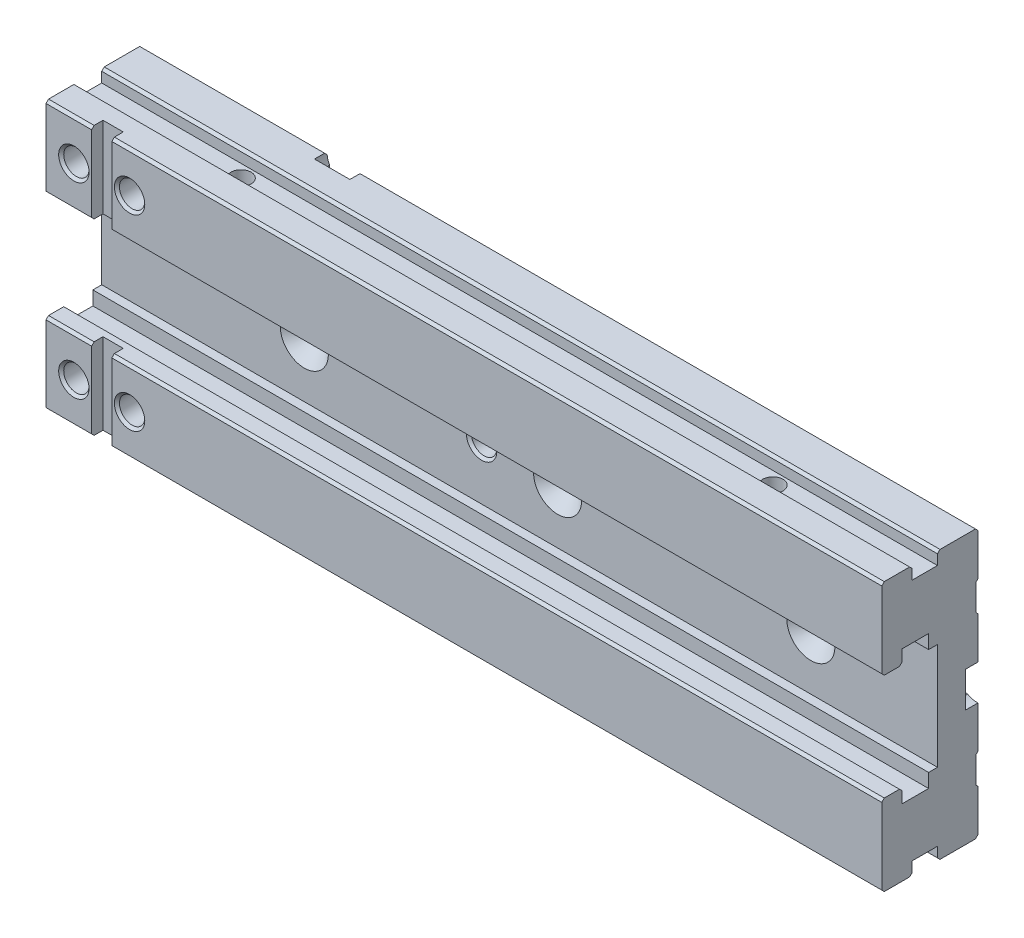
ISO-10303-21;
HEADER;
FILE_DESCRIPTION(('STEP AP214'),'2;1');
FILE_NAME('part.step','',(''),(''),'','','');
FILE_SCHEMA(('AUTOMOTIVE_DESIGN { 1 0 10303 214 1 1 1 1 }'));
ENDSEC;
DATA;
#1=APPLICATION_CONTEXT('core data for automotive mechanical design processes');
#2=APPLICATION_PROTOCOL_DEFINITION('international standard','automotive_design',2000,#1);
#3=PRODUCT_CONTEXT('',#1,'mechanical');
#4=PRODUCT('Part','Part','',(#3));
#5=PRODUCT_RELATED_PRODUCT_CATEGORY('part','',(#4));
#6=PRODUCT_DEFINITION_FORMATION('','',#4);
#7=PRODUCT_DEFINITION_CONTEXT('part definition',#1,'design');
#8=PRODUCT_DEFINITION('design','',#6,#7);
#9=PRODUCT_DEFINITION_SHAPE('','',#8);
#10=(LENGTH_UNIT() NAMED_UNIT(*) SI_UNIT(.MILLI.,.METRE.));
#11=(NAMED_UNIT(*) PLANE_ANGLE_UNIT() SI_UNIT($,.RADIAN.));
#12=(NAMED_UNIT(*) SI_UNIT($,.STERADIAN.) SOLID_ANGLE_UNIT());
#13=UNCERTAINTY_MEASURE_WITH_UNIT(LENGTH_MEASURE(1.E-05),#10,'distance_accuracy_value','');
#14=(GEOMETRIC_REPRESENTATION_CONTEXT(3) GLOBAL_UNCERTAINTY_ASSIGNED_CONTEXT((#13)) GLOBAL_UNIT_ASSIGNED_CONTEXT((#10,
#11,#12)) REPRESENTATION_CONTEXT('',''));
#15=CARTESIAN_POINT('',(0.,0.,0.));
#16=DIRECTION('',(0.,0.,1.));
#17=DIRECTION('',(1.,0.,0.));
#18=AXIS2_PLACEMENT_3D('',#15,#16,#17);
#19=CARTESIAN_POINT('',(-80.,-48.,16.));
#20=DIRECTION('',(0.,-1.,0.));
#21=DIRECTION('',(1.,0.,0.));
#22=AXIS2_PLACEMENT_3D('',#19,#20,#21);
#23=PLANE('',#22);
#24=CARTESIAN_POINT('',(190.,-48.,21.));
#25=DIRECTION('',(0.,1.,0.));
#26=DIRECTION('',(-1.,0.,0.));
#27=AXIS2_PLACEMENT_3D('',#24,#25,#26);
#28=CIRCLE('',#27,4.);
#29=CARTESIAN_POINT('',(186.,-48.,21.));
#30=VERTEX_POINT('',#29);
#31=EDGE_CURVE('E2061',#30,#30,#28,.T.);
#32=ORIENTED_EDGE('',*,*,#31,.T.);
#33=EDGE_LOOP('',(#32));
#34=FACE_BOUND('',#33,.T.);
#35=DIRECTION('',(0.,0.,1.));
#36=VECTOR('',#35,1.);
#37=CARTESIAN_POINT('',(-80.,-48.,26.));
#38=LINE('',#37,#36);
#39=CARTESIAN_POINT('',(-80.,-48.,26.));
#40=VERTEX_POINT('',#39);
#41=CARTESIAN_POINT('',(-80.,-48.,16.));
#42=VERTEX_POINT('',#41);
#43=EDGE_CURVE('E1575',#40,#42,#38,.F.);
#44=ORIENTED_EDGE('',*,*,#43,.T.);
#45=DIRECTION('',(1.,0.,0.));
#46=VECTOR('',#45,1.);
#47=CARTESIAN_POINT('',(-80.,-48.,16.));
#48=LINE('',#47,#46);
#49=CARTESIAN_POINT('',(250.,-48.,16.));
#50=VERTEX_POINT('',#49);
#51=EDGE_CURVE('E880',#50,#42,#48,.F.);
#52=ORIENTED_EDGE('',*,*,#51,.F.);
#53=DIRECTION('',(0.,0.,1.));
#54=VECTOR('',#53,1.);
#55=CARTESIAN_POINT('',(250.,-48.,26.));
#56=LINE('',#55,#54);
#57=CARTESIAN_POINT('',(250.,-48.,26.));
#58=VERTEX_POINT('',#57);
#59=EDGE_CURVE('E1710',#58,#50,#56,.F.);
#60=ORIENTED_EDGE('',*,*,#59,.F.);
#61=DIRECTION('',(1.,0.,0.));
#62=VECTOR('',#61,1.);
#63=CARTESIAN_POINT('',(-80.,-48.,26.));
#64=LINE('',#63,#62);
#65=EDGE_CURVE('E887',#58,#40,#64,.F.);
#66=ORIENTED_EDGE('',*,*,#65,.T.);
#67=EDGE_LOOP('',(#44,#52,#60,#66));
#68=FACE_BOUND('',#67,.T.);
#69=CARTESIAN_POINT('',(-20.,-48.,21.));
#70=DIRECTION('',(0.,1.,0.));
#71=DIRECTION('',(-1.,0.,0.));
#72=AXIS2_PLACEMENT_3D('',#69,#70,#71);
#73=CIRCLE('',#72,4.);
#74=CARTESIAN_POINT('',(-24.,-48.,21.));
#75=VERTEX_POINT('',#74);
#76=EDGE_CURVE('E2056',#75,#75,#73,.T.);
#77=ORIENTED_EDGE('',*,*,#76,.T.);
#78=EDGE_LOOP('',(#77));
#79=FACE_BOUND('',#78,.T.);
#80=ADVANCED_FACE('F14',(#34,#68,#79),#23,.T.);
#81=CARTESIAN_POINT('',(2.7,-49.5,4.5));
#82=DIRECTION('',(-1.,0.,0.));
#83=DIRECTION('',(0.,-1.,0.));
#84=AXIS2_PLACEMENT_3D('',#81,#82,#83);
#85=PLANE('',#84);
#86=DIRECTION('',(0.,-1.,0.));
#87=VECTOR('',#86,1.);
#88=CARTESIAN_POINT('',(2.7,-49.5,4.));
#89=LINE('',#88,#87);
#90=CARTESIAN_POINT('',(2.7,-28.9583279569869,4.));
#91=VERTEX_POINT('',#90);
#92=CARTESIAN_POINT('',(2.7,-46.041672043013,4.));
#93=VERTEX_POINT('',#92);
#94=EDGE_CURVE('E698',#91,#93,#89,.T.);
#95=ORIENTED_EDGE('',*,*,#94,.T.);
#96=DIRECTION('',(0.,0.,-1.));
#97=VECTOR('',#96,1.);
#98=CARTESIAN_POINT('',(2.7,-46.041672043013,5.00000000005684));
#99=LINE('',#98,#97);
#100=CARTESIAN_POINT('',(2.7,-46.041672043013,4.5));
#101=VERTEX_POINT('',#100);
#102=EDGE_CURVE('E486',#93,#101,#99,.F.);
#103=ORIENTED_EDGE('',*,*,#102,.T.);
#104=DIRECTION('',(0.,-1.,0.));
#105=VECTOR('',#104,1.);
#106=CARTESIAN_POINT('',(2.7,-49.5,4.5));
#107=LINE('',#106,#105);
#108=CARTESIAN_POINT('',(2.7,-28.9583279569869,4.5));
#109=VERTEX_POINT('',#108);
#110=EDGE_CURVE('E1126',#101,#109,#107,.F.);
#111=ORIENTED_EDGE('',*,*,#110,.T.);
#112=DIRECTION('',(0.,0.,1.));
#113=VECTOR('',#112,1.);
#114=CARTESIAN_POINT('',(2.7,-28.9583279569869,4.5));
#115=LINE('',#114,#113);
#116=EDGE_CURVE('E495',#109,#91,#115,.F.);
#117=ORIENTED_EDGE('',*,*,#116,.T.);
#118=EDGE_LOOP('',(#95,#103,#111,#117));
#119=FACE_BOUND('',#118,.T.);
#120=ADVANCED_FACE('F16',(#119),#85,.T.);
#121=CARTESIAN_POINT('',(-2.7,-49.5,4.5));
#122=DIRECTION('',(1.,0.,0.));
#123=DIRECTION('',(0.,1.,0.));
#124=AXIS2_PLACEMENT_3D('',#121,#122,#123);
#125=PLANE('',#124);
#126=DIRECTION('',(0.,-1.,0.));
#127=VECTOR('',#126,1.);
#128=CARTESIAN_POINT('',(-2.7,-49.5,4.5));
#129=LINE('',#128,#127);
#130=CARTESIAN_POINT('',(-2.7,-28.958327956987,4.5));
#131=VERTEX_POINT('',#130);
#132=CARTESIAN_POINT('',(-2.7,-46.041672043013,4.5));
#133=VERTEX_POINT('',#132);
#134=EDGE_CURVE('E691',#131,#133,#129,.T.);
#135=ORIENTED_EDGE('',*,*,#134,.T.);
#136=DIRECTION('',(0.,0.,-1.));
#137=VECTOR('',#136,1.);
#138=CARTESIAN_POINT('',(-2.7,-46.041672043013,5.00000000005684));
#139=LINE('',#138,#137);
#140=CARTESIAN_POINT('',(-2.7,-46.041672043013,4.));
#141=VERTEX_POINT('',#140);
#142=EDGE_CURVE('E490',#133,#141,#139,.T.);
#143=ORIENTED_EDGE('',*,*,#142,.T.);
#144=DIRECTION('',(0.,-1.,0.));
#145=VECTOR('',#144,1.);
#146=CARTESIAN_POINT('',(-2.7,-49.5,4.));
#147=LINE('',#146,#145);
#148=CARTESIAN_POINT('',(-2.7,-28.958327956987,4.));
#149=VERTEX_POINT('',#148);
#150=EDGE_CURVE('E695',#141,#149,#147,.F.);
#151=ORIENTED_EDGE('',*,*,#150,.T.);
#152=DIRECTION('',(0.,0.,1.));
#153=VECTOR('',#152,1.);
#154=CARTESIAN_POINT('',(-2.7,-28.958327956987,4.5));
#155=LINE('',#154,#153);
#156=EDGE_CURVE('E485',#149,#131,#155,.T.);
#157=ORIENTED_EDGE('',*,*,#156,.T.);
#158=EDGE_LOOP('',(#135,#143,#151,#157));
#159=FACE_BOUND('',#158,.T.);
#160=ADVANCED_FACE('F1851',(#159),#125,.T.);
#161=CARTESIAN_POINT('',(-52.5,-2.7,4.5));
#162=DIRECTION('',(0.,-1.,0.));
#163=DIRECTION('',(1.,0.,0.));
#164=AXIS2_PLACEMENT_3D('',#161,#162,#163);
#165=PLANE('',#164);
#166=DIRECTION('',(0.,0.,1.));
#167=VECTOR('',#166,1.);
#168=CARTESIAN_POINT('',(-73.041672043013,-2.69999999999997,4.5));
#169=LINE('',#168,#167);
#170=CARTESIAN_POINT('',(-73.041672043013,-2.69999999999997,4.5));
#171=VERTEX_POINT('',#170);
#172=CARTESIAN_POINT('',(-73.041672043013,-2.7,4.));
#173=VERTEX_POINT('',#172);
#174=EDGE_CURVE('E480',#171,#173,#169,.F.);
#175=ORIENTED_EDGE('',*,*,#174,.F.);
#176=DIRECTION('',(1.,0.,0.));
#177=VECTOR('',#176,1.);
#178=CARTESIAN_POINT('',(-52.5,-2.69999999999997,4.5));
#179=LINE('',#178,#177);
#180=CARTESIAN_POINT('',(-55.958327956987,-2.7,4.5));
#181=VERTEX_POINT('',#180);
#182=EDGE_CURVE('E1113',#171,#181,#179,.T.);
#183=ORIENTED_EDGE('',*,*,#182,.T.);
#184=DIRECTION('',(0.,0.,1.));
#185=VECTOR('',#184,1.);
#186=CARTESIAN_POINT('',(-55.958327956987,-2.7,4.5));
#187=LINE('',#186,#185);
#188=CARTESIAN_POINT('',(-55.958327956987,-2.7,4.));
#189=VERTEX_POINT('',#188);
#190=EDGE_CURVE('E482',#189,#181,#187,.T.);
#191=ORIENTED_EDGE('',*,*,#190,.F.);
#192=DIRECTION('',(1.,0.,0.));
#193=VECTOR('',#192,1.);
#194=CARTESIAN_POINT('',(-52.5,-2.7,4.));
#195=LINE('',#194,#193);
#196=EDGE_CURVE('E690',#189,#173,#195,.F.);
#197=ORIENTED_EDGE('',*,*,#196,.T.);
#198=EDGE_LOOP('',(#175,#183,#191,#197));
#199=FACE_BOUND('',#198,.T.);
#200=ADVANCED_FACE('F2380',(#199),#165,.F.);
#201=CARTESIAN_POINT('',(-52.5,2.7,4.5));
#202=DIRECTION('',(0.,1.,0.));
#203=DIRECTION('',(-1.,0.,0.));
#204=AXIS2_PLACEMENT_3D('',#201,#202,#203);
#205=PLANE('',#204);
#206=DIRECTION('',(0.,0.,1.));
#207=VECTOR('',#206,1.);
#208=CARTESIAN_POINT('',(-73.041672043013,2.70000000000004,4.5));
#209=LINE('',#208,#207);
#210=CARTESIAN_POINT('',(-73.041672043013,2.70000000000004,4.));
#211=VERTEX_POINT('',#210);
#212=CARTESIAN_POINT('',(-73.041672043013,2.7,4.5));
#213=VERTEX_POINT('',#212);
#214=EDGE_CURVE('E444',#211,#213,#209,.T.);
#215=ORIENTED_EDGE('',*,*,#214,.F.);
#216=DIRECTION('',(1.,0.,0.));
#217=VECTOR('',#216,1.);
#218=CARTESIAN_POINT('',(-52.5,2.70000000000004,4.));
#219=LINE('',#218,#217);
#220=CARTESIAN_POINT('',(-55.958327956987,2.7,4.));
#221=VERTEX_POINT('',#220);
#222=EDGE_CURVE('E439',#211,#221,#219,.T.);
#223=ORIENTED_EDGE('',*,*,#222,.T.);
#224=DIRECTION('',(0.,0.,1.));
#225=VECTOR('',#224,1.);
#226=CARTESIAN_POINT('',(-55.958327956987,2.7,4.5));
#227=LINE('',#226,#225);
#228=CARTESIAN_POINT('',(-55.958327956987,2.7,4.5));
#229=VERTEX_POINT('',#228);
#230=EDGE_CURVE('E478',#229,#221,#227,.F.);
#231=ORIENTED_EDGE('',*,*,#230,.F.);
#232=DIRECTION('',(1.,0.,0.));
#233=VECTOR('',#232,1.);
#234=CARTESIAN_POINT('',(-52.5,2.7,4.5));
#235=LINE('',#234,#233);
#236=EDGE_CURVE('E1116',#229,#213,#235,.F.);
#237=ORIENTED_EDGE('',*,*,#236,.T.);
#238=EDGE_LOOP('',(#215,#223,#231,#237));
#239=FACE_BOUND('',#238,.T.);
#240=ADVANCED_FACE('F2376',(#239),#205,.F.);
#241=CARTESIAN_POINT('',(-69.,37.,37.999999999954));
#242=DIRECTION('',(0.,0.,1.));
#243=DIRECTION('',(1.,0.,0.));
#244=AXIS2_PLACEMENT_3D('',#241,#242,#243);
#245=CONICAL_SURFACE('',#244,5.99999999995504,0.785398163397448);
#246=CARTESIAN_POINT('',(-69.,37.,36.999999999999));
#247=DIRECTION('',(0.,0.,1.));
#248=DIRECTION('',(1.,0.,0.));
#249=AXIS2_PLACEMENT_3D('',#246,#247,#248);
#250=CIRCLE('',#249,5.);
#251=CARTESIAN_POINT('',(-64.,37.,36.999999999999));
#252=VERTEX_POINT('',#251);
#253=EDGE_CURVE('E2052',#252,#252,#250,.F.);
#254=ORIENTED_EDGE('',*,*,#253,.T.);
#255=EDGE_LOOP('',(#254));
#256=FACE_BOUND('',#255,.T.);
#257=CARTESIAN_POINT('',(-69.,37.,37.999999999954));
#258=DIRECTION('',(0.,0.,1.));
#259=DIRECTION('',(1.,0.,0.));
#260=AXIS2_PLACEMENT_3D('',#257,#258,#259);
#261=CIRCLE('',#260,5.99999999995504);
#262=CARTESIAN_POINT('',(-63.000000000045,37.,37.999999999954));
#263=VERTEX_POINT('',#262);
#264=EDGE_CURVE('E680',#263,#263,#261,.F.);
#265=ORIENTED_EDGE('',*,*,#264,.F.);
#266=EDGE_LOOP('',(#265));
#267=FACE_BOUND('',#266,.T.);
#268=ADVANCED_FACE('F2372',(#256,#267),#245,.F.);
#269=CARTESIAN_POINT('',(-69.,-37.,37.999999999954));
#270=DIRECTION('',(0.,0.,1.));
#271=DIRECTION('',(1.,0.,0.));
#272=AXIS2_PLACEMENT_3D('',#269,#270,#271);
#273=CONICAL_SURFACE('',#272,5.99999999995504,0.785398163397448);
#274=CARTESIAN_POINT('',(-69.,-37.,36.999999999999));
#275=DIRECTION('',(0.,0.,1.));
#276=DIRECTION('',(1.,0.,0.));
#277=AXIS2_PLACEMENT_3D('',#274,#275,#276);
#278=CIRCLE('',#277,5.);
#279=CARTESIAN_POINT('',(-64.,-37.,36.999999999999));
#280=VERTEX_POINT('',#279);
#281=EDGE_CURVE('E2044',#280,#280,#278,.F.);
#282=ORIENTED_EDGE('',*,*,#281,.T.);
#283=EDGE_LOOP('',(#282));
#284=FACE_BOUND('',#283,.T.);
#285=CARTESIAN_POINT('',(-69.,-37.,37.999999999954));
#286=DIRECTION('',(0.,0.,1.));
#287=DIRECTION('',(1.,0.,0.));
#288=AXIS2_PLACEMENT_3D('',#285,#286,#287);
#289=CIRCLE('',#288,5.99999999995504);
#290=CARTESIAN_POINT('',(-63.000000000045,-37.,37.999999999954));
#291=VERTEX_POINT('',#290);
#292=EDGE_CURVE('E675',#291,#291,#289,.F.);
#293=ORIENTED_EDGE('',*,*,#292,.F.);
#294=EDGE_LOOP('',(#293));
#295=FACE_BOUND('',#294,.T.);
#296=ADVANCED_FACE('F2369',(#284,#295),#273,.F.);
#297=CARTESIAN_POINT('',(-80.,-35.5,0.));
#298=DIRECTION('',(0.,0.707106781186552,-0.707106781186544));
#299=DIRECTION('',(0.,0.707106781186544,0.707106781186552));
#300=AXIS2_PLACEMENT_3D('',#297,#298,#299);
#301=PLANE('',#300);
#302=DIRECTION('',(0.,0.707106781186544,0.707106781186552));
#303=VECTOR('',#302,1.);
#304=CARTESIAN_POINT('',(-80.,-35.5,0.));
#305=LINE('',#304,#303);
#306=CARTESIAN_POINT('',(-80.,-35.5,0.));
#307=VERTEX_POINT('',#306);
#308=CARTESIAN_POINT('',(-80.,-34.8,0.7));
#309=VERTEX_POINT('',#308);
#310=EDGE_CURVE('E418',#307,#309,#305,.T.);
#311=ORIENTED_EDGE('',*,*,#310,.T.);
#312=DIRECTION('',(1.,0.,0.));
#313=VECTOR('',#312,1.);
#314=CARTESIAN_POINT('',(-80.,-34.8,0.7));
#315=LINE('',#314,#313);
#316=CARTESIAN_POINT('',(-6.,-34.8,0.7));
#317=VERTEX_POINT('',#316);
#318=EDGE_CURVE('E1060',#317,#309,#315,.F.);
#319=ORIENTED_EDGE('',*,*,#318,.F.);
#320=DIRECTION('',(0.,0.707106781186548,0.707106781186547));
#321=VECTOR('',#320,1.);
#322=CARTESIAN_POINT('',(-6.,-35.5,0.));
#323=LINE('',#322,#321);
#324=CARTESIAN_POINT('',(-6.,-35.5,0.));
#325=VERTEX_POINT('',#324);
#326=EDGE_CURVE('E447',#325,#317,#323,.T.);
#327=ORIENTED_EDGE('',*,*,#326,.F.);
#328=DIRECTION('',(1.,0.,0.));
#329=VECTOR('',#328,1.);
#330=CARTESIAN_POINT('',(-80.,-35.5,0.));
#331=LINE('',#330,#329);
#332=EDGE_CURVE('E463',#307,#325,#331,.T.);
#333=ORIENTED_EDGE('',*,*,#332,.F.);
#334=EDGE_LOOP('',(#311,#319,#327,#333));
#335=FACE_BOUND('',#334,.T.);
#336=ADVANCED_FACE('F1550',(#335),#301,.T.);
#337=CARTESIAN_POINT('',(-80.,34.8,0.7));
#338=DIRECTION('',(0.,-0.707106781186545,-0.70710678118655));
#339=DIRECTION('',(0.,0.70710678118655,-0.707106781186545));
#340=AXIS2_PLACEMENT_3D('',#337,#338,#339);
#341=PLANE('',#340);
#342=DIRECTION('',(1.,0.,0.));
#343=VECTOR('',#342,1.);
#344=CARTESIAN_POINT('',(-80.,34.8,0.7));
#345=LINE('',#344,#343);
#346=CARTESIAN_POINT('',(-80.,34.8,0.7));
#347=VERTEX_POINT('',#346);
#348=CARTESIAN_POINT('',(-6.,34.8,0.7));
#349=VERTEX_POINT('',#348);
#350=EDGE_CURVE('E381',#347,#349,#345,.T.);
#351=ORIENTED_EDGE('',*,*,#350,.F.);
#352=DIRECTION('',(0.,0.70710678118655,-0.707106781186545));
#353=VECTOR('',#352,1.);
#354=CARTESIAN_POINT('',(-80.,34.8,0.7));
#355=LINE('',#354,#353);
#356=CARTESIAN_POINT('',(-80.,35.5,0.));
#357=VERTEX_POINT('',#356);
#358=EDGE_CURVE('E412',#347,#357,#355,.T.);
#359=ORIENTED_EDGE('',*,*,#358,.T.);
#360=DIRECTION('',(1.,0.,0.));
#361=VECTOR('',#360,1.);
#362=CARTESIAN_POINT('',(-80.,35.5,0.));
#363=LINE('',#362,#361);
#364=CARTESIAN_POINT('',(-6.,35.5,0.));
#365=VERTEX_POINT('',#364);
#366=EDGE_CURVE('E435',#365,#357,#363,.F.);
#367=ORIENTED_EDGE('',*,*,#366,.F.);
#368=DIRECTION('',(0.,-0.707106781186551,0.707106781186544));
#369=VECTOR('',#368,1.);
#370=CARTESIAN_POINT('',(-6.,35.5,0.));
#371=LINE('',#370,#369);
#372=EDGE_CURVE('E421',#365,#349,#371,.T.);
#373=ORIENTED_EDGE('',*,*,#372,.T.);
#374=EDGE_LOOP('',(#351,#359,#367,#373));
#375=FACE_BOUND('',#374,.T.);
#376=ADVANCED_FACE('F2362',(#375),#341,.T.);
#377=CARTESIAN_POINT('',(-2.7,49.5,4.5));
#378=DIRECTION('',(-1.,0.,0.));
#379=DIRECTION('',(0.,-1.,0.));
#380=AXIS2_PLACEMENT_3D('',#377,#378,#379);
#381=PLANE('',#380);
#382=DIRECTION('',(0.,0.,1.));
#383=VECTOR('',#382,1.);
#384=CARTESIAN_POINT('',(-2.7,28.958327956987,4.5));
#385=LINE('',#384,#383);
#386=CARTESIAN_POINT('',(-2.7,28.958327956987,4.));
#387=VERTEX_POINT('',#386);
#388=CARTESIAN_POINT('',(-2.7,28.958327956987,4.5));
#389=VERTEX_POINT('',#388);
#390=EDGE_CURVE('E409',#387,#389,#385,.T.);
#391=ORIENTED_EDGE('',*,*,#390,.F.);
#392=DIRECTION('',(0.,-1.,0.));
#393=VECTOR('',#392,1.);
#394=CARTESIAN_POINT('',(-2.7,49.5,4.));
#395=LINE('',#394,#393);
#396=CARTESIAN_POINT('',(-2.7,46.041672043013,4.));
#397=VERTEX_POINT('',#396);
#398=EDGE_CURVE('E670',#387,#397,#395,.F.);
#399=ORIENTED_EDGE('',*,*,#398,.T.);
#400=DIRECTION('',(0.,0.,-1.));
#401=VECTOR('',#400,1.);
#402=CARTESIAN_POINT('',(-2.7,46.041672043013,5.00000000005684));
#403=LINE('',#402,#401);
#404=CARTESIAN_POINT('',(-2.7,46.041672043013,4.5));
#405=VERTEX_POINT('',#404);
#406=EDGE_CURVE('E342',#397,#405,#403,.F.);
#407=ORIENTED_EDGE('',*,*,#406,.T.);
#408=DIRECTION('',(0.,-1.,0.));
#409=VECTOR('',#408,1.);
#410=CARTESIAN_POINT('',(-2.7,49.5,4.5));
#411=LINE('',#410,#409);
#412=EDGE_CURVE('E664',#405,#389,#411,.T.);
#413=ORIENTED_EDGE('',*,*,#412,.T.);
#414=EDGE_LOOP('',(#391,#399,#407,#413));
#415=FACE_BOUND('',#414,.T.);
#416=ADVANCED_FACE('F2358',(#415),#381,.F.);
#417=CARTESIAN_POINT('',(2.7,49.5,4.5));
#418=DIRECTION('',(1.,0.,0.));
#419=DIRECTION('',(0.,1.,0.));
#420=AXIS2_PLACEMENT_3D('',#417,#418,#419);
#421=PLANE('',#420);
#422=DIRECTION('',(0.,0.,1.));
#423=VECTOR('',#422,1.);
#424=CARTESIAN_POINT('',(2.7,28.9583279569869,4.5));
#425=LINE('',#424,#423);
#426=CARTESIAN_POINT('',(2.7,28.9583279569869,4.5));
#427=VERTEX_POINT('',#426);
#428=CARTESIAN_POINT('',(2.7,28.9583279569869,4.));
#429=VERTEX_POINT('',#428);
#430=EDGE_CURVE('E405',#427,#429,#425,.F.);
#431=ORIENTED_EDGE('',*,*,#430,.F.);
#432=DIRECTION('',(0.,-1.,0.));
#433=VECTOR('',#432,1.);
#434=CARTESIAN_POINT('',(2.7,49.5,4.5));
#435=LINE('',#434,#433);
#436=CARTESIAN_POINT('',(2.7,46.041672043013,4.5));
#437=VERTEX_POINT('',#436);
#438=EDGE_CURVE('E1041',#427,#437,#435,.F.);
#439=ORIENTED_EDGE('',*,*,#438,.T.);
#440=DIRECTION('',(0.,0.,-1.));
#441=VECTOR('',#440,1.);
#442=CARTESIAN_POINT('',(2.7,46.041672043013,5.00000000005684));
#443=LINE('',#442,#441);
#444=CARTESIAN_POINT('',(2.7,46.041672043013,4.));
#445=VERTEX_POINT('',#444);
#446=EDGE_CURVE('E343',#437,#445,#443,.T.);
#447=ORIENTED_EDGE('',*,*,#446,.T.);
#448=DIRECTION('',(0.,-1.,0.));
#449=VECTOR('',#448,1.);
#450=CARTESIAN_POINT('',(2.7,49.5,4.));
#451=LINE('',#450,#449);
#452=EDGE_CURVE('E665',#445,#429,#451,.T.);
#453=ORIENTED_EDGE('',*,*,#452,.T.);
#454=EDGE_LOOP('',(#431,#439,#447,#453));
#455=FACE_BOUND('',#454,.T.);
#456=ADVANCED_FACE('F2355',(#455),#421,.F.);
#457=CARTESIAN_POINT('',(246.5,2.7,4.5));
#458=DIRECTION('',(0.,1.,0.));
#459=DIRECTION('',(-1.,0.,0.));
#460=AXIS2_PLACEMENT_3D('',#457,#458,#459);
#461=PLANE('',#460);
#462=DIRECTION('',(0.,0.,1.));
#463=VECTOR('',#462,1.);
#464=CARTESIAN_POINT('',(225.958327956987,2.7,4.5));
#465=LINE('',#464,#463);
#466=CARTESIAN_POINT('',(225.958327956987,2.7,4.));
#467=VERTEX_POINT('',#466);
#468=CARTESIAN_POINT('',(225.958327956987,2.7,4.5));
#469=VERTEX_POINT('',#468);
#470=EDGE_CURVE('E401',#467,#469,#465,.T.);
#471=ORIENTED_EDGE('',*,*,#470,.F.);
#472=DIRECTION('',(1.,0.,0.));
#473=VECTOR('',#472,1.);
#474=CARTESIAN_POINT('',(246.5,2.7,4.));
#475=LINE('',#474,#473);
#476=CARTESIAN_POINT('',(243.041672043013,2.7,4.));
#477=VERTEX_POINT('',#476);
#478=EDGE_CURVE('E1036',#467,#477,#475,.T.);
#479=ORIENTED_EDGE('',*,*,#478,.T.);
#480=DIRECTION('',(0.,0.,1.));
#481=VECTOR('',#480,1.);
#482=CARTESIAN_POINT('',(243.041672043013,2.7,4.5));
#483=LINE('',#482,#481);
#484=CARTESIAN_POINT('',(243.041672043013,2.7,4.5));
#485=VERTEX_POINT('',#484);
#486=EDGE_CURVE('E403',#485,#477,#483,.F.);
#487=ORIENTED_EDGE('',*,*,#486,.F.);
#488=DIRECTION('',(1.,0.,0.));
#489=VECTOR('',#488,1.);
#490=CARTESIAN_POINT('',(246.5,2.7,4.5));
#491=LINE('',#490,#489);
#492=EDGE_CURVE('E1033',#485,#469,#491,.F.);
#493=ORIENTED_EDGE('',*,*,#492,.T.);
#494=EDGE_LOOP('',(#471,#479,#487,#493));
#495=FACE_BOUND('',#494,.T.);
#496=ADVANCED_FACE('F1825',(#495),#461,.F.);
#497=CARTESIAN_POINT('',(246.5,-2.7,4.5));
#498=DIRECTION('',(0.,-1.,0.));
#499=DIRECTION('',(1.,0.,0.));
#500=AXIS2_PLACEMENT_3D('',#497,#498,#499);
#501=PLANE('',#500);
#502=DIRECTION('',(0.,0.,1.));
#503=VECTOR('',#502,1.);
#504=CARTESIAN_POINT('',(225.958327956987,-2.7,4.5));
#505=LINE('',#504,#503);
#506=CARTESIAN_POINT('',(225.958327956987,-2.7,4.5));
#507=VERTEX_POINT('',#506);
#508=CARTESIAN_POINT('',(225.958327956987,-2.7,4.));
#509=VERTEX_POINT('',#508);
#510=EDGE_CURVE('E370',#507,#509,#505,.F.);
#511=ORIENTED_EDGE('',*,*,#510,.F.);
#512=DIRECTION('',(1.,0.,0.));
#513=VECTOR('',#512,1.);
#514=CARTESIAN_POINT('',(246.5,-2.7,4.5));
#515=LINE('',#514,#513);
#516=CARTESIAN_POINT('',(243.041672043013,-2.7,4.5));
#517=VERTEX_POINT('',#516);
#518=EDGE_CURVE('E1030',#507,#517,#515,.T.);
#519=ORIENTED_EDGE('',*,*,#518,.T.);
#520=DIRECTION('',(0.,0.,1.));
#521=VECTOR('',#520,1.);
#522=CARTESIAN_POINT('',(243.041672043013,-2.7,4.5));
#523=LINE('',#522,#521);
#524=CARTESIAN_POINT('',(243.041672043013,-2.7,4.));
#525=VERTEX_POINT('',#524);
#526=EDGE_CURVE('E399',#525,#517,#523,.T.);
#527=ORIENTED_EDGE('',*,*,#526,.F.);
#528=DIRECTION('',(1.,0.,0.));
#529=VECTOR('',#528,1.);
#530=CARTESIAN_POINT('',(246.5,-2.7,4.));
#531=LINE('',#530,#529);
#532=EDGE_CURVE('E1015',#525,#509,#531,.F.);
#533=ORIENTED_EDGE('',*,*,#532,.T.);
#534=EDGE_LOOP('',(#511,#519,#527,#533));
#535=FACE_BOUND('',#534,.T.);
#536=ADVANCED_FACE('F1817',(#535),#501,.F.);
#537=CARTESIAN_POINT('',(-80.,34.8,0.7));
#538=DIRECTION('',(0.,-0.707106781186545,-0.70710678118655));
#539=DIRECTION('',(0.,0.70710678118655,-0.707106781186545));
#540=AXIS2_PLACEMENT_3D('',#537,#538,#539);
#541=PLANE('',#540);
#542=DIRECTION('',(1.,0.,0.));
#543=VECTOR('',#542,1.);
#544=CARTESIAN_POINT('',(-80.,35.5,0.));
#545=LINE('',#544,#543);
#546=CARTESIAN_POINT('',(250.,35.5,0.));
#547=VERTEX_POINT('',#546);
#548=CARTESIAN_POINT('',(6.,35.5,0.));
#549=VERTEX_POINT('',#548);
#550=EDGE_CURVE('E361',#547,#549,#545,.F.);
#551=ORIENTED_EDGE('',*,*,#550,.F.);
#552=DIRECTION('',(0.,0.70710678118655,-0.707106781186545));
#553=VECTOR('',#552,1.);
#554=CARTESIAN_POINT('',(250.,34.8,0.7));
#555=LINE('',#554,#553);
#556=CARTESIAN_POINT('',(250.,34.8,0.7));
#557=VERTEX_POINT('',#556);
#558=EDGE_CURVE('E367',#547,#557,#555,.F.);
#559=ORIENTED_EDGE('',*,*,#558,.T.);
#560=DIRECTION('',(1.,0.,0.));
#561=VECTOR('',#560,1.);
#562=CARTESIAN_POINT('',(-80.,34.8,0.7));
#563=LINE('',#562,#561);
#564=CARTESIAN_POINT('',(6.,34.8,0.7));
#565=VERTEX_POINT('',#564);
#566=EDGE_CURVE('E392',#565,#557,#563,.T.);
#567=ORIENTED_EDGE('',*,*,#566,.F.);
#568=DIRECTION('',(0.,0.707106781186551,-0.707106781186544));
#569=VECTOR('',#568,1.);
#570=CARTESIAN_POINT('',(6.,34.8,0.7));
#571=LINE('',#570,#569);
#572=EDGE_CURVE('E380',#565,#549,#571,.T.);
#573=ORIENTED_EDGE('',*,*,#572,.T.);
#574=EDGE_LOOP('',(#551,#559,#567,#573));
#575=FACE_BOUND('',#574,.T.);
#576=ADVANCED_FACE('F2347',(#575),#541,.T.);
#577=CARTESIAN_POINT('',(0.,52.5,5.00000000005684));
#578=DIRECTION('',(0.,0.,-1.));
#579=DIRECTION('',(0.,1.,0.));
#580=AXIS2_PLACEMENT_3D('',#577,#578,#579);
#581=PLANE('',#580);
#582=CARTESIAN_POINT('',(0.,52.5,5.00000000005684));
#583=DIRECTION('',(0.,0.,-1.));
#584=DIRECTION('',(0.,1.,0.));
#585=AXIS2_PLACEMENT_3D('',#582,#583,#584);
#586=CIRCLE('',#585,7.);
#587=CARTESIAN_POINT('',(6.9821200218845,53.,5.00000000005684));
#588=VERTEX_POINT('',#587);
#589=CARTESIAN_POINT('',(-6.98212002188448,53.,5.00000000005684));
#590=VERTEX_POINT('',#589);
#591=EDGE_CURVE('E335',#588,#590,#586,.T.);
#592=ORIENTED_EDGE('',*,*,#591,.T.);
#593=DIRECTION('',(-1.,0.,0.));
#594=VECTOR('',#593,1.);
#595=CARTESIAN_POINT('',(-80.,53.,5.00000000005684));
#596=LINE('',#595,#594);
#597=EDGE_CURVE('E339',#588,#590,#596,.T.);
#598=ORIENTED_EDGE('',*,*,#597,.F.);
#599=EDGE_LOOP('',(#592,#598));
#600=FACE_BOUND('',#599,.T.);
#601=ADVANCED_FACE('F337',(#600),#581,.T.);
#602=CARTESIAN_POINT('',(0.,52.5,5.00000000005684));
#603=DIRECTION('',(0.,0.,-1.));
#604=DIRECTION('',(0.,1.,0.));
#605=AXIS2_PLACEMENT_3D('',#602,#603,#604);
#606=CYLINDRICAL_SURFACE('',#605,7.);
#607=ORIENTED_EDGE('',*,*,#406,.F.);
#608=CARTESIAN_POINT('',(0.,52.5,4.));
#609=DIRECTION('',(0.,0.,-1.));
#610=DIRECTION('',(0.,1.,0.));
#611=AXIS2_PLACEMENT_3D('',#608,#609,#610);
#612=CIRCLE('',#611,7.);
#613=CARTESIAN_POINT('',(-6.,48.894448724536,4.));
#614=VERTEX_POINT('',#613);
#615=EDGE_CURVE('E430',#397,#614,#612,.T.);
#616=ORIENTED_EDGE('',*,*,#615,.T.);
#617=DIRECTION('',(0.,0.,1.));
#618=VECTOR('',#617,1.);
#619=CARTESIAN_POINT('',(-6.,48.894448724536,4.));
#620=LINE('',#619,#618);
#621=CARTESIAN_POINT('',(-6.,48.894448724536,2.8422143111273E-11));
#622=VERTEX_POINT('',#621);
#623=EDGE_CURVE('E428',#614,#622,#620,.F.);
#624=ORIENTED_EDGE('',*,*,#623,.T.);
#625=CARTESIAN_POINT('',(0.,52.5,5.6843418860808E-11));
#626=DIRECTION('',(0.,0.,-1.));
#627=DIRECTION('',(0.,1.,0.));
#628=AXIS2_PLACEMENT_3D('',#625,#626,#627);
#629=CIRCLE('',#628,7.);
#630=CARTESIAN_POINT('',(-6.98212002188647,52.0000000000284,2.84216031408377E-11));
#631=VERTEX_POINT('',#630);
#632=EDGE_CURVE('E684',#631,#622,#629,.F.);
#633=ORIENTED_EDGE('',*,*,#632,.F.);
#634=CARTESIAN_POINT('',(0.,52.5,0.500000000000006));
#635=DIRECTION('',(0.,-0.707106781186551,0.707106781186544));
#636=DIRECTION('',(0.,-0.707106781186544,-0.707106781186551));
#637=AXIS2_PLACEMENT_3D('',#634,#635,#636);
#638=ELLIPSE('',#637,9.89949493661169,7.);
#639=CARTESIAN_POINT('',(-6.98212002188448,53.,1.00000000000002));
#640=VERTEX_POINT('',#639);
#641=EDGE_CURVE('E350',#631,#640,#638,.F.);
#642=ORIENTED_EDGE('',*,*,#641,.T.);
#643=DIRECTION('',(0.,0.,1.));
#644=VECTOR('',#643,1.);
#645=CARTESIAN_POINT('',(-6.98212002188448,53.,0.));
#646=LINE('',#645,#644);
#647=EDGE_CURVE('E346',#590,#640,#646,.F.);
#648=ORIENTED_EDGE('',*,*,#647,.F.);
#649=ORIENTED_EDGE('',*,*,#591,.F.);
#650=DIRECTION('',(0.,0.,1.));
#651=VECTOR('',#650,1.);
#652=CARTESIAN_POINT('',(6.9821200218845,53.,0.));
#653=LINE('',#652,#651);
#654=CARTESIAN_POINT('',(6.9821200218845,53.,1.00000000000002));
#655=VERTEX_POINT('',#654);
#656=EDGE_CURVE('E359',#655,#588,#653,.T.);
#657=ORIENTED_EDGE('',*,*,#656,.F.);
#658=CARTESIAN_POINT('',(0.,52.5,0.500000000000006));
#659=DIRECTION('',(0.,-0.707106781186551,0.707106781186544));
#660=DIRECTION('',(0.,-0.707106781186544,-0.707106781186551));
#661=AXIS2_PLACEMENT_3D('',#658,#659,#660);
#662=ELLIPSE('',#661,9.89949493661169,7.);
#663=CARTESIAN_POINT('',(6.9821200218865,52.0000000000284,0.));
#664=VERTEX_POINT('',#663);
#665=EDGE_CURVE('E706',#655,#664,#662,.F.);
#666=ORIENTED_EDGE('',*,*,#665,.T.);
#667=CARTESIAN_POINT('',(0.,52.5,0.));
#668=DIRECTION('',(0.,0.,-1.));
#669=DIRECTION('',(0.,1.,0.));
#670=AXIS2_PLACEMENT_3D('',#667,#668,#669);
#671=CIRCLE('',#670,7.);
#672=CARTESIAN_POINT('',(6.,48.8944487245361,0.));
#673=VERTEX_POINT('',#672);
#674=EDGE_CURVE('E658',#673,#664,#671,.F.);
#675=ORIENTED_EDGE('',*,*,#674,.F.);
#676=DIRECTION('',(0.,0.,1.));
#677=VECTOR('',#676,1.);
#678=CARTESIAN_POINT('',(6.,48.8944487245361,4.));
#679=LINE('',#678,#677);
#680=CARTESIAN_POINT('',(6.,48.8944487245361,4.));
#681=VERTEX_POINT('',#680);
#682=EDGE_CURVE('E378',#673,#681,#679,.T.);
#683=ORIENTED_EDGE('',*,*,#682,.T.);
#684=CARTESIAN_POINT('',(0.,52.5,4.));
#685=DIRECTION('',(0.,0.,-1.));
#686=DIRECTION('',(0.,1.,0.));
#687=AXIS2_PLACEMENT_3D('',#684,#685,#686);
#688=CIRCLE('',#687,7.);
#689=EDGE_CURVE('E666',#681,#445,#688,.T.);
#690=ORIENTED_EDGE('',*,*,#689,.T.);
#691=ORIENTED_EDGE('',*,*,#446,.F.);
#692=CARTESIAN_POINT('',(0.,52.5,4.5));
#693=DIRECTION('',(0.,0.,-1.));
#694=DIRECTION('',(0.,1.,0.));
#695=AXIS2_PLACEMENT_3D('',#692,#693,#694);
#696=CIRCLE('',#695,7.);
#697=EDGE_CURVE('E661',#437,#405,#696,.T.);
#698=ORIENTED_EDGE('',*,*,#697,.T.);
#699=EDGE_LOOP('',(#607,#616,#624,#633,#642,#648,#649,#657,#666,#675,#683,#690,#691,#698));
#700=FACE_BOUND('',#699,.T.);
#701=ADVANCED_FACE('F348',(#700),#606,.F.);
#702=CARTESIAN_POINT('',(-80.,52.,0.));
#703=DIRECTION('',(0.,-0.707106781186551,0.707106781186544));
#704=DIRECTION('',(0.,-0.707106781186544,-0.707106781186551));
#705=AXIS2_PLACEMENT_3D('',#702,#703,#704);
#706=PLANE('',#705);
#707=DIRECTION('',(1.,0.,0.));
#708=VECTOR('',#707,1.);
#709=CARTESIAN_POINT('',(-80.,52.,0.));
#710=LINE('',#709,#708);
#711=CARTESIAN_POINT('',(-80.,52.,0.));
#712=VERTEX_POINT('',#711);
#713=EDGE_CURVE('E438',#712,#631,#710,.T.);
#714=ORIENTED_EDGE('',*,*,#713,.F.);
#715=DIRECTION('',(0.,-0.707106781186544,-0.707106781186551));
#716=VECTOR('',#715,1.);
#717=CARTESIAN_POINT('',(-80.,52.,0.));
#718=LINE('',#717,#716);
#719=CARTESIAN_POINT('',(-80.,53.,1.00000000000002));
#720=VERTEX_POINT('',#719);
#721=EDGE_CURVE('E414',#720,#712,#718,.T.);
#722=ORIENTED_EDGE('',*,*,#721,.F.);
#723=DIRECTION('',(-1.,0.,0.));
#724=VECTOR('',#723,1.);
#725=CARTESIAN_POINT('',(-80.,53.,1.00000000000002));
#726=LINE('',#725,#724);
#727=EDGE_CURVE('E354',#640,#720,#726,.T.);
#728=ORIENTED_EDGE('',*,*,#727,.F.);
#729=ORIENTED_EDGE('',*,*,#641,.F.);
#730=EDGE_LOOP('',(#714,#722,#728,#729));
#731=FACE_BOUND('',#730,.T.);
#732=ADVANCED_FACE('F2338',(#731),#706,.F.);
#733=CARTESIAN_POINT('',(-80.,52.,0.));
#734=DIRECTION('',(0.,-0.707106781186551,0.707106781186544));
#735=DIRECTION('',(0.,-0.707106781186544,-0.707106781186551));
#736=AXIS2_PLACEMENT_3D('',#733,#734,#735);
#737=PLANE('',#736);
#738=DIRECTION('',(-1.,0.,0.));
#739=VECTOR('',#738,1.);
#740=CARTESIAN_POINT('',(-80.,53.,1.00000000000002));
#741=LINE('',#740,#739);
#742=CARTESIAN_POINT('',(250.,53.,1.00000000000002));
#743=VERTEX_POINT('',#742);
#744=EDGE_CURVE('E785',#743,#655,#741,.T.);
#745=ORIENTED_EDGE('',*,*,#744,.F.);
#746=DIRECTION('',(0.,-0.707106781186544,-0.707106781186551));
#747=VECTOR('',#746,1.);
#748=CARTESIAN_POINT('',(250.,52.,0.));
#749=LINE('',#748,#747);
#750=CARTESIAN_POINT('',(250.,52.0000000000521,1.89476435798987E-11));
#751=VERTEX_POINT('',#750);
#752=EDGE_CURVE('E709',#751,#743,#749,.F.);
#753=ORIENTED_EDGE('',*,*,#752,.F.);
#754=DIRECTION('',(1.,0.,0.));
#755=VECTOR('',#754,1.);
#756=CARTESIAN_POINT('',(-80.,52.0000000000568,0.));
#757=LINE('',#756,#755);
#758=EDGE_CURVE('E389',#664,#751,#757,.T.);
#759=ORIENTED_EDGE('',*,*,#758,.F.);
#760=ORIENTED_EDGE('',*,*,#665,.F.);
#761=EDGE_LOOP('',(#745,#753,#759,#760));
#762=FACE_BOUND('',#761,.T.);
#763=ADVANCED_FACE('F2334',(#762),#737,.F.);
#764=CARTESIAN_POINT('',(-80.,53.,15.));
#765=DIRECTION('',(0.,-0.707106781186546,-0.707106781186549));
#766=DIRECTION('',(0.,0.707106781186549,-0.707106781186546));
#767=AXIS2_PLACEMENT_3D('',#764,#765,#766);
#768=PLANE('',#767);
#769=DIRECTION('',(1.,0.,0.));
#770=VECTOR('',#769,1.);
#771=CARTESIAN_POINT('',(-80.,52.,16.));
#772=LINE('',#771,#770);
#773=CARTESIAN_POINT('',(250.,52.,16.));
#774=VERTEX_POINT('',#773);
#775=CARTESIAN_POINT('',(-80.,52.,16.));
#776=VERTEX_POINT('',#775);
#777=EDGE_CURVE('E787',#774,#776,#772,.F.);
#778=ORIENTED_EDGE('',*,*,#777,.F.);
#779=DIRECTION('',(0.,0.707106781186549,-0.707106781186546));
#780=VECTOR('',#779,1.);
#781=CARTESIAN_POINT('',(250.,53.,15.));
#782=LINE('',#781,#780);
#783=CARTESIAN_POINT('',(250.,53.,15.));
#784=VERTEX_POINT('',#783);
#785=EDGE_CURVE('E708',#784,#774,#782,.F.);
#786=ORIENTED_EDGE('',*,*,#785,.F.);
#787=DIRECTION('',(-1.,0.,0.));
#788=VECTOR('',#787,1.);
#789=CARTESIAN_POINT('',(-80.,53.,15.));
#790=LINE('',#789,#788);
#791=CARTESIAN_POINT('',(-80.,53.,15.));
#792=VERTEX_POINT('',#791);
#793=EDGE_CURVE('E788',#792,#784,#790,.F.);
#794=ORIENTED_EDGE('',*,*,#793,.F.);
#795=DIRECTION('',(0.,0.707106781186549,-0.707106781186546));
#796=VECTOR('',#795,1.);
#797=CARTESIAN_POINT('',(-80.,53.,15.));
#798=LINE('',#797,#796);
#799=EDGE_CURVE('E780',#776,#792,#798,.T.);
#800=ORIENTED_EDGE('',*,*,#799,.F.);
#801=EDGE_LOOP('',(#778,#786,#794,#800));
#802=FACE_BOUND('',#801,.T.);
#803=ADVANCED_FACE('F2330',(#802),#768,.F.);
#804=CARTESIAN_POINT('',(-80.,53.,37.));
#805=DIRECTION('',(0.,-0.70710678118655,-0.707106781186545));
#806=DIRECTION('',(0.,0.707106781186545,-0.70710678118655));
#807=AXIS2_PLACEMENT_3D('',#804,#805,#806);
#808=PLANE('',#807);
#809=DIRECTION('',(1.,0.,0.));
#810=VECTOR('',#809,1.);
#811=CARTESIAN_POINT('',(-80.,52.,38.));
#812=LINE('',#811,#810);
#813=CARTESIAN_POINT('',(-62.,52.,38.));
#814=VERTEX_POINT('',#813);
#815=CARTESIAN_POINT('',(-80.,52.,38.));
#816=VERTEX_POINT('',#815);
#817=EDGE_CURVE('E1098',#814,#816,#812,.F.);
#818=ORIENTED_EDGE('',*,*,#817,.F.);
#819=DIRECTION('',(0.,0.707106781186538,-0.707106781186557));
#820=VECTOR('',#819,1.);
#821=CARTESIAN_POINT('',(-62.,52.,38.));
#822=LINE('',#821,#820);
#823=CARTESIAN_POINT('',(-62.,53.,37.));
#824=VERTEX_POINT('',#823);
#825=EDGE_CURVE('E750',#814,#824,#822,.T.);
#826=ORIENTED_EDGE('',*,*,#825,.T.);
#827=DIRECTION('',(-1.,0.,0.));
#828=VECTOR('',#827,1.);
#829=CARTESIAN_POINT('',(-80.,53.,37.));
#830=LINE('',#829,#828);
#831=CARTESIAN_POINT('',(-80.,53.,37.));
#832=VERTEX_POINT('',#831);
#833=EDGE_CURVE('E992',#832,#824,#830,.F.);
#834=ORIENTED_EDGE('',*,*,#833,.F.);
#835=DIRECTION('',(0.,0.707106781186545,-0.70710678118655));
#836=VECTOR('',#835,1.);
#837=CARTESIAN_POINT('',(-80.,53.,37.));
#838=LINE('',#837,#836);
#839=EDGE_CURVE('E777',#816,#832,#838,.T.);
#840=ORIENTED_EDGE('',*,*,#839,.F.);
#841=EDGE_LOOP('',(#818,#826,#834,#840));
#842=FACE_BOUND('',#841,.T.);
#843=ADVANCED_FACE('F2327',(#842),#808,.F.);
#844=CARTESIAN_POINT('',(-80.,52.,26.));
#845=DIRECTION('',(0.,-0.707106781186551,0.707106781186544));
#846=DIRECTION('',(0.,-0.707106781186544,-0.707106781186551));
#847=AXIS2_PLACEMENT_3D('',#844,#845,#846);
#848=PLANE('',#847);
#849=DIRECTION('',(-1.,0.,0.));
#850=VECTOR('',#849,1.);
#851=CARTESIAN_POINT('',(-80.,53.,27.));
#852=LINE('',#851,#850);
#853=CARTESIAN_POINT('',(250.,53.,27.));
#854=VERTEX_POINT('',#853);
#855=CARTESIAN_POINT('',(-80.,53.,27.));
#856=VERTEX_POINT('',#855);
#857=EDGE_CURVE('E657',#854,#856,#852,.T.);
#858=ORIENTED_EDGE('',*,*,#857,.F.);
#859=DIRECTION('',(0.,-0.707106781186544,-0.707106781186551));
#860=VECTOR('',#859,1.);
#861=CARTESIAN_POINT('',(250.,52.,26.));
#862=LINE('',#861,#860);
#863=CARTESIAN_POINT('',(250.,52.,26.));
#864=VERTEX_POINT('',#863);
#865=EDGE_CURVE('E774',#864,#854,#862,.F.);
#866=ORIENTED_EDGE('',*,*,#865,.F.);
#867=DIRECTION('',(-1.,0.,0.));
#868=VECTOR('',#867,1.);
#869=CARTESIAN_POINT('',(-80.,52.,26.));
#870=LINE('',#869,#868);
#871=CARTESIAN_POINT('',(-80.,52.,26.));
#872=VERTEX_POINT('',#871);
#873=EDGE_CURVE('E998',#872,#864,#870,.F.);
#874=ORIENTED_EDGE('',*,*,#873,.F.);
#875=DIRECTION('',(0.,-0.707106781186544,-0.707106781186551));
#876=VECTOR('',#875,1.);
#877=CARTESIAN_POINT('',(-80.,52.,26.));
#878=LINE('',#877,#876);
#879=EDGE_CURVE('E771',#856,#872,#878,.T.);
#880=ORIENTED_EDGE('',*,*,#879,.F.);
#881=EDGE_LOOP('',(#858,#866,#874,#880));
#882=FACE_BOUND('',#881,.T.);
#883=ADVANCED_FACE('F1617',(#882),#848,.F.);
#884=CARTESIAN_POINT('',(-47.,37.,37.999999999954));
#885=DIRECTION('',(0.,0.,1.));
#886=DIRECTION('',(1.,0.,0.));
#887=AXIS2_PLACEMENT_3D('',#884,#885,#886);
#888=CONICAL_SURFACE('',#887,5.99999999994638,0.785398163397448);
#889=CARTESIAN_POINT('',(-47.,37.,37.0000000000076));
#890=DIRECTION('',(0.,0.,1.));
#891=DIRECTION('',(1.,0.,0.));
#892=AXIS2_PLACEMENT_3D('',#889,#890,#891);
#893=CIRCLE('',#892,5.);
#894=CARTESIAN_POINT('',(-42.,37.,37.0000000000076));
#895=VERTEX_POINT('',#894);
#896=EDGE_CURVE('E2048',#895,#895,#893,.F.);
#897=ORIENTED_EDGE('',*,*,#896,.T.);
#898=EDGE_LOOP('',(#897));
#899=FACE_BOUND('',#898,.T.);
#900=CARTESIAN_POINT('',(-47.,37.,37.999999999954));
#901=DIRECTION('',(0.,0.,1.));
#902=DIRECTION('',(1.,0.,0.));
#903=AXIS2_PLACEMENT_3D('',#900,#901,#902);
#904=CIRCLE('',#903,5.99999999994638);
#905=CARTESIAN_POINT('',(-41.0000000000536,37.,37.999999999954));
#906=VERTEX_POINT('',#905);
#907=EDGE_CURVE('E653',#906,#906,#904,.F.);
#908=ORIENTED_EDGE('',*,*,#907,.F.);
#909=EDGE_LOOP('',(#908));
#910=FACE_BOUND('',#909,.T.);
#911=ADVANCED_FACE('F2320',(#899,#910),#888,.F.);
#912=CARTESIAN_POINT('',(-80.,53.,37.));
#913=DIRECTION('',(0.,-0.70710678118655,-0.707106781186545));
#914=DIRECTION('',(0.,0.707106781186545,-0.70710678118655));
#915=AXIS2_PLACEMENT_3D('',#912,#913,#914);
#916=PLANE('',#915);
#917=DIRECTION('',(1.,0.,0.));
#918=VECTOR('',#917,1.);
#919=CARTESIAN_POINT('',(-80.,52.,38.));
#920=LINE('',#919,#918);
#921=CARTESIAN_POINT('',(250.,52.,38.));
#922=VERTEX_POINT('',#921);
#923=CARTESIAN_POINT('',(-54.,52.,38.));
#924=VERTEX_POINT('',#923);
#925=EDGE_CURVE('E970',#922,#924,#920,.F.);
#926=ORIENTED_EDGE('',*,*,#925,.F.);
#927=DIRECTION('',(0.,0.707106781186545,-0.70710678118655));
#928=VECTOR('',#927,1.);
#929=CARTESIAN_POINT('',(250.,53.,37.));
#930=LINE('',#929,#928);
#931=CARTESIAN_POINT('',(250.,53.,37.));
#932=VERTEX_POINT('',#931);
#933=EDGE_CURVE('E768',#932,#922,#930,.F.);
#934=ORIENTED_EDGE('',*,*,#933,.F.);
#935=DIRECTION('',(-1.,0.,0.));
#936=VECTOR('',#935,1.);
#937=CARTESIAN_POINT('',(-80.,53.,37.));
#938=LINE('',#937,#936);
#939=CARTESIAN_POINT('',(-54.,53.,37.));
#940=VERTEX_POINT('',#939);
#941=EDGE_CURVE('E980',#940,#932,#938,.F.);
#942=ORIENTED_EDGE('',*,*,#941,.F.);
#943=DIRECTION('',(0.,-0.707106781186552,0.707106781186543));
#944=VECTOR('',#943,1.);
#945=CARTESIAN_POINT('',(-54.,53.,37.));
#946=LINE('',#945,#944);
#947=EDGE_CURVE('E762',#940,#924,#946,.T.);
#948=ORIENTED_EDGE('',*,*,#947,.T.);
#949=EDGE_LOOP('',(#926,#934,#942,#948));
#950=FACE_BOUND('',#949,.T.);
#951=ADVANCED_FACE('F2317',(#950),#916,.F.);
#952=CARTESIAN_POINT('',(-80.,22.,38.));
#953=DIRECTION('',(0.,0.707106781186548,-0.707106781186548));
#954=DIRECTION('',(0.,0.707106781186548,0.707106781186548));
#955=AXIS2_PLACEMENT_3D('',#952,#953,#954);
#956=PLANE('',#955);
#957=DIRECTION('',(1.,0.,0.));
#958=VECTOR('',#957,1.);
#959=CARTESIAN_POINT('',(-80.,21.,37.));
#960=LINE('',#959,#958);
#961=CARTESIAN_POINT('',(250.,21.,37.));
#962=VERTEX_POINT('',#961);
#963=CARTESIAN_POINT('',(-54.,21.,37.));
#964=VERTEX_POINT('',#963);
#965=EDGE_CURVE('E964',#962,#964,#960,.F.);
#966=ORIENTED_EDGE('',*,*,#965,.F.);
#967=DIRECTION('',(0.,0.707106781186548,0.707106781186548));
#968=VECTOR('',#967,1.);
#969=CARTESIAN_POINT('',(250.,22.,38.));
#970=LINE('',#969,#968);
#971=CARTESIAN_POINT('',(250.,22.,38.));
#972=VERTEX_POINT('',#971);
#973=EDGE_CURVE('E765',#972,#962,#970,.F.);
#974=ORIENTED_EDGE('',*,*,#973,.F.);
#975=DIRECTION('',(1.,0.,0.));
#976=VECTOR('',#975,1.);
#977=CARTESIAN_POINT('',(-80.,22.,38.));
#978=LINE('',#977,#976);
#979=CARTESIAN_POINT('',(-54.,22.,38.));
#980=VERTEX_POINT('',#979);
#981=EDGE_CURVE('E973',#980,#972,#978,.T.);
#982=ORIENTED_EDGE('',*,*,#981,.F.);
#983=DIRECTION('',(0.,-0.707106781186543,-0.707106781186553));
#984=VECTOR('',#983,1.);
#985=CARTESIAN_POINT('',(-54.,22.,38.));
#986=LINE('',#985,#984);
#987=EDGE_CURVE('E759',#980,#964,#986,.T.);
#988=ORIENTED_EDGE('',*,*,#987,.T.);
#989=EDGE_LOOP('',(#966,#974,#982,#988));
#990=FACE_BOUND('',#989,.T.);
#991=ADVANCED_FACE('F1747',(#990),#956,.F.);
#992=CARTESIAN_POINT('',(-54.,-53.,33.5));
#993=DIRECTION('',(1.,0.,0.));
#994=DIRECTION('',(0.,1.,0.));
#995=AXIS2_PLACEMENT_3D('',#992,#993,#994);
#996=PLANE('',#995);
#997=ORIENTED_EDGE('',*,*,#987,.F.);
#998=DIRECTION('',(0.,-1.,0.));
#999=VECTOR('',#998,1.);
#1000=CARTESIAN_POINT('',(-54.,53.,38.));
#1001=LINE('',#1000,#999);
#1002=EDGE_CURVE('E656',#924,#980,#1001,.T.);
#1003=ORIENTED_EDGE('',*,*,#1002,.F.);
#1004=ORIENTED_EDGE('',*,*,#947,.F.);
#1005=DIRECTION('',(0.,0.,1.));
#1006=VECTOR('',#1005,1.);
#1007=CARTESIAN_POINT('',(-54.,53.,26.));
#1008=LINE('',#1007,#1006);
#1009=CARTESIAN_POINT('',(-54.,53.,33.5));
#1010=VERTEX_POINT('',#1009);
#1011=EDGE_CURVE('E983',#1010,#940,#1008,.T.);
#1012=ORIENTED_EDGE('',*,*,#1011,.F.);
#1013=DIRECTION('',(0.,1.,0.));
#1014=VECTOR('',#1013,1.);
#1015=CARTESIAN_POINT('',(-54.,-53.,33.5));
#1016=LINE('',#1015,#1014);
#1017=CARTESIAN_POINT('',(-54.,21.,33.5));
#1018=VERTEX_POINT('',#1017);
#1019=EDGE_CURVE('E756',#1010,#1018,#1016,.F.);
#1020=ORIENTED_EDGE('',*,*,#1019,.T.);
#1021=DIRECTION('',(0.,0.,1.));
#1022=VECTOR('',#1021,1.);
#1023=CARTESIAN_POINT('',(-54.,21.,38.));
#1024=LINE('',#1023,#1022);
#1025=EDGE_CURVE('E961',#964,#1018,#1024,.F.);
#1026=ORIENTED_EDGE('',*,*,#1025,.F.);
#1027=EDGE_LOOP('',(#997,#1003,#1004,#1012,#1020,#1026));
#1028=FACE_BOUND('',#1027,.T.);
#1029=ADVANCED_FACE('F2310',(#1028),#996,.F.);
#1030=CARTESIAN_POINT('',(-62.,-53.,33.5));
#1031=DIRECTION('',(0.,0.,-1.));
#1032=DIRECTION('',(-1.,0.,0.));
#1033=AXIS2_PLACEMENT_3D('',#1030,#1031,#1032);
#1034=PLANE('',#1033);
#1035=ORIENTED_EDGE('',*,*,#1019,.F.);
#1036=DIRECTION('',(-1.,0.,0.));
#1037=VECTOR('',#1036,1.);
#1038=CARTESIAN_POINT('',(-80.,53.,33.5));
#1039=LINE('',#1038,#1037);
#1040=CARTESIAN_POINT('',(-62.,53.,33.5));
#1041=VERTEX_POINT('',#1040);
#1042=EDGE_CURVE('E986',#1041,#1010,#1039,.F.);
#1043=ORIENTED_EDGE('',*,*,#1042,.F.);
#1044=DIRECTION('',(0.,-1.,0.));
#1045=VECTOR('',#1044,1.);
#1046=CARTESIAN_POINT('',(-62.,-53.,33.5));
#1047=LINE('',#1046,#1045);
#1048=CARTESIAN_POINT('',(-62.,21.,33.5));
#1049=VERTEX_POINT('',#1048);
#1050=EDGE_CURVE('E753',#1041,#1049,#1047,.T.);
#1051=ORIENTED_EDGE('',*,*,#1050,.T.);
#1052=DIRECTION('',(1.,0.,0.));
#1053=VECTOR('',#1052,1.);
#1054=CARTESIAN_POINT('',(-80.,21.,33.5));
#1055=LINE('',#1054,#1053);
#1056=EDGE_CURVE('E958',#1018,#1049,#1055,.F.);
#1057=ORIENTED_EDGE('',*,*,#1056,.F.);
#1058=EDGE_LOOP('',(#1035,#1043,#1051,#1057));
#1059=FACE_BOUND('',#1058,.T.);
#1060=ADVANCED_FACE('F2306',(#1059),#1034,.F.);
#1061=CARTESIAN_POINT('',(-62.,-53.,33.5));
#1062=DIRECTION('',(-1.,0.,0.));
#1063=DIRECTION('',(0.,-1.,0.));
#1064=AXIS2_PLACEMENT_3D('',#1061,#1062,#1063);
#1065=PLANE('',#1064);
#1066=ORIENTED_EDGE('',*,*,#825,.F.);
#1067=DIRECTION('',(0.,-1.,0.));
#1068=VECTOR('',#1067,1.);
#1069=CARTESIAN_POINT('',(-62.,53.,38.));
#1070=LINE('',#1069,#1068);
#1071=CARTESIAN_POINT('',(-62.,22.,38.));
#1072=VERTEX_POINT('',#1071);
#1073=EDGE_CURVE('E683',#1072,#814,#1070,.F.);
#1074=ORIENTED_EDGE('',*,*,#1073,.F.);
#1075=DIRECTION('',(0.,0.707106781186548,0.707106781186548));
#1076=VECTOR('',#1075,1.);
#1077=CARTESIAN_POINT('',(-62.,22.,38.));
#1078=LINE('',#1077,#1076);
#1079=CARTESIAN_POINT('',(-62.,21.,37.));
#1080=VERTEX_POINT('',#1079);
#1081=EDGE_CURVE('E747',#1072,#1080,#1078,.F.);
#1082=ORIENTED_EDGE('',*,*,#1081,.T.);
#1083=DIRECTION('',(0.,0.,1.));
#1084=VECTOR('',#1083,1.);
#1085=CARTESIAN_POINT('',(-62.,21.,38.));
#1086=LINE('',#1085,#1084);
#1087=EDGE_CURVE('E955',#1049,#1080,#1086,.T.);
#1088=ORIENTED_EDGE('',*,*,#1087,.F.);
#1089=ORIENTED_EDGE('',*,*,#1050,.F.);
#1090=DIRECTION('',(0.,0.,1.));
#1091=VECTOR('',#1090,1.);
#1092=CARTESIAN_POINT('',(-62.,53.,26.));
#1093=LINE('',#1092,#1091);
#1094=EDGE_CURVE('E989',#824,#1041,#1093,.F.);
#1095=ORIENTED_EDGE('',*,*,#1094,.F.);
#1096=EDGE_LOOP('',(#1066,#1074,#1082,#1088,#1089,#1095));
#1097=FACE_BOUND('',#1096,.T.);
#1098=ADVANCED_FACE('F2302',(#1097),#1065,.F.);
#1099=CARTESIAN_POINT('',(-80.,22.,38.));
#1100=DIRECTION('',(0.,0.707106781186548,-0.707106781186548));
#1101=DIRECTION('',(0.,0.707106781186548,0.707106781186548));
#1102=AXIS2_PLACEMENT_3D('',#1099,#1100,#1101);
#1103=PLANE('',#1102);
#1104=DIRECTION('',(1.,0.,0.));
#1105=VECTOR('',#1104,1.);
#1106=CARTESIAN_POINT('',(-80.,21.,37.));
#1107=LINE('',#1106,#1105);
#1108=CARTESIAN_POINT('',(-80.,21.,37.));
#1109=VERTEX_POINT('',#1108);
#1110=EDGE_CURVE('E952',#1080,#1109,#1107,.F.);
#1111=ORIENTED_EDGE('',*,*,#1110,.F.);
#1112=ORIENTED_EDGE('',*,*,#1081,.F.);
#1113=DIRECTION('',(1.,0.,0.));
#1114=VECTOR('',#1113,1.);
#1115=CARTESIAN_POINT('',(-80.,22.,38.));
#1116=LINE('',#1115,#1114);
#1117=CARTESIAN_POINT('',(-80.,22.,38.));
#1118=VERTEX_POINT('',#1117);
#1119=EDGE_CURVE('E679',#1118,#1072,#1116,.T.);
#1120=ORIENTED_EDGE('',*,*,#1119,.F.);
#1121=DIRECTION('',(0.,0.707106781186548,0.707106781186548));
#1122=VECTOR('',#1121,1.);
#1123=CARTESIAN_POINT('',(-80.,22.,38.));
#1124=LINE('',#1123,#1122);
#1125=EDGE_CURVE('E744',#1109,#1118,#1124,.T.);
#1126=ORIENTED_EDGE('',*,*,#1125,.F.);
#1127=EDGE_LOOP('',(#1111,#1112,#1120,#1126));
#1128=FACE_BOUND('',#1127,.T.);
#1129=ADVANCED_FACE('F2299',(#1128),#1103,.F.);
#1130=CARTESIAN_POINT('',(-80.,21.,31.));
#1131=DIRECTION('',(0.,0.707106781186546,0.707106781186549));
#1132=DIRECTION('',(0.,-0.707106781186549,0.707106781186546));
#1133=AXIS2_PLACEMENT_3D('',#1130,#1131,#1132);
#1134=PLANE('',#1133);
#1135=DIRECTION('',(-1.,0.,0.));
#1136=VECTOR('',#1135,1.);
#1137=CARTESIAN_POINT('',(-80.,22.,30.));
#1138=LINE('',#1137,#1136);
#1139=CARTESIAN_POINT('',(250.,22.,30.));
#1140=VERTEX_POINT('',#1139);
#1141=CARTESIAN_POINT('',(-80.,22.,30.));
#1142=VERTEX_POINT('',#1141);
#1143=EDGE_CURVE('E949',#1140,#1142,#1138,.T.);
#1144=ORIENTED_EDGE('',*,*,#1143,.F.);
#1145=DIRECTION('',(0.,-0.707106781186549,0.707106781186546));
#1146=VECTOR('',#1145,1.);
#1147=CARTESIAN_POINT('',(250.,21.,31.));
#1148=LINE('',#1147,#1146);
#1149=CARTESIAN_POINT('',(250.,21.,31.));
#1150=VERTEX_POINT('',#1149);
#1151=EDGE_CURVE('E741',#1150,#1140,#1148,.F.);
#1152=ORIENTED_EDGE('',*,*,#1151,.F.);
#1153=DIRECTION('',(1.,0.,0.));
#1154=VECTOR('',#1153,1.);
#1155=CARTESIAN_POINT('',(-80.,21.,31.));
#1156=LINE('',#1155,#1154);
#1157=CARTESIAN_POINT('',(-80.,21.,31.));
#1158=VERTEX_POINT('',#1157);
#1159=EDGE_CURVE('E967',#1158,#1150,#1156,.T.);
#1160=ORIENTED_EDGE('',*,*,#1159,.F.);
#1161=DIRECTION('',(0.,-0.707106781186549,0.707106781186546));
#1162=VECTOR('',#1161,1.);
#1163=CARTESIAN_POINT('',(-80.,21.,31.));
#1164=LINE('',#1163,#1162);
#1165=EDGE_CURVE('E737',#1142,#1158,#1164,.T.);
#1166=ORIENTED_EDGE('',*,*,#1165,.F.);
#1167=EDGE_LOOP('',(#1144,#1152,#1160,#1166));
#1168=FACE_BOUND('',#1167,.T.);
#1169=ADVANCED_FACE('F1756',(#1168),#1134,.F.);
#1170=CARTESIAN_POINT('',(-80.,-22.,30.));
#1171=DIRECTION('',(0.,-0.707106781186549,0.707106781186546));
#1172=DIRECTION('',(0.,-0.707106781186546,-0.707106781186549));
#1173=AXIS2_PLACEMENT_3D('',#1170,#1171,#1172);
#1174=PLANE('',#1173);
#1175=DIRECTION('',(-1.,0.,0.));
#1176=VECTOR('',#1175,1.);
#1177=CARTESIAN_POINT('',(-80.,-21.,31.));
#1178=LINE('',#1177,#1176);
#1179=CARTESIAN_POINT('',(250.,-21.,31.));
#1180=VERTEX_POINT('',#1179);
#1181=CARTESIAN_POINT('',(-80.,-21.,31.));
#1182=VERTEX_POINT('',#1181);
#1183=EDGE_CURVE('E933',#1180,#1182,#1178,.T.);
#1184=ORIENTED_EDGE('',*,*,#1183,.F.);
#1185=DIRECTION('',(0.,-0.707106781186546,-0.707106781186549));
#1186=VECTOR('',#1185,1.);
#1187=CARTESIAN_POINT('',(250.,-22.,30.));
#1188=LINE('',#1187,#1186);
#1189=CARTESIAN_POINT('',(250.,-22.,30.));
#1190=VERTEX_POINT('',#1189);
#1191=EDGE_CURVE('E740',#1190,#1180,#1188,.F.);
#1192=ORIENTED_EDGE('',*,*,#1191,.F.);
#1193=DIRECTION('',(-1.,0.,0.));
#1194=VECTOR('',#1193,1.);
#1195=CARTESIAN_POINT('',(-80.,-22.,30.));
#1196=LINE('',#1195,#1194);
#1197=CARTESIAN_POINT('',(-80.,-22.,30.));
#1198=VERTEX_POINT('',#1197);
#1199=EDGE_CURVE('E939',#1198,#1190,#1196,.F.);
#1200=ORIENTED_EDGE('',*,*,#1199,.F.);
#1201=DIRECTION('',(0.,-0.707106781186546,-0.707106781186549));
#1202=VECTOR('',#1201,1.);
#1203=CARTESIAN_POINT('',(-80.,-22.,30.));
#1204=LINE('',#1203,#1202);
#1205=EDGE_CURVE('E1235',#1182,#1198,#1204,.T.);
#1206=ORIENTED_EDGE('',*,*,#1205,.F.);
#1207=EDGE_LOOP('',(#1184,#1192,#1200,#1206));
#1208=FACE_BOUND('',#1207,.T.);
#1209=ADVANCED_FACE('F2098',(#1208),#1174,.F.);
#1210=CARTESIAN_POINT('',(-80.,-21.,37.));
#1211=DIRECTION('',(0.,-0.707106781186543,-0.707106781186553));
#1212=DIRECTION('',(0.,0.707106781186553,-0.707106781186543));
#1213=AXIS2_PLACEMENT_3D('',#1210,#1211,#1212);
#1214=PLANE('',#1213);
#1215=DIRECTION('',(1.,0.,0.));
#1216=VECTOR('',#1215,1.);
#1217=CARTESIAN_POINT('',(-80.,-22.,38.));
#1218=LINE('',#1217,#1216);
#1219=CARTESIAN_POINT('',(-62.,-22.,38.));
#1220=VERTEX_POINT('',#1219);
#1221=CARTESIAN_POINT('',(-80.,-22.,38.));
#1222=VERTEX_POINT('',#1221);
#1223=EDGE_CURVE('E1091',#1220,#1222,#1218,.F.);
#1224=ORIENTED_EDGE('',*,*,#1223,.F.);
#1225=DIRECTION('',(0.,0.707106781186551,-0.707106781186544));
#1226=VECTOR('',#1225,1.);
#1227=CARTESIAN_POINT('',(-62.,-22.,38.));
#1228=LINE('',#1227,#1226);
#1229=CARTESIAN_POINT('',(-62.,-21.,37.));
#1230=VERTEX_POINT('',#1229);
#1231=EDGE_CURVE('E1226',#1220,#1230,#1228,.T.);
#1232=ORIENTED_EDGE('',*,*,#1231,.T.);
#1233=DIRECTION('',(-1.,0.,0.));
#1234=VECTOR('',#1233,1.);
#1235=CARTESIAN_POINT('',(-80.,-21.,37.));
#1236=LINE('',#1235,#1234);
#1237=CARTESIAN_POINT('',(-80.,-21.,37.));
#1238=VERTEX_POINT('',#1237);
#1239=EDGE_CURVE('E930',#1238,#1230,#1236,.F.);
#1240=ORIENTED_EDGE('',*,*,#1239,.F.);
#1241=DIRECTION('',(0.,0.707106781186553,-0.707106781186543));
#1242=VECTOR('',#1241,1.);
#1243=CARTESIAN_POINT('',(-80.,-21.,37.));
#1244=LINE('',#1243,#1242);
#1245=EDGE_CURVE('E1232',#1222,#1238,#1244,.T.);
#1246=ORIENTED_EDGE('',*,*,#1245,.F.);
#1247=EDGE_LOOP('',(#1224,#1232,#1240,#1246));
#1248=FACE_BOUND('',#1247,.T.);
#1249=ADVANCED_FACE('F2290',(#1248),#1214,.F.);
#1250=CARTESIAN_POINT('',(-47.,-37.,37.999999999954));
#1251=DIRECTION('',(0.,0.,1.));
#1252=DIRECTION('',(1.,0.,0.));
#1253=AXIS2_PLACEMENT_3D('',#1250,#1251,#1252);
#1254=CONICAL_SURFACE('',#1253,5.99999999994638,0.785398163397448);
#1255=CARTESIAN_POINT('',(-47.,-37.,37.0000000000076));
#1256=DIRECTION('',(0.,0.,1.));
#1257=DIRECTION('',(1.,0.,0.));
#1258=AXIS2_PLACEMENT_3D('',#1255,#1256,#1257);
#1259=CIRCLE('',#1258,5.);
#1260=CARTESIAN_POINT('',(-42.,-37.,37.0000000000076));
#1261=VERTEX_POINT('',#1260);
#1262=EDGE_CURVE('E18',#1261,#1261,#1259,.F.);
#1263=ORIENTED_EDGE('',*,*,#1262,.T.);
#1264=EDGE_LOOP('',(#1263));
#1265=FACE_BOUND('',#1264,.T.);
#1266=CARTESIAN_POINT('',(-47.,-37.,37.999999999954));
#1267=DIRECTION('',(0.,0.,1.));
#1268=DIRECTION('',(1.,0.,0.));
#1269=AXIS2_PLACEMENT_3D('',#1266,#1267,#1268);
#1270=CIRCLE('',#1269,5.99999999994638);
#1271=CARTESIAN_POINT('',(-41.0000000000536,-37.,37.999999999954));
#1272=VERTEX_POINT('',#1271);
#1273=EDGE_CURVE('E634',#1272,#1272,#1270,.F.);
#1274=ORIENTED_EDGE('',*,*,#1273,.F.);
#1275=EDGE_LOOP('',(#1274));
#1276=FACE_BOUND('',#1275,.T.);
#1277=ADVANCED_FACE('F2287',(#1265,#1276),#1254,.F.);
#1278=CARTESIAN_POINT('',(-80.,-21.,37.));
#1279=DIRECTION('',(0.,-0.707106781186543,-0.707106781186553));
#1280=DIRECTION('',(0.,0.707106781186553,-0.707106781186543));
#1281=AXIS2_PLACEMENT_3D('',#1278,#1279,#1280);
#1282=PLANE('',#1281);
#1283=DIRECTION('',(1.,0.,0.));
#1284=VECTOR('',#1283,1.);
#1285=CARTESIAN_POINT('',(-80.,-22.,38.));
#1286=LINE('',#1285,#1284);
#1287=CARTESIAN_POINT('',(250.,-22.,38.));
#1288=VERTEX_POINT('',#1287);
#1289=CARTESIAN_POINT('',(-54.,-22.,38.));
#1290=VERTEX_POINT('',#1289);
#1291=EDGE_CURVE('E911',#1288,#1290,#1286,.F.);
#1292=ORIENTED_EDGE('',*,*,#1291,.F.);
#1293=DIRECTION('',(0.,0.707106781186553,-0.707106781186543));
#1294=VECTOR('',#1293,1.);
#1295=CARTESIAN_POINT('',(250.,-21.,37.));
#1296=LINE('',#1295,#1294);
#1297=CARTESIAN_POINT('',(250.,-21.,37.));
#1298=VERTEX_POINT('',#1297);
#1299=EDGE_CURVE('E1229',#1298,#1288,#1296,.F.);
#1300=ORIENTED_EDGE('',*,*,#1299,.F.);
#1301=DIRECTION('',(-1.,0.,0.));
#1302=VECTOR('',#1301,1.);
#1303=CARTESIAN_POINT('',(-80.,-21.,37.));
#1304=LINE('',#1303,#1302);
#1305=CARTESIAN_POINT('',(-54.,-21.,37.));
#1306=VERTEX_POINT('',#1305);
#1307=EDGE_CURVE('E638',#1306,#1298,#1304,.F.);
#1308=ORIENTED_EDGE('',*,*,#1307,.F.);
#1309=DIRECTION('',(0.,-0.707106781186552,0.707106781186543));
#1310=VECTOR('',#1309,1.);
#1311=CARTESIAN_POINT('',(-54.,-21.,37.));
#1312=LINE('',#1311,#1310);
#1313=EDGE_CURVE('E1214',#1306,#1290,#1312,.T.);
#1314=ORIENTED_EDGE('',*,*,#1313,.T.);
#1315=EDGE_LOOP('',(#1292,#1300,#1308,#1314));
#1316=FACE_BOUND('',#1315,.T.);
#1317=ADVANCED_FACE('F2105',(#1316),#1282,.F.);
#1318=CARTESIAN_POINT('',(-62.,-53.,33.5));
#1319=DIRECTION('',(-1.,0.,0.));
#1320=DIRECTION('',(0.,-1.,0.));
#1321=AXIS2_PLACEMENT_3D('',#1318,#1319,#1320);
#1322=PLANE('',#1321);
#1323=ORIENTED_EDGE('',*,*,#1231,.F.);
#1324=DIRECTION('',(0.,-1.,0.));
#1325=VECTOR('',#1324,1.);
#1326=CARTESIAN_POINT('',(-62.,-53.,38.));
#1327=LINE('',#1326,#1325);
#1328=CARTESIAN_POINT('',(-62.,-52.,38.));
#1329=VERTEX_POINT('',#1328);
#1330=EDGE_CURVE('E678',#1329,#1220,#1327,.F.);
#1331=ORIENTED_EDGE('',*,*,#1330,.F.);
#1332=DIRECTION('',(0.,0.707106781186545,0.70710678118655));
#1333=VECTOR('',#1332,1.);
#1334=CARTESIAN_POINT('',(-62.,-52.,38.));
#1335=LINE('',#1334,#1333);
#1336=CARTESIAN_POINT('',(-62.,-53.,37.));
#1337=VERTEX_POINT('',#1336);
#1338=EDGE_CURVE('E1223',#1329,#1337,#1335,.F.);
#1339=ORIENTED_EDGE('',*,*,#1338,.T.);
#1340=DIRECTION('',(0.,0.,1.));
#1341=VECTOR('',#1340,1.);
#1342=CARTESIAN_POINT('',(-62.,-53.,26.));
#1343=LINE('',#1342,#1341);
#1344=CARTESIAN_POINT('',(-62.,-53.,33.5));
#1345=VERTEX_POINT('',#1344);
#1346=EDGE_CURVE('E908',#1345,#1337,#1343,.T.);
#1347=ORIENTED_EDGE('',*,*,#1346,.F.);
#1348=DIRECTION('',(0.,1.,0.));
#1349=VECTOR('',#1348,1.);
#1350=CARTESIAN_POINT('',(-62.,-53.,33.5));
#1351=LINE('',#1350,#1349);
#1352=CARTESIAN_POINT('',(-62.,-21.,33.5));
#1353=VERTEX_POINT('',#1352);
#1354=EDGE_CURVE('E1205',#1345,#1353,#1351,.T.);
#1355=ORIENTED_EDGE('',*,*,#1354,.T.);
#1356=DIRECTION('',(0.,0.,1.));
#1357=VECTOR('',#1356,1.);
#1358=CARTESIAN_POINT('',(-62.,-21.,38.));
#1359=LINE('',#1358,#1357);
#1360=EDGE_CURVE('E927',#1230,#1353,#1359,.F.);
#1361=ORIENTED_EDGE('',*,*,#1360,.F.);
#1362=EDGE_LOOP('',(#1323,#1331,#1339,#1347,#1355,#1361));
#1363=FACE_BOUND('',#1362,.T.);
#1364=ADVANCED_FACE('F2280',(#1363),#1322,.F.);
#1365=CARTESIAN_POINT('',(-80.,-52.,38.));
#1366=DIRECTION('',(0.,0.70710678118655,-0.707106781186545));
#1367=DIRECTION('',(0.,0.707106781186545,0.70710678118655));
#1368=AXIS2_PLACEMENT_3D('',#1365,#1366,#1367);
#1369=PLANE('',#1368);
#1370=DIRECTION('',(1.,0.,0.));
#1371=VECTOR('',#1370,1.);
#1372=CARTESIAN_POINT('',(-80.,-53.,37.));
#1373=LINE('',#1372,#1371);
#1374=CARTESIAN_POINT('',(-80.,-53.,37.));
#1375=VERTEX_POINT('',#1374);
#1376=EDGE_CURVE('E905',#1337,#1375,#1373,.F.);
#1377=ORIENTED_EDGE('',*,*,#1376,.F.);
#1378=ORIENTED_EDGE('',*,*,#1338,.F.);
#1379=DIRECTION('',(1.,0.,0.));
#1380=VECTOR('',#1379,1.);
#1381=CARTESIAN_POINT('',(-80.,-52.,38.));
#1382=LINE('',#1381,#1380);
#1383=CARTESIAN_POINT('',(-80.,-52.,38.));
#1384=VERTEX_POINT('',#1383);
#1385=EDGE_CURVE('E467',#1384,#1329,#1382,.T.);
#1386=ORIENTED_EDGE('',*,*,#1385,.F.);
#1387=DIRECTION('',(0.,0.707106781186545,0.70710678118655));
#1388=VECTOR('',#1387,1.);
#1389=CARTESIAN_POINT('',(-80.,-52.,38.));
#1390=LINE('',#1389,#1388);
#1391=EDGE_CURVE('E1220',#1375,#1384,#1390,.T.);
#1392=ORIENTED_EDGE('',*,*,#1391,.F.);
#1393=EDGE_LOOP('',(#1377,#1378,#1386,#1392));
#1394=FACE_BOUND('',#1393,.T.);
#1395=ADVANCED_FACE('F2277',(#1394),#1369,.F.);
#1396=CARTESIAN_POINT('',(-80.,-52.,38.));
#1397=DIRECTION('',(0.,0.70710678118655,-0.707106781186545));
#1398=DIRECTION('',(0.,0.707106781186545,0.70710678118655));
#1399=AXIS2_PLACEMENT_3D('',#1396,#1397,#1398);
#1400=PLANE('',#1399);
#1401=DIRECTION('',(1.,0.,0.));
#1402=VECTOR('',#1401,1.);
#1403=CARTESIAN_POINT('',(-80.,-53.,37.));
#1404=LINE('',#1403,#1402);
#1405=CARTESIAN_POINT('',(250.,-53.,37.));
#1406=VERTEX_POINT('',#1405);
#1407=CARTESIAN_POINT('',(-54.,-53.,37.));
#1408=VERTEX_POINT('',#1407);
#1409=EDGE_CURVE('E899',#1406,#1408,#1404,.F.);
#1410=ORIENTED_EDGE('',*,*,#1409,.F.);
#1411=DIRECTION('',(0.,0.707106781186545,0.70710678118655));
#1412=VECTOR('',#1411,1.);
#1413=CARTESIAN_POINT('',(250.,-52.,38.));
#1414=LINE('',#1413,#1412);
#1415=CARTESIAN_POINT('',(250.,-52.,38.));
#1416=VERTEX_POINT('',#1415);
#1417=EDGE_CURVE('E1217',#1416,#1406,#1414,.F.);
#1418=ORIENTED_EDGE('',*,*,#1417,.F.);
#1419=DIRECTION('',(1.,0.,0.));
#1420=VECTOR('',#1419,1.);
#1421=CARTESIAN_POINT('',(-80.,-52.,38.));
#1422=LINE('',#1421,#1420);
#1423=CARTESIAN_POINT('',(-54.,-52.,38.));
#1424=VERTEX_POINT('',#1423);
#1425=EDGE_CURVE('E914',#1424,#1416,#1422,.T.);
#1426=ORIENTED_EDGE('',*,*,#1425,.F.);
#1427=DIRECTION('',(0.,-0.707106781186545,-0.70710678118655));
#1428=VECTOR('',#1427,1.);
#1429=CARTESIAN_POINT('',(-54.,-52.,38.));
#1430=LINE('',#1429,#1428);
#1431=EDGE_CURVE('E1211',#1424,#1408,#1430,.T.);
#1432=ORIENTED_EDGE('',*,*,#1431,.T.);
#1433=EDGE_LOOP('',(#1410,#1418,#1426,#1432));
#1434=FACE_BOUND('',#1433,.T.);
#1435=ADVANCED_FACE('F2113',(#1434),#1400,.F.);
#1436=CARTESIAN_POINT('',(-54.,-53.,33.5));
#1437=DIRECTION('',(1.,0.,0.));
#1438=DIRECTION('',(0.,1.,0.));
#1439=AXIS2_PLACEMENT_3D('',#1436,#1437,#1438);
#1440=PLANE('',#1439);
#1441=ORIENTED_EDGE('',*,*,#1431,.F.);
#1442=DIRECTION('',(0.,-1.,0.));
#1443=VECTOR('',#1442,1.);
#1444=CARTESIAN_POINT('',(-54.,-53.,38.));
#1445=LINE('',#1444,#1443);
#1446=EDGE_CURVE('E637',#1290,#1424,#1445,.T.);
#1447=ORIENTED_EDGE('',*,*,#1446,.F.);
#1448=ORIENTED_EDGE('',*,*,#1313,.F.);
#1449=DIRECTION('',(0.,0.,1.));
#1450=VECTOR('',#1449,1.);
#1451=CARTESIAN_POINT('',(-54.,-21.,38.));
#1452=LINE('',#1451,#1450);
#1453=CARTESIAN_POINT('',(-54.,-21.,33.5));
#1454=VERTEX_POINT('',#1453);
#1455=EDGE_CURVE('E921',#1454,#1306,#1452,.T.);
#1456=ORIENTED_EDGE('',*,*,#1455,.F.);
#1457=DIRECTION('',(0.,1.,0.));
#1458=VECTOR('',#1457,1.);
#1459=CARTESIAN_POINT('',(-54.,-53.,33.5));
#1460=LINE('',#1459,#1458);
#1461=CARTESIAN_POINT('',(-54.,-53.,33.5));
#1462=VERTEX_POINT('',#1461);
#1463=EDGE_CURVE('E1208',#1454,#1462,#1460,.F.);
#1464=ORIENTED_EDGE('',*,*,#1463,.T.);
#1465=DIRECTION('',(0.,0.,1.));
#1466=VECTOR('',#1465,1.);
#1467=CARTESIAN_POINT('',(-54.,-53.,26.));
#1468=LINE('',#1467,#1466);
#1469=EDGE_CURVE('E896',#1408,#1462,#1468,.F.);
#1470=ORIENTED_EDGE('',*,*,#1469,.F.);
#1471=EDGE_LOOP('',(#1441,#1447,#1448,#1456,#1464,#1470));
#1472=FACE_BOUND('',#1471,.T.);
#1473=ADVANCED_FACE('F2270',(#1472),#1440,.F.);
#1474=CARTESIAN_POINT('',(-62.,-53.,33.5));
#1475=DIRECTION('',(0.,0.,-1.));
#1476=DIRECTION('',(-1.,0.,0.));
#1477=AXIS2_PLACEMENT_3D('',#1474,#1475,#1476);
#1478=PLANE('',#1477);
#1479=ORIENTED_EDGE('',*,*,#1354,.F.);
#1480=DIRECTION('',(1.,0.,0.));
#1481=VECTOR('',#1480,1.);
#1482=CARTESIAN_POINT('',(-80.,-53.,33.5));
#1483=LINE('',#1482,#1481);
#1484=EDGE_CURVE('E893',#1462,#1345,#1483,.F.);
#1485=ORIENTED_EDGE('',*,*,#1484,.F.);
#1486=ORIENTED_EDGE('',*,*,#1463,.F.);
#1487=DIRECTION('',(-1.,0.,0.));
#1488=VECTOR('',#1487,1.);
#1489=CARTESIAN_POINT('',(-80.,-21.,33.5));
#1490=LINE('',#1489,#1488);
#1491=EDGE_CURVE('E924',#1353,#1454,#1490,.F.);
#1492=ORIENTED_EDGE('',*,*,#1491,.F.);
#1493=EDGE_LOOP('',(#1479,#1485,#1486,#1492));
#1494=FACE_BOUND('',#1493,.T.);
#1495=ADVANCED_FACE('F2267',(#1494),#1478,.F.);
#1496=CARTESIAN_POINT('',(-80.,-53.,27.));
#1497=DIRECTION('',(0.,0.707106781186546,0.707106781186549));
#1498=DIRECTION('',(0.,-0.707106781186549,0.707106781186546));
#1499=AXIS2_PLACEMENT_3D('',#1496,#1497,#1498);
#1500=PLANE('',#1499);
#1501=DIRECTION('',(-1.,0.,0.));
#1502=VECTOR('',#1501,1.);
#1503=CARTESIAN_POINT('',(-80.,-52.,26.));
#1504=LINE('',#1503,#1502);
#1505=CARTESIAN_POINT('',(250.,-52.,26.));
#1506=VERTEX_POINT('',#1505);
#1507=CARTESIAN_POINT('',(-80.,-52.,26.));
#1508=VERTEX_POINT('',#1507);
#1509=EDGE_CURVE('E890',#1506,#1508,#1504,.T.);
#1510=ORIENTED_EDGE('',*,*,#1509,.F.);
#1511=DIRECTION('',(0.,-0.707106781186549,0.707106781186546));
#1512=VECTOR('',#1511,1.);
#1513=CARTESIAN_POINT('',(250.,-53.,27.));
#1514=LINE('',#1513,#1512);
#1515=CARTESIAN_POINT('',(250.,-53.,27.));
#1516=VERTEX_POINT('',#1515);
#1517=EDGE_CURVE('E1202',#1516,#1506,#1514,.F.);
#1518=ORIENTED_EDGE('',*,*,#1517,.F.);
#1519=DIRECTION('',(1.,0.,0.));
#1520=VECTOR('',#1519,1.);
#1521=CARTESIAN_POINT('',(-80.,-53.,27.));
#1522=LINE('',#1521,#1520);
#1523=CARTESIAN_POINT('',(-80.,-53.,27.));
#1524=VERTEX_POINT('',#1523);
#1525=EDGE_CURVE('E902',#1524,#1516,#1522,.T.);
#1526=ORIENTED_EDGE('',*,*,#1525,.F.);
#1527=DIRECTION('',(0.,-0.707106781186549,0.707106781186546));
#1528=VECTOR('',#1527,1.);
#1529=CARTESIAN_POINT('',(-80.,-53.,27.));
#1530=LINE('',#1529,#1528);
#1531=EDGE_CURVE('E1192',#1508,#1524,#1530,.T.);
#1532=ORIENTED_EDGE('',*,*,#1531,.F.);
#1533=EDGE_LOOP('',(#1510,#1518,#1526,#1532));
#1534=FACE_BOUND('',#1533,.T.);
#1535=ADVANCED_FACE('F2119',(#1534),#1500,.F.);
#1536=CARTESIAN_POINT('',(-80.,-53.,1.));
#1537=DIRECTION('',(0.,0.707106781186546,0.707106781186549));
#1538=DIRECTION('',(0.,-0.707106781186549,0.707106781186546));
#1539=AXIS2_PLACEMENT_3D('',#1536,#1537,#1538);
#1540=PLANE('',#1539);
#1541=CARTESIAN_POINT('',(0.,-52.5,0.499999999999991));
#1542=DIRECTION('',(0.,0.707106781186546,0.707106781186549));
#1543=DIRECTION('',(0.,0.707106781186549,-0.707106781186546));
#1544=AXIS2_PLACEMENT_3D('',#1541,#1542,#1543);
#1545=ELLIPSE('',#1544,9.89949493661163,7.);
#1546=CARTESIAN_POINT('',(-6.98212002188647,-52.0000000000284,0.));
#1547=VERTEX_POINT('',#1546);
#1548=CARTESIAN_POINT('',(-6.98212002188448,-53.,1.));
#1549=VERTEX_POINT('',#1548);
#1550=EDGE_CURVE('E492',#1547,#1549,#1545,.T.);
#1551=ORIENTED_EDGE('',*,*,#1550,.T.);
#1552=DIRECTION('',(1.,0.,0.));
#1553=VECTOR('',#1552,1.);
#1554=CARTESIAN_POINT('',(-80.,-53.,1.));
#1555=LINE('',#1554,#1553);
#1556=CARTESIAN_POINT('',(-80.,-53.,1.));
#1557=VERTEX_POINT('',#1556);
#1558=EDGE_CURVE('E883',#1557,#1549,#1555,.T.);
#1559=ORIENTED_EDGE('',*,*,#1558,.F.);
#1560=DIRECTION('',(0.,-0.707106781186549,0.707106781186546));
#1561=VECTOR('',#1560,1.);
#1562=CARTESIAN_POINT('',(-80.,-53.,1.));
#1563=LINE('',#1562,#1561);
#1564=CARTESIAN_POINT('',(-80.,-52.0000000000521,1.89485861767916E-11));
#1565=VERTEX_POINT('',#1564);
#1566=EDGE_CURVE('E493',#1565,#1557,#1563,.T.);
#1567=ORIENTED_EDGE('',*,*,#1566,.F.);
#1568=DIRECTION('',(1.,0.,0.));
#1569=VECTOR('',#1568,1.);
#1570=CARTESIAN_POINT('',(-80.,-52.0000000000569,0.));
#1571=LINE('',#1570,#1569);
#1572=EDGE_CURVE('E674',#1547,#1565,#1571,.F.);
#1573=ORIENTED_EDGE('',*,*,#1572,.F.);
#1574=EDGE_LOOP('',(#1551,#1559,#1567,#1573));
#1575=FACE_BOUND('',#1574,.T.);
#1576=ADVANCED_FACE('F1557',(#1575),#1540,.F.);
#1577=CARTESIAN_POINT('',(0.,-52.5,5.00000000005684));
#1578=DIRECTION('',(0.,0.,-1.));
#1579=DIRECTION('',(0.,1.,0.));
#1580=AXIS2_PLACEMENT_3D('',#1577,#1578,#1579);
#1581=PLANE('',#1580);
#1582=DIRECTION('',(1.,0.,0.));
#1583=VECTOR('',#1582,1.);
#1584=CARTESIAN_POINT('',(-80.,-53.,5.00000000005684));
#1585=LINE('',#1584,#1583);
#1586=CARTESIAN_POINT('',(-6.98212002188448,-53.,5.00000000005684));
#1587=VERTEX_POINT('',#1586);
#1588=CARTESIAN_POINT('',(6.9821200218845,-53.,5.00000000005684));
#1589=VERTEX_POINT('',#1588);
#1590=EDGE_CURVE('E1171',#1587,#1589,#1585,.T.);
#1591=ORIENTED_EDGE('',*,*,#1590,.F.);
#1592=CARTESIAN_POINT('',(0.,-52.5,5.00000000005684));
#1593=DIRECTION('',(0.,0.,-1.));
#1594=DIRECTION('',(0.,1.,0.));
#1595=AXIS2_PLACEMENT_3D('',#1592,#1593,#1594);
#1596=CIRCLE('',#1595,7.);
#1597=EDGE_CURVE('E488',#1587,#1589,#1596,.T.);
#1598=ORIENTED_EDGE('',*,*,#1597,.T.);
#1599=EDGE_LOOP('',(#1591,#1598));
#1600=FACE_BOUND('',#1599,.T.);
#1601=ADVANCED_FACE('F2259',(#1600),#1581,.T.);
#1602=CARTESIAN_POINT('',(-80.,-52.,16.));
#1603=DIRECTION('',(0.,0.707106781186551,-0.707106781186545));
#1604=DIRECTION('',(0.,0.707106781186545,0.707106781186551));
#1605=AXIS2_PLACEMENT_3D('',#1602,#1603,#1604);
#1606=PLANE('',#1605);
#1607=DIRECTION('',(1.,0.,0.));
#1608=VECTOR('',#1607,1.);
#1609=CARTESIAN_POINT('',(-80.,-53.,15.));
#1610=LINE('',#1609,#1608);
#1611=CARTESIAN_POINT('',(250.,-53.,15.));
#1612=VERTEX_POINT('',#1611);
#1613=CARTESIAN_POINT('',(-80.,-53.,15.));
#1614=VERTEX_POINT('',#1613);
#1615=EDGE_CURVE('E633',#1612,#1614,#1610,.F.);
#1616=ORIENTED_EDGE('',*,*,#1615,.F.);
#1617=DIRECTION('',(0.,0.707106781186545,0.707106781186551));
#1618=VECTOR('',#1617,1.);
#1619=CARTESIAN_POINT('',(250.,-52.,16.));
#1620=LINE('',#1619,#1618);
#1621=CARTESIAN_POINT('',(250.,-52.,16.));
#1622=VERTEX_POINT('',#1621);
#1623=EDGE_CURVE('E705',#1622,#1612,#1620,.F.);
#1624=ORIENTED_EDGE('',*,*,#1623,.F.);
#1625=DIRECTION('',(1.,0.,0.));
#1626=VECTOR('',#1625,1.);
#1627=CARTESIAN_POINT('',(-80.,-52.,16.));
#1628=LINE('',#1627,#1626);
#1629=CARTESIAN_POINT('',(-80.,-52.,16.));
#1630=VERTEX_POINT('',#1629);
#1631=EDGE_CURVE('E884',#1630,#1622,#1628,.T.);
#1632=ORIENTED_EDGE('',*,*,#1631,.F.);
#1633=DIRECTION('',(0.,0.707106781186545,0.707106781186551));
#1634=VECTOR('',#1633,1.);
#1635=CARTESIAN_POINT('',(-80.,-52.,16.));
#1636=LINE('',#1635,#1634);
#1637=EDGE_CURVE('E489',#1614,#1630,#1636,.T.);
#1638=ORIENTED_EDGE('',*,*,#1637,.F.);
#1639=EDGE_LOOP('',(#1616,#1624,#1632,#1638));
#1640=FACE_BOUND('',#1639,.T.);
#1641=ADVANCED_FACE('F1568',(#1640),#1606,.F.);
#1642=CARTESIAN_POINT('',(0.,-52.5,5.00000000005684));
#1643=DIRECTION('',(0.,0.,-1.));
#1644=DIRECTION('',(0.,1.,0.));
#1645=AXIS2_PLACEMENT_3D('',#1642,#1643,#1644);
#1646=CYLINDRICAL_SURFACE('',#1645,7.);
#1647=ORIENTED_EDGE('',*,*,#1597,.F.);
#1648=DIRECTION('',(0.,0.,1.));
#1649=VECTOR('',#1648,1.);
#1650=CARTESIAN_POINT('',(-6.98212002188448,-53.,0.));
#1651=LINE('',#1650,#1649);
#1652=EDGE_CURVE('E1183',#1549,#1587,#1651,.T.);
#1653=ORIENTED_EDGE('',*,*,#1652,.F.);
#1654=ORIENTED_EDGE('',*,*,#1550,.F.);
#1655=CARTESIAN_POINT('',(0.,-52.5,0.));
#1656=DIRECTION('',(0.,0.,-1.));
#1657=DIRECTION('',(0.,1.,0.));
#1658=AXIS2_PLACEMENT_3D('',#1655,#1656,#1657);
#1659=CIRCLE('',#1658,7.);
#1660=CARTESIAN_POINT('',(-6.,-48.894448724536,0.));
#1661=VERTEX_POINT('',#1660);
#1662=EDGE_CURVE('E671',#1661,#1547,#1659,.F.);
#1663=ORIENTED_EDGE('',*,*,#1662,.F.);
#1664=DIRECTION('',(0.,0.,1.));
#1665=VECTOR('',#1664,1.);
#1666=CARTESIAN_POINT('',(-6.,-48.894448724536,4.));
#1667=LINE('',#1666,#1665);
#1668=CARTESIAN_POINT('',(-6.,-48.894448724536,4.));
#1669=VERTEX_POINT('',#1668);
#1670=EDGE_CURVE('E450',#1669,#1661,#1667,.F.);
#1671=ORIENTED_EDGE('',*,*,#1670,.F.);
#1672=CARTESIAN_POINT('',(0.,-52.5,4.));
#1673=DIRECTION('',(0.,0.,-1.));
#1674=DIRECTION('',(0.,1.,0.));
#1675=AXIS2_PLACEMENT_3D('',#1672,#1673,#1674);
#1676=CIRCLE('',#1675,7.);
#1677=EDGE_CURVE('E692',#1669,#141,#1676,.T.);
#1678=ORIENTED_EDGE('',*,*,#1677,.T.);
#1679=ORIENTED_EDGE('',*,*,#142,.F.);
#1680=CARTESIAN_POINT('',(0.,-52.5,4.5));
#1681=DIRECTION('',(0.,0.,-1.));
#1682=DIRECTION('',(0.,1.,0.));
#1683=AXIS2_PLACEMENT_3D('',#1680,#1681,#1682);
#1684=CIRCLE('',#1683,7.);
#1685=EDGE_CURVE('E687',#133,#101,#1684,.T.);
#1686=ORIENTED_EDGE('',*,*,#1685,.T.);
#1687=ORIENTED_EDGE('',*,*,#102,.F.);
#1688=CARTESIAN_POINT('',(0.,-52.5,4.));
#1689=DIRECTION('',(0.,0.,-1.));
#1690=DIRECTION('',(0.,1.,0.));
#1691=AXIS2_PLACEMENT_3D('',#1688,#1689,#1690);
#1692=CIRCLE('',#1691,7.);
#1693=CARTESIAN_POINT('',(6.,-48.8944487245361,4.));
#1694=VERTEX_POINT('',#1693);
#1695=EDGE_CURVE('E696',#93,#1694,#1692,.T.);
#1696=ORIENTED_EDGE('',*,*,#1695,.T.);
#1697=DIRECTION('',(0.,0.,1.));
#1698=VECTOR('',#1697,1.);
#1699=CARTESIAN_POINT('',(6.,-48.8944487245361,4.));
#1700=LINE('',#1699,#1698);
#1701=CARTESIAN_POINT('',(6.,-48.8944487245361,0.));
#1702=VERTEX_POINT('',#1701);
#1703=EDGE_CURVE('E451',#1702,#1694,#1700,.T.);
#1704=ORIENTED_EDGE('',*,*,#1703,.F.);
#1705=CARTESIAN_POINT('',(0.,-52.5,0.));
#1706=DIRECTION('',(0.,0.,-1.));
#1707=DIRECTION('',(0.,1.,0.));
#1708=AXIS2_PLACEMENT_3D('',#1705,#1706,#1707);
#1709=CIRCLE('',#1708,7.);
#1710=CARTESIAN_POINT('',(6.9821200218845,-52.,0.));
#1711=VERTEX_POINT('',#1710);
#1712=EDGE_CURVE('E629',#1711,#1702,#1709,.F.);
#1713=ORIENTED_EDGE('',*,*,#1712,.F.);
#1714=CARTESIAN_POINT('',(0.,-52.5,0.499999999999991));
#1715=DIRECTION('',(0.,0.707106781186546,0.707106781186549));
#1716=DIRECTION('',(0.,0.707106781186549,-0.707106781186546));
#1717=AXIS2_PLACEMENT_3D('',#1714,#1715,#1716);
#1718=ELLIPSE('',#1717,9.89949493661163,7.);
#1719=CARTESIAN_POINT('',(6.9821200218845,-53.,1.));
#1720=VERTEX_POINT('',#1719);
#1721=EDGE_CURVE('E700',#1711,#1720,#1718,.F.);
#1722=ORIENTED_EDGE('',*,*,#1721,.T.);
#1723=DIRECTION('',(0.,0.,1.));
#1724=VECTOR('',#1723,1.);
#1725=CARTESIAN_POINT('',(6.9821200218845,-53.,0.));
#1726=LINE('',#1725,#1724);
#1727=EDGE_CURVE('E1168',#1589,#1720,#1726,.F.);
#1728=ORIENTED_EDGE('',*,*,#1727,.F.);
#1729=EDGE_LOOP('',(#1647,#1653,#1654,#1663,#1671,#1678,#1679,#1686,#1687,#1696,#1704,#1713,
#1722,#1728));
#1730=FACE_BOUND('',#1729,.T.);
#1731=ADVANCED_FACE('F2253',(#1730),#1646,.F.);
#1732=CARTESIAN_POINT('',(-80.,-53.,1.));
#1733=DIRECTION('',(0.,0.707106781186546,0.707106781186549));
#1734=DIRECTION('',(0.,-0.707106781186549,0.707106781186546));
#1735=AXIS2_PLACEMENT_3D('',#1732,#1733,#1734);
#1736=PLANE('',#1735);
#1737=ORIENTED_EDGE('',*,*,#1721,.F.);
#1738=DIRECTION('',(1.,0.,0.));
#1739=VECTOR('',#1738,1.);
#1740=CARTESIAN_POINT('',(-80.,-52.,0.));
#1741=LINE('',#1740,#1739);
#1742=CARTESIAN_POINT('',(250.,-52.,0.));
#1743=VERTEX_POINT('',#1742);
#1744=EDGE_CURVE('E865',#1743,#1711,#1741,.F.);
#1745=ORIENTED_EDGE('',*,*,#1744,.F.);
#1746=DIRECTION('',(0.,-0.707106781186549,0.707106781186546));
#1747=VECTOR('',#1746,1.);
#1748=CARTESIAN_POINT('',(250.,-53.,1.));
#1749=LINE('',#1748,#1747);
#1750=CARTESIAN_POINT('',(250.,-53.,1.));
#1751=VERTEX_POINT('',#1750);
#1752=EDGE_CURVE('E702',#1751,#1743,#1749,.F.);
#1753=ORIENTED_EDGE('',*,*,#1752,.F.);
#1754=DIRECTION('',(1.,0.,0.));
#1755=VECTOR('',#1754,1.);
#1756=CARTESIAN_POINT('',(-80.,-53.,1.));
#1757=LINE('',#1756,#1755);
#1758=EDGE_CURVE('E879',#1720,#1751,#1757,.T.);
#1759=ORIENTED_EDGE('',*,*,#1758,.F.);
#1760=EDGE_LOOP('',(#1737,#1745,#1753,#1759));
#1761=FACE_BOUND('',#1760,.T.);
#1762=ADVANCED_FACE('F2129',(#1761),#1736,.F.);
#1763=CARTESIAN_POINT('',(-80.,-35.5,0.));
#1764=DIRECTION('',(0.,0.707106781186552,-0.707106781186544));
#1765=DIRECTION('',(0.,0.707106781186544,0.707106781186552));
#1766=AXIS2_PLACEMENT_3D('',#1763,#1764,#1765);
#1767=PLANE('',#1766);
#1768=DIRECTION('',(0.,0.707106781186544,0.707106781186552));
#1769=VECTOR('',#1768,1.);
#1770=CARTESIAN_POINT('',(250.,-35.5,0.));
#1771=LINE('',#1770,#1769);
#1772=CARTESIAN_POINT('',(250.,-34.8,0.7));
#1773=VERTEX_POINT('',#1772);
#1774=CARTESIAN_POINT('',(250.,-35.5,0.));
#1775=VERTEX_POINT('',#1774);
#1776=EDGE_CURVE('E699',#1773,#1775,#1771,.F.);
#1777=ORIENTED_EDGE('',*,*,#1776,.T.);
#1778=DIRECTION('',(1.,0.,0.));
#1779=VECTOR('',#1778,1.);
#1780=CARTESIAN_POINT('',(-80.,-35.5,0.));
#1781=LINE('',#1780,#1779);
#1782=CARTESIAN_POINT('',(6.,-35.5,0.));
#1783=VERTEX_POINT('',#1782);
#1784=EDGE_CURVE('E870',#1783,#1775,#1781,.T.);
#1785=ORIENTED_EDGE('',*,*,#1784,.F.);
#1786=DIRECTION('',(0.,-0.707106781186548,-0.707106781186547));
#1787=VECTOR('',#1786,1.);
#1788=CARTESIAN_POINT('',(6.,-34.8,0.7));
#1789=LINE('',#1788,#1787);
#1790=CARTESIAN_POINT('',(6.,-34.8,0.7));
#1791=VERTEX_POINT('',#1790);
#1792=EDGE_CURVE('E1138',#1791,#1783,#1789,.T.);
#1793=ORIENTED_EDGE('',*,*,#1792,.F.);
#1794=DIRECTION('',(1.,0.,0.));
#1795=VECTOR('',#1794,1.);
#1796=CARTESIAN_POINT('',(-80.,-34.8,0.7));
#1797=LINE('',#1796,#1795);
#1798=EDGE_CURVE('E860',#1773,#1791,#1797,.F.);
#1799=ORIENTED_EDGE('',*,*,#1798,.F.);
#1800=EDGE_LOOP('',(#1777,#1785,#1793,#1799));
#1801=FACE_BOUND('',#1800,.T.);
#1802=ADVANCED_FACE('F2133',(#1801),#1767,.T.);
#1803=CARTESIAN_POINT('',(200.,0.,16.));
#1804=DIRECTION('',(0.,0.,1.));
#1805=DIRECTION('',(1.,0.,0.));
#1806=AXIS2_PLACEMENT_3D('',#1803,#1804,#1805);
#1807=CONICAL_SURFACE('',#1806,9.5,0.785398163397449);
#1808=CARTESIAN_POINT('',(200.,0.,11.));
#1809=DIRECTION('',(0.,0.,1.));
#1810=DIRECTION('',(1.,0.,0.));
#1811=AXIS2_PLACEMENT_3D('',#1808,#1809,#1810);
#1812=CIRCLE('',#1811,4.5);
#1813=CARTESIAN_POINT('',(204.5,0.,11.));
#1814=VERTEX_POINT('',#1813);
#1815=EDGE_CURVE('E2035',#1814,#1814,#1812,.F.);
#1816=ORIENTED_EDGE('',*,*,#1815,.T.);
#1817=EDGE_LOOP('',(#1816));
#1818=FACE_BOUND('',#1817,.T.);
#1819=CARTESIAN_POINT('',(200.,0.,16.));
#1820=DIRECTION('',(0.,0.,1.));
#1821=DIRECTION('',(1.,0.,0.));
#1822=AXIS2_PLACEMENT_3D('',#1819,#1820,#1821);
#1823=CIRCLE('',#1822,9.5);
#1824=CARTESIAN_POINT('',(209.5,0.,16.));
#1825=VERTEX_POINT('',#1824);
#1826=EDGE_CURVE('E639',#1825,#1825,#1823,.F.);
#1827=ORIENTED_EDGE('',*,*,#1826,.F.);
#1828=EDGE_LOOP('',(#1827));
#1829=FACE_BOUND('',#1828,.T.);
#1830=ADVANCED_FACE('F2244',(#1818,#1829),#1807,.F.);
#1831=CARTESIAN_POINT('',(0.,0.,16.));
#1832=DIRECTION('',(0.,0.,1.));
#1833=DIRECTION('',(1.,0.,0.));
#1834=AXIS2_PLACEMENT_3D('',#1831,#1832,#1833);
#1835=CONICAL_SURFACE('',#1834,9.5,0.785398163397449);
#1836=CARTESIAN_POINT('',(0.,0.,11.));
#1837=DIRECTION('',(0.,0.,1.));
#1838=DIRECTION('',(1.,0.,0.));
#1839=AXIS2_PLACEMENT_3D('',#1836,#1837,#1838);
#1840=CIRCLE('',#1839,4.5);
#1841=CARTESIAN_POINT('',(4.5,0.,11.));
#1842=VERTEX_POINT('',#1841);
#1843=EDGE_CURVE('E2023',#1842,#1842,#1840,.F.);
#1844=ORIENTED_EDGE('',*,*,#1843,.T.);
#1845=EDGE_LOOP('',(#1844));
#1846=FACE_BOUND('',#1845,.T.);
#1847=CARTESIAN_POINT('',(0.,0.,16.));
#1848=DIRECTION('',(0.,0.,1.));
#1849=DIRECTION('',(1.,0.,0.));
#1850=AXIS2_PLACEMENT_3D('',#1847,#1848,#1849);
#1851=CIRCLE('',#1850,9.5);
#1852=CARTESIAN_POINT('',(9.5,0.,16.));
#1853=VERTEX_POINT('',#1852);
#1854=EDGE_CURVE('E646',#1853,#1853,#1851,.F.);
#1855=ORIENTED_EDGE('',*,*,#1854,.F.);
#1856=EDGE_LOOP('',(#1855));
#1857=FACE_BOUND('',#1856,.T.);
#1858=ADVANCED_FACE('F2240',(#1846,#1857),#1835,.F.);
#1859=CARTESIAN_POINT('',(70.,0.,15.9999999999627));
#1860=DIRECTION('',(0.,0.,1.));
#1861=DIRECTION('',(1.,0.,0.));
#1862=AXIS2_PLACEMENT_3D('',#1859,#1860,#1861);
#1863=CONICAL_SURFACE('',#1862,5.99999999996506,0.785398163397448);
#1864=CARTESIAN_POINT('',(70.,0.,14.9999999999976));
#1865=DIRECTION('',(0.,0.,1.));
#1866=DIRECTION('',(1.,0.,0.));
#1867=AXIS2_PLACEMENT_3D('',#1864,#1865,#1866);
#1868=CIRCLE('',#1867,5.);
#1869=CARTESIAN_POINT('',(75.,0.,14.9999999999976));
#1870=VERTEX_POINT('',#1869);
#1871=EDGE_CURVE('E2053',#1870,#1870,#1868,.F.);
#1872=ORIENTED_EDGE('',*,*,#1871,.T.);
#1873=EDGE_LOOP('',(#1872));
#1874=FACE_BOUND('',#1873,.T.);
#1875=CARTESIAN_POINT('',(70.,0.,16.0000000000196));
#1876=DIRECTION('',(0.,0.,1.));
#1877=DIRECTION('',(1.,0.,0.));
#1878=AXIS2_PLACEMENT_3D('',#1875,#1876,#1877);
#1879=CIRCLE('',#1878,6.0000000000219);
#1880=CARTESIAN_POINT('',(76.0000000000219,0.,16.0000000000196));
#1881=VERTEX_POINT('',#1880);
#1882=EDGE_CURVE('E643',#1881,#1881,#1879,.F.);
#1883=ORIENTED_EDGE('',*,*,#1882,.F.);
#1884=EDGE_LOOP('',(#1883));
#1885=FACE_BOUND('',#1884,.T.);
#1886=ADVANCED_FACE('F2236',(#1874,#1885),#1863,.F.);
#1887=CARTESIAN_POINT('',(100.,0.,16.));
#1888=DIRECTION('',(0.,0.,1.));
#1889=DIRECTION('',(1.,0.,0.));
#1890=AXIS2_PLACEMENT_3D('',#1887,#1888,#1889);
#1891=CONICAL_SURFACE('',#1890,9.5,0.785398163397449);
#1892=CARTESIAN_POINT('',(100.,0.,11.));
#1893=DIRECTION('',(0.,0.,1.));
#1894=DIRECTION('',(1.,0.,0.));
#1895=AXIS2_PLACEMENT_3D('',#1892,#1893,#1894);
#1896=CIRCLE('',#1895,4.5);
#1897=CARTESIAN_POINT('',(104.5,0.,11.));
#1898=VERTEX_POINT('',#1897);
#1899=EDGE_CURVE('E2029',#1898,#1898,#1896,.F.);
#1900=ORIENTED_EDGE('',*,*,#1899,.T.);
#1901=EDGE_LOOP('',(#1900));
#1902=FACE_BOUND('',#1901,.T.);
#1903=CARTESIAN_POINT('',(100.,0.,16.));
#1904=DIRECTION('',(0.,0.,1.));
#1905=DIRECTION('',(1.,0.,0.));
#1906=AXIS2_PLACEMENT_3D('',#1903,#1904,#1905);
#1907=CIRCLE('',#1906,9.5);
#1908=CARTESIAN_POINT('',(109.5,0.,16.));
#1909=VERTEX_POINT('',#1908);
#1910=EDGE_CURVE('E649',#1909,#1909,#1907,.F.);
#1911=ORIENTED_EDGE('',*,*,#1910,.F.);
#1912=EDGE_LOOP('',(#1911));
#1913=FACE_BOUND('',#1912,.T.);
#1914=ADVANCED_FACE('F2232',(#1902,#1913),#1891,.F.);
#1915=CARTESIAN_POINT('',(6.,-49.5,4.));
#1916=DIRECTION('',(0.,0.,1.));
#1917=DIRECTION('',(0.,-1.,0.));
#1918=AXIS2_PLACEMENT_3D('',#1915,#1916,#1917);
#1919=PLANE('',#1918);
#1920=CARTESIAN_POINT('',(0.,-22.5,4.));
#1921=DIRECTION('',(0.,0.,-1.));
#1922=DIRECTION('',(0.,1.,0.));
#1923=AXIS2_PLACEMENT_3D('',#1920,#1921,#1922);
#1924=CIRCLE('',#1923,7.);
#1925=CARTESIAN_POINT('',(6.,-26.1055512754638,4.));
#1926=VERTEX_POINT('',#1925);
#1927=EDGE_CURVE('E626',#91,#1926,#1924,.F.);
#1928=ORIENTED_EDGE('',*,*,#1927,.T.);
#1929=DIRECTION('',(0.,-1.,0.));
#1930=VECTOR('',#1929,1.);
#1931=CARTESIAN_POINT('',(6.,-49.5,4.));
#1932=LINE('',#1931,#1930);
#1933=EDGE_CURVE('E1135',#1694,#1926,#1932,.F.);
#1934=ORIENTED_EDGE('',*,*,#1933,.F.);
#1935=ORIENTED_EDGE('',*,*,#1695,.F.);
#1936=ORIENTED_EDGE('',*,*,#94,.F.);
#1937=EDGE_LOOP('',(#1928,#1934,#1935,#1936));
#1938=FACE_BOUND('',#1937,.T.);
#1939=ADVANCED_FACE('F2228',(#1938),#1919,.F.);
#1940=CARTESIAN_POINT('',(6.,-49.5,4.));
#1941=DIRECTION('',(-1.,0.,0.));
#1942=DIRECTION('',(0.,-1.,0.));
#1943=AXIS2_PLACEMENT_3D('',#1940,#1941,#1942);
#1944=PLANE('',#1943);
#1945=DIRECTION('',(0.,1.,0.));
#1946=VECTOR('',#1945,1.);
#1947=CARTESIAN_POINT('',(6.,-35.5,0.));
#1948=LINE('',#1947,#1946);
#1949=EDGE_CURVE('E632',#1702,#1783,#1948,.T.);
#1950=ORIENTED_EDGE('',*,*,#1949,.F.);
#1951=ORIENTED_EDGE('',*,*,#1703,.T.);
#1952=ORIENTED_EDGE('',*,*,#1933,.T.);
#1953=DIRECTION('',(0.,0.,-1.));
#1954=VECTOR('',#1953,1.);
#1955=CARTESIAN_POINT('',(6.,-26.1055512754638,5.00000000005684));
#1956=LINE('',#1955,#1954);
#1957=CARTESIAN_POINT('',(6.,-26.1055512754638,0.7));
#1958=VERTEX_POINT('',#1957);
#1959=EDGE_CURVE('E625',#1926,#1958,#1956,.T.);
#1960=ORIENTED_EDGE('',*,*,#1959,.T.);
#1961=DIRECTION('',(0.,1.,0.));
#1962=VECTOR('',#1961,1.);
#1963=CARTESIAN_POINT('',(6.,-23.5,0.7));
#1964=LINE('',#1963,#1962);
#1965=EDGE_CURVE('E848',#1791,#1958,#1964,.T.);
#1966=ORIENTED_EDGE('',*,*,#1965,.F.);
#1967=ORIENTED_EDGE('',*,*,#1792,.T.);
#1968=EDGE_LOOP('',(#1950,#1951,#1952,#1960,#1966,#1967));
#1969=FACE_BOUND('',#1968,.T.);
#1970=ADVANCED_FACE('F2224',(#1969),#1944,.T.);
#1971=CARTESIAN_POINT('',(-6.,-49.5,4.));
#1972=DIRECTION('',(1.,0.,0.));
#1973=DIRECTION('',(0.,1.,0.));
#1974=AXIS2_PLACEMENT_3D('',#1971,#1972,#1973);
#1975=PLANE('',#1974);
#1976=DIRECTION('',(0.,-1.,0.));
#1977=VECTOR('',#1976,1.);
#1978=CARTESIAN_POINT('',(-6.,-49.5,4.));
#1979=LINE('',#1978,#1977);
#1980=CARTESIAN_POINT('',(-6.,-26.105551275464,4.));
#1981=VERTEX_POINT('',#1980);
#1982=EDGE_CURVE('E462',#1981,#1669,#1979,.T.);
#1983=ORIENTED_EDGE('',*,*,#1982,.T.);
#1984=ORIENTED_EDGE('',*,*,#1670,.T.);
#1985=DIRECTION('',(0.,1.,0.));
#1986=VECTOR('',#1985,1.);
#1987=CARTESIAN_POINT('',(-6.,-35.5,0.));
#1988=LINE('',#1987,#1986);
#1989=EDGE_CURVE('E466',#325,#1661,#1988,.F.);
#1990=ORIENTED_EDGE('',*,*,#1989,.F.);
#1991=ORIENTED_EDGE('',*,*,#326,.T.);
#1992=DIRECTION('',(0.,1.,0.));
#1993=VECTOR('',#1992,1.);
#1994=CARTESIAN_POINT('',(-6.,-23.5,0.7));
#1995=LINE('',#1994,#1993);
#1996=CARTESIAN_POINT('',(-6.,-26.105551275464,0.7));
#1997=VERTEX_POINT('',#1996);
#1998=EDGE_CURVE('E1072',#1997,#317,#1995,.F.);
#1999=ORIENTED_EDGE('',*,*,#1998,.F.);
#2000=DIRECTION('',(0.,0.,-1.));
#2001=VECTOR('',#2000,1.);
#2002=CARTESIAN_POINT('',(-6.,-26.105551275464,5.00000000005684));
#2003=LINE('',#2002,#2001);
#2004=EDGE_CURVE('E617',#1997,#1981,#2003,.F.);
#2005=ORIENTED_EDGE('',*,*,#2004,.T.);
#2006=EDGE_LOOP('',(#1983,#1984,#1990,#1991,#1999,#2005));
#2007=FACE_BOUND('',#2006,.T.);
#2008=ADVANCED_FACE('F2220',(#2007),#1975,.T.);
#2009=CARTESIAN_POINT('',(6.,-49.5,4.));
#2010=DIRECTION('',(0.,0.,1.));
#2011=DIRECTION('',(0.,-1.,0.));
#2012=AXIS2_PLACEMENT_3D('',#2009,#2010,#2011);
#2013=PLANE('',#2012);
#2014=ORIENTED_EDGE('',*,*,#1677,.F.);
#2015=ORIENTED_EDGE('',*,*,#1982,.F.);
#2016=CARTESIAN_POINT('',(0.,-22.5,4.));
#2017=DIRECTION('',(0.,0.,-1.));
#2018=DIRECTION('',(0.,1.,0.));
#2019=AXIS2_PLACEMENT_3D('',#2016,#2017,#2018);
#2020=CIRCLE('',#2019,7.);
#2021=EDGE_CURVE('E614',#1981,#149,#2020,.F.);
#2022=ORIENTED_EDGE('',*,*,#2021,.T.);
#2023=ORIENTED_EDGE('',*,*,#150,.F.);
#2024=EDGE_LOOP('',(#2014,#2015,#2022,#2023));
#2025=FACE_BOUND('',#2024,.T.);
#2026=ADVANCED_FACE('F2216',(#2025),#2013,.F.);
#2027=CARTESIAN_POINT('',(2.7,-49.5,4.5));
#2028=DIRECTION('',(0.,0.,1.));
#2029=DIRECTION('',(0.,-1.,0.));
#2030=AXIS2_PLACEMENT_3D('',#2027,#2028,#2029);
#2031=PLANE('',#2030);
#2032=CARTESIAN_POINT('',(0.,-39.,4.5));
#2033=DIRECTION('',(0.,0.,-1.));
#2034=DIRECTION('',(-1.,0.,0.));
#2035=AXIS2_PLACEMENT_3D('',#2032,#2033,#2034);
#2036=CIRCLE('',#2035,2.);
#2037=CARTESIAN_POINT('',(-2.,-39.,4.5));
#2038=VERTEX_POINT('',#2037);
#2039=EDGE_CURVE('E3379',#2038,#2038,#2036,.T.);
#2040=ORIENTED_EDGE('',*,*,#2039,.F.);
#2041=EDGE_LOOP('',(#2040));
#2042=FACE_BOUND('',#2041,.T.);
#2043=ORIENTED_EDGE('',*,*,#1685,.F.);
#2044=ORIENTED_EDGE('',*,*,#134,.F.);
#2045=CARTESIAN_POINT('',(0.,-22.5,4.5));
#2046=DIRECTION('',(0.,0.,-1.));
#2047=DIRECTION('',(0.,1.,0.));
#2048=AXIS2_PLACEMENT_3D('',#2045,#2046,#2047);
#2049=CIRCLE('',#2048,7.);
#2050=EDGE_CURVE('E612',#131,#109,#2049,.F.);
#2051=ORIENTED_EDGE('',*,*,#2050,.T.);
#2052=ORIENTED_EDGE('',*,*,#110,.F.);
#2053=EDGE_LOOP('',(#2043,#2044,#2051,#2052));
#2054=FACE_BOUND('',#2053,.T.);
#2055=ADVANCED_FACE('F2212',(#2042,#2054),#2031,.F.);
#2056=CARTESIAN_POINT('',(0.,-22.5,5.00000000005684));
#2057=DIRECTION('',(0.,0.,-1.));
#2058=DIRECTION('',(0.,1.,0.));
#2059=AXIS2_PLACEMENT_3D('',#2056,#2057,#2058);
#2060=PLANE('',#2059);
#2061=CARTESIAN_POINT('',(0.,-22.5,5.00000000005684));
#2062=DIRECTION('',(0.,0.,-1.));
#2063=DIRECTION('',(0.,1.,0.));
#2064=AXIS2_PLACEMENT_3D('',#2061,#2062,#2063);
#2065=CIRCLE('',#2064,7.);
#2066=CARTESIAN_POINT('',(0.,-15.5,5.00000000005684));
#2067=VERTEX_POINT('',#2066);
#2068=EDGE_CURVE('E609',#2067,#2067,#2065,.T.);
#2069=ORIENTED_EDGE('',*,*,#2068,.T.);
#2070=EDGE_LOOP('',(#2069));
#2071=FACE_BOUND('',#2070,.T.);
#2072=ADVANCED_FACE('F2208',(#2071),#2060,.T.);
#2073=CARTESIAN_POINT('',(-49.5,0.,5.));
#2074=DIRECTION('',(0.,0.,-1.));
#2075=DIRECTION('',(-1.,0.,0.));
#2076=AXIS2_PLACEMENT_3D('',#2073,#2074,#2075);
#2077=PLANE('',#2076);
#2078=CARTESIAN_POINT('',(-49.5,0.,5.));
#2079=DIRECTION('',(0.,0.,-1.));
#2080=DIRECTION('',(-1.,0.,0.));
#2081=AXIS2_PLACEMENT_3D('',#2078,#2079,#2080);
#2082=CIRCLE('',#2081,7.);
#2083=CARTESIAN_POINT('',(-56.5,0.,5.));
#2084=VERTEX_POINT('',#2083);
#2085=EDGE_CURVE('E592',#2084,#2084,#2082,.T.);
#2086=ORIENTED_EDGE('',*,*,#2085,.T.);
#2087=EDGE_LOOP('',(#2086));
#2088=FACE_BOUND('',#2087,.T.);
#2089=ADVANCED_FACE('F2204',(#2088),#2077,.T.);
#2090=CARTESIAN_POINT('',(-52.5,6.,4.));
#2091=DIRECTION('',(0.,0.,1.));
#2092=DIRECTION('',(1.,0.,0.));
#2093=AXIS2_PLACEMENT_3D('',#2090,#2091,#2092);
#2094=PLANE('',#2093);
#2095=ORIENTED_EDGE('',*,*,#196,.F.);
#2096=CARTESIAN_POINT('',(-49.5,0.,4.));
#2097=DIRECTION('',(0.,0.,-1.));
#2098=DIRECTION('',(-1.,0.,0.));
#2099=AXIS2_PLACEMENT_3D('',#2096,#2097,#2098);
#2100=CIRCLE('',#2099,7.);
#2101=CARTESIAN_POINT('',(-53.105551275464,-6.,4.));
#2102=VERTEX_POINT('',#2101);
#2103=EDGE_CURVE('E602',#189,#2102,#2100,.F.);
#2104=ORIENTED_EDGE('',*,*,#2103,.T.);
#2105=DIRECTION('',(1.,0.,0.));
#2106=VECTOR('',#2105,1.);
#2107=CARTESIAN_POINT('',(-52.5,-6.,4.));
#2108=LINE('',#2107,#2106);
#2109=CARTESIAN_POINT('',(-75.894448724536,-6.,4.));
#2110=VERTEX_POINT('',#2109);
#2111=EDGE_CURVE('E604',#2102,#2110,#2108,.F.);
#2112=ORIENTED_EDGE('',*,*,#2111,.T.);
#2113=CARTESIAN_POINT('',(-79.5,0.,4.));
#2114=DIRECTION('',(0.,0.,-1.));
#2115=DIRECTION('',(-1.,0.,0.));
#2116=AXIS2_PLACEMENT_3D('',#2113,#2114,#2115);
#2117=CIRCLE('',#2116,7.);
#2118=EDGE_CURVE('E585',#2110,#173,#2117,.F.);
#2119=ORIENTED_EDGE('',*,*,#2118,.T.);
#2120=EDGE_LOOP('',(#2095,#2104,#2112,#2119));
#2121=FACE_BOUND('',#2120,.T.);
#2122=ADVANCED_FACE('F2200',(#2121),#2094,.F.);
#2123=CARTESIAN_POINT('',(-52.5,2.7,4.5));
#2124=DIRECTION('',(0.,0.,1.));
#2125=DIRECTION('',(1.,0.,0.));
#2126=AXIS2_PLACEMENT_3D('',#2123,#2124,#2125);
#2127=PLANE('',#2126);
#2128=CARTESIAN_POINT('',(-66.,0.,4.5));
#2129=DIRECTION('',(0.,0.,-1.));
#2130=DIRECTION('',(-1.,0.,0.));
#2131=AXIS2_PLACEMENT_3D('',#2128,#2129,#2130);
#2132=CIRCLE('',#2131,2.);
#2133=CARTESIAN_POINT('',(-68.,0.,4.5));
#2134=VERTEX_POINT('',#2133);
#2135=EDGE_CURVE('E3381',#2134,#2134,#2132,.T.);
#2136=ORIENTED_EDGE('',*,*,#2135,.F.);
#2137=EDGE_LOOP('',(#2136));
#2138=FACE_BOUND('',#2137,.T.);
#2139=CARTESIAN_POINT('',(-79.5,0.,4.5));
#2140=DIRECTION('',(0.,0.,-1.));
#2141=DIRECTION('',(-1.,0.,0.));
#2142=AXIS2_PLACEMENT_3D('',#2139,#2140,#2141);
#2143=CIRCLE('',#2142,7.);
#2144=EDGE_CURVE('E582',#171,#213,#2143,.F.);
#2145=ORIENTED_EDGE('',*,*,#2144,.T.);
#2146=ORIENTED_EDGE('',*,*,#236,.F.);
#2147=CARTESIAN_POINT('',(-49.5,0.,4.5));
#2148=DIRECTION('',(0.,0.,-1.));
#2149=DIRECTION('',(-1.,0.,0.));
#2150=AXIS2_PLACEMENT_3D('',#2147,#2148,#2149);
#2151=CIRCLE('',#2150,7.);
#2152=EDGE_CURVE('E596',#229,#181,#2151,.F.);
#2153=ORIENTED_EDGE('',*,*,#2152,.T.);
#2154=ORIENTED_EDGE('',*,*,#182,.F.);
#2155=EDGE_LOOP('',(#2145,#2146,#2153,#2154));
#2156=FACE_BOUND('',#2155,.T.);
#2157=ADVANCED_FACE('F2196',(#2138,#2156),#2127,.F.);
#2158=CARTESIAN_POINT('',(-52.5,6.,4.));
#2159=DIRECTION('',(0.,0.,1.));
#2160=DIRECTION('',(1.,0.,0.));
#2161=AXIS2_PLACEMENT_3D('',#2158,#2159,#2160);
#2162=PLANE('',#2161);
#2163=ORIENTED_EDGE('',*,*,#222,.F.);
#2164=CARTESIAN_POINT('',(-79.5,0.,4.));
#2165=DIRECTION('',(0.,0.,-1.));
#2166=DIRECTION('',(-1.,0.,0.));
#2167=AXIS2_PLACEMENT_3D('',#2164,#2165,#2166);
#2168=CIRCLE('',#2167,7.);
#2169=CARTESIAN_POINT('',(-75.894448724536,6.,4.));
#2170=VERTEX_POINT('',#2169);
#2171=EDGE_CURVE('E578',#211,#2170,#2168,.F.);
#2172=ORIENTED_EDGE('',*,*,#2171,.T.);
#2173=DIRECTION('',(-1.,0.,0.));
#2174=VECTOR('',#2173,1.);
#2175=CARTESIAN_POINT('',(-52.5,6.,4.));
#2176=LINE('',#2175,#2174);
#2177=CARTESIAN_POINT('',(-53.105551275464,6.,4.));
#2178=VERTEX_POINT('',#2177);
#2179=EDGE_CURVE('E827',#2170,#2178,#2176,.F.);
#2180=ORIENTED_EDGE('',*,*,#2179,.T.);
#2181=CARTESIAN_POINT('',(-49.5,0.,4.));
#2182=DIRECTION('',(0.,0.,-1.));
#2183=DIRECTION('',(-1.,0.,0.));
#2184=AXIS2_PLACEMENT_3D('',#2181,#2182,#2183);
#2185=CIRCLE('',#2184,7.);
#2186=EDGE_CURVE('E598',#2178,#221,#2185,.F.);
#2187=ORIENTED_EDGE('',*,*,#2186,.T.);
#2188=EDGE_LOOP('',(#2163,#2172,#2180,#2187));
#2189=FACE_BOUND('',#2188,.T.);
#2190=ADVANCED_FACE('F2192',(#2189),#2162,.F.);
#2191=CARTESIAN_POINT('',(-80.,35.5,0.));
#2192=DIRECTION('',(0.,0.,-1.));
#2193=DIRECTION('',(0.,1.,0.));
#2194=AXIS2_PLACEMENT_3D('',#2191,#2192,#2193);
#2195=PLANE('',#2194);
#2196=ORIENTED_EDGE('',*,*,#713,.T.);
#2197=ORIENTED_EDGE('',*,*,#632,.T.);
#2198=DIRECTION('',(0.,-1.,0.));
#2199=VECTOR('',#2198,1.);
#2200=CARTESIAN_POINT('',(-6.,49.5,0.));
#2201=LINE('',#2200,#2199);
#2202=EDGE_CURVE('E425',#622,#365,#2201,.T.);
#2203=ORIENTED_EDGE('',*,*,#2202,.T.);
#2204=ORIENTED_EDGE('',*,*,#366,.T.);
#2205=DIRECTION('',(0.,1.,0.));
#2206=VECTOR('',#2205,1.);
#2207=CARTESIAN_POINT('',(-80.,-23.5,0.));
#2208=LINE('',#2207,#2206);
#2209=EDGE_CURVE('E470',#357,#712,#2208,.T.);
#2210=ORIENTED_EDGE('',*,*,#2209,.T.);
#2211=EDGE_LOOP('',(#2196,#2197,#2203,#2204,#2210));
#2212=FACE_BOUND('',#2211,.T.);
#2213=ADVANCED_FACE('F2188',(#2212),#2195,.T.);
#2214=CARTESIAN_POINT('',(-80.,53.,38.));
#2215=DIRECTION('',(0.,0.,1.));
#2216=DIRECTION('',(0.,-1.,0.));
#2217=AXIS2_PLACEMENT_3D('',#2214,#2215,#2216);
#2218=PLANE('',#2217);
#2219=DIRECTION('',(0.,1.,0.));
#2220=VECTOR('',#2219,1.);
#2221=CARTESIAN_POINT('',(-80.,-23.5,38.));
#2222=LINE('',#2221,#2220);
#2223=EDGE_CURVE('E1601',#816,#1118,#2222,.F.);
#2224=ORIENTED_EDGE('',*,*,#2223,.T.);
#2225=ORIENTED_EDGE('',*,*,#1119,.T.);
#2226=ORIENTED_EDGE('',*,*,#1073,.T.);
#2227=ORIENTED_EDGE('',*,*,#817,.T.);
#2228=EDGE_LOOP('',(#2224,#2225,#2226,#2227));
#2229=FACE_BOUND('',#2228,.T.);
#2230=ORIENTED_EDGE('',*,*,#264,.T.);
#2231=EDGE_LOOP('',(#2230));
#2232=FACE_BOUND('',#2231,.T.);
#2233=ADVANCED_FACE('F2184',(#2229,#2232),#2218,.T.);
#2234=CARTESIAN_POINT('',(-80.,-53.,38.));
#2235=DIRECTION('',(0.,0.,1.));
#2236=DIRECTION('',(0.,-1.,0.));
#2237=AXIS2_PLACEMENT_3D('',#2234,#2235,#2236);
#2238=PLANE('',#2237);
#2239=DIRECTION('',(0.,1.,0.));
#2240=VECTOR('',#2239,1.);
#2241=CARTESIAN_POINT('',(-80.,-23.5,38.));
#2242=LINE('',#2241,#2240);
#2243=EDGE_CURVE('E1587',#1222,#1384,#2242,.F.);
#2244=ORIENTED_EDGE('',*,*,#2243,.T.);
#2245=ORIENTED_EDGE('',*,*,#1385,.T.);
#2246=ORIENTED_EDGE('',*,*,#1330,.T.);
#2247=ORIENTED_EDGE('',*,*,#1223,.T.);
#2248=EDGE_LOOP('',(#2244,#2245,#2246,#2247));
#2249=FACE_BOUND('',#2248,.T.);
#2250=ORIENTED_EDGE('',*,*,#292,.T.);
#2251=EDGE_LOOP('',(#2250));
#2252=FACE_BOUND('',#2251,.T.);
#2253=ADVANCED_FACE('F2181',(#2249,#2252),#2238,.T.);
#2254=CARTESIAN_POINT('',(-80.,-35.5,0.));
#2255=DIRECTION('',(0.,0.,-1.));
#2256=DIRECTION('',(0.,1.,0.));
#2257=AXIS2_PLACEMENT_3D('',#2254,#2255,#2256);
#2258=PLANE('',#2257);
#2259=ORIENTED_EDGE('',*,*,#1572,.T.);
#2260=DIRECTION('',(0.,1.,0.));
#2261=VECTOR('',#2260,1.);
#2262=CARTESIAN_POINT('',(-80.,-23.5,0.));
#2263=LINE('',#2262,#2261);
#2264=EDGE_CURVE('E454',#1565,#307,#2263,.T.);
#2265=ORIENTED_EDGE('',*,*,#2264,.T.);
#2266=ORIENTED_EDGE('',*,*,#332,.T.);
#2267=ORIENTED_EDGE('',*,*,#1989,.T.);
#2268=ORIENTED_EDGE('',*,*,#1662,.T.);
#2269=EDGE_LOOP('',(#2259,#2265,#2266,#2267,#2268));
#2270=FACE_BOUND('',#2269,.T.);
#2271=ADVANCED_FACE('F1553',(#2270),#2258,.T.);
#2272=CARTESIAN_POINT('',(-80.,-23.5,0.7));
#2273=DIRECTION('',(0.,0.,-1.));
#2274=DIRECTION('',(0.,1.,0.));
#2275=AXIS2_PLACEMENT_3D('',#2272,#2273,#2274);
#2276=PLANE('',#2275);
#2277=DIRECTION('',(0.,1.,0.));
#2278=VECTOR('',#2277,1.);
#2279=CARTESIAN_POINT('',(-80.,-23.5,0.699999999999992));
#2280=LINE('',#2279,#2278);
#2281=CARTESIAN_POINT('',(-80.,-24.2,0.7));
#2282=VERTEX_POINT('',#2281);
#2283=EDGE_CURVE('E457',#309,#2282,#2280,.T.);
#2284=ORIENTED_EDGE('',*,*,#2283,.T.);
#2285=DIRECTION('',(1.,0.,0.));
#2286=VECTOR('',#2285,1.);
#2287=CARTESIAN_POINT('',(-80.,-24.2,0.7));
#2288=LINE('',#2287,#2286);
#2289=CARTESIAN_POINT('',(-6.79043444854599,-24.2,0.7));
#2290=VERTEX_POINT('',#2289);
#2291=EDGE_CURVE('E608',#2290,#2282,#2288,.F.);
#2292=ORIENTED_EDGE('',*,*,#2291,.F.);
#2293=CARTESIAN_POINT('',(0.,-22.5,0.7));
#2294=DIRECTION('',(0.,0.,-1.));
#2295=DIRECTION('',(0.,1.,0.));
#2296=AXIS2_PLACEMENT_3D('',#2293,#2294,#2295);
#2297=CIRCLE('',#2296,7.);
#2298=EDGE_CURVE('E618',#2290,#1997,#2297,.F.);
#2299=ORIENTED_EDGE('',*,*,#2298,.T.);
#2300=ORIENTED_EDGE('',*,*,#1998,.T.);
#2301=ORIENTED_EDGE('',*,*,#318,.T.);
#2302=EDGE_LOOP('',(#2284,#2292,#2299,#2300,#2301));
#2303=FACE_BOUND('',#2302,.T.);
#2304=ADVANCED_FACE('F2165',(#2303),#2276,.T.);
#2305=CARTESIAN_POINT('',(-79.5,0.,5.));
#2306=DIRECTION('',(0.,0.,-1.));
#2307=DIRECTION('',(-1.,0.,0.));
#2308=AXIS2_PLACEMENT_3D('',#2305,#2306,#2307);
#2309=PLANE('',#2308);
#2310=DIRECTION('',(0.,1.,0.));
#2311=VECTOR('',#2310,1.);
#2312=CARTESIAN_POINT('',(-80.,-23.5,5.));
#2313=LINE('',#2312,#2311);
#2314=CARTESIAN_POINT('',(-80.,-6.98212002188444,5.));
#2315=VERTEX_POINT('',#2314);
#2316=CARTESIAN_POINT('',(-80.,6.98212002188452,5.));
#2317=VERTEX_POINT('',#2316);
#2318=EDGE_CURVE('E836',#2315,#2317,#2313,.T.);
#2319=ORIENTED_EDGE('',*,*,#2318,.T.);
#2320=CARTESIAN_POINT('',(-79.5,0.,5.));
#2321=DIRECTION('',(0.,0.,-1.));
#2322=DIRECTION('',(-1.,0.,0.));
#2323=AXIS2_PLACEMENT_3D('',#2320,#2321,#2322);
#2324=CIRCLE('',#2323,7.);
#2325=EDGE_CURVE('E589',#2317,#2315,#2324,.T.);
#2326=ORIENTED_EDGE('',*,*,#2325,.T.);
#2327=EDGE_LOOP('',(#2319,#2326));
#2328=FACE_BOUND('',#2327,.T.);
#2329=ADVANCED_FACE('F2162',(#2328),#2309,.T.);
#2330=CARTESIAN_POINT('',(6.,49.5,4.));
#2331=DIRECTION('',(0.,0.,1.));
#2332=DIRECTION('',(0.,-1.,0.));
#2333=AXIS2_PLACEMENT_3D('',#2330,#2331,#2332);
#2334=PLANE('',#2333);
#2335=ORIENTED_EDGE('',*,*,#398,.F.);
#2336=CARTESIAN_POINT('',(0.,22.5,4.));
#2337=DIRECTION('',(0.,0.,-1.));
#2338=DIRECTION('',(0.,1.,0.));
#2339=AXIS2_PLACEMENT_3D('',#2336,#2337,#2338);
#2340=CIRCLE('',#2339,7.);
#2341=CARTESIAN_POINT('',(-6.,26.105551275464,4.));
#2342=VERTEX_POINT('',#2341);
#2343=EDGE_CURVE('E575',#387,#2342,#2340,.F.);
#2344=ORIENTED_EDGE('',*,*,#2343,.T.);
#2345=DIRECTION('',(0.,-1.,0.));
#2346=VECTOR('',#2345,1.);
#2347=CARTESIAN_POINT('',(-6.,49.5,4.));
#2348=LINE('',#2347,#2346);
#2349=EDGE_CURVE('E424',#2342,#614,#2348,.F.);
#2350=ORIENTED_EDGE('',*,*,#2349,.T.);
#2351=ORIENTED_EDGE('',*,*,#615,.F.);
#2352=EDGE_LOOP('',(#2335,#2344,#2350,#2351));
#2353=FACE_BOUND('',#2352,.T.);
#2354=ADVANCED_FACE('F2164',(#2353),#2334,.F.);
#2355=CARTESIAN_POINT('',(-6.,49.5,4.));
#2356=DIRECTION('',(-1.,0.,0.));
#2357=DIRECTION('',(0.,-1.,0.));
#2358=AXIS2_PLACEMENT_3D('',#2355,#2356,#2357);
#2359=PLANE('',#2358);
#2360=DIRECTION('',(0.,0.,-1.));
#2361=VECTOR('',#2360,1.);
#2362=CARTESIAN_POINT('',(-6.,26.105551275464,5.00000000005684));
#2363=LINE('',#2362,#2361);
#2364=CARTESIAN_POINT('',(-6.,26.105551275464,0.7));
#2365=VERTEX_POINT('',#2364);
#2366=EDGE_CURVE('E574',#2342,#2365,#2363,.T.);
#2367=ORIENTED_EDGE('',*,*,#2366,.T.);
#2368=DIRECTION('',(0.,1.,0.));
#2369=VECTOR('',#2368,1.);
#2370=CARTESIAN_POINT('',(-6.,23.5,0.7));
#2371=LINE('',#2370,#2369);
#2372=EDGE_CURVE('E1051',#349,#2365,#2371,.F.);
#2373=ORIENTED_EDGE('',*,*,#2372,.F.);
#2374=ORIENTED_EDGE('',*,*,#372,.F.);
#2375=ORIENTED_EDGE('',*,*,#2202,.F.);
#2376=ORIENTED_EDGE('',*,*,#623,.F.);
#2377=ORIENTED_EDGE('',*,*,#2349,.F.);
#2378=EDGE_LOOP('',(#2367,#2373,#2374,#2375,#2376,#2377));
#2379=FACE_BOUND('',#2378,.T.);
#2380=ADVANCED_FACE('F2172',(#2379),#2359,.F.);
#2381=CARTESIAN_POINT('',(-80.,23.5,0.7));
#2382=DIRECTION('',(0.,0.,-1.));
#2383=DIRECTION('',(0.,1.,0.));
#2384=AXIS2_PLACEMENT_3D('',#2381,#2382,#2383);
#2385=PLANE('',#2384);
#2386=DIRECTION('',(0.,1.,0.));
#2387=VECTOR('',#2386,1.);
#2388=CARTESIAN_POINT('',(-80.,-23.5,0.7));
#2389=LINE('',#2388,#2387);
#2390=CARTESIAN_POINT('',(-80.,24.2,0.7));
#2391=VERTEX_POINT('',#2390);
#2392=EDGE_CURVE('E474',#2391,#347,#2389,.T.);
#2393=ORIENTED_EDGE('',*,*,#2392,.T.);
#2394=ORIENTED_EDGE('',*,*,#350,.T.);
#2395=ORIENTED_EDGE('',*,*,#2372,.T.);
#2396=CARTESIAN_POINT('',(0.,22.5,0.7));
#2397=DIRECTION('',(0.,0.,-1.));
#2398=DIRECTION('',(0.,1.,0.));
#2399=AXIS2_PLACEMENT_3D('',#2396,#2397,#2398);
#2400=CIRCLE('',#2399,7.);
#2401=CARTESIAN_POINT('',(-6.79043444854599,24.2,0.7));
#2402=VERTEX_POINT('',#2401);
#2403=EDGE_CURVE('E572',#2365,#2402,#2400,.F.);
#2404=ORIENTED_EDGE('',*,*,#2403,.T.);
#2405=DIRECTION('',(1.,0.,0.));
#2406=VECTOR('',#2405,1.);
#2407=CARTESIAN_POINT('',(-80.,24.2,0.7));
#2408=LINE('',#2407,#2406);
#2409=EDGE_CURVE('E1067',#2391,#2402,#2408,.T.);
#2410=ORIENTED_EDGE('',*,*,#2409,.F.);
#2411=EDGE_LOOP('',(#2393,#2394,#2395,#2404,#2410));
#2412=FACE_BOUND('',#2411,.T.);
#2413=ADVANCED_FACE('F1670',(#2412),#2385,.T.);
#2414=CARTESIAN_POINT('',(6.,49.5,4.));
#2415=DIRECTION('',(1.,0.,0.));
#2416=DIRECTION('',(0.,1.,0.));
#2417=AXIS2_PLACEMENT_3D('',#2414,#2415,#2416);
#2418=PLANE('',#2417);
#2419=ORIENTED_EDGE('',*,*,#572,.F.);
#2420=DIRECTION('',(0.,1.,0.));
#2421=VECTOR('',#2420,1.);
#2422=CARTESIAN_POINT('',(6.,23.5,0.7));
#2423=LINE('',#2422,#2421);
#2424=CARTESIAN_POINT('',(6.,26.1055512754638,0.7));
#2425=VERTEX_POINT('',#2424);
#2426=EDGE_CURVE('E396',#2425,#565,#2423,.T.);
#2427=ORIENTED_EDGE('',*,*,#2426,.F.);
#2428=DIRECTION('',(0.,0.,-1.));
#2429=VECTOR('',#2428,1.);
#2430=CARTESIAN_POINT('',(6.,26.1055512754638,5.00000000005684));
#2431=LINE('',#2430,#2429);
#2432=CARTESIAN_POINT('',(6.,26.1055512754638,4.));
#2433=VERTEX_POINT('',#2432);
#2434=EDGE_CURVE('E566',#2425,#2433,#2431,.F.);
#2435=ORIENTED_EDGE('',*,*,#2434,.T.);
#2436=DIRECTION('',(0.,-1.,0.));
#2437=VECTOR('',#2436,1.);
#2438=CARTESIAN_POINT('',(6.,49.5,4.));
#2439=LINE('',#2438,#2437);
#2440=EDGE_CURVE('E384',#2433,#681,#2439,.F.);
#2441=ORIENTED_EDGE('',*,*,#2440,.T.);
#2442=ORIENTED_EDGE('',*,*,#682,.F.);
#2443=DIRECTION('',(0.,1.,0.));
#2444=VECTOR('',#2443,1.);
#2445=CARTESIAN_POINT('',(6.,35.5,0.));
#2446=LINE('',#2445,#2444);
#2447=EDGE_CURVE('E395',#549,#673,#2446,.T.);
#2448=ORIENTED_EDGE('',*,*,#2447,.F.);
#2449=EDGE_LOOP('',(#2419,#2427,#2435,#2441,#2442,#2448));
#2450=FACE_BOUND('',#2449,.T.);
#2451=ADVANCED_FACE('F3032',(#2450),#2418,.F.);
#2452=CARTESIAN_POINT('',(6.,49.5,4.));
#2453=DIRECTION('',(0.,0.,1.));
#2454=DIRECTION('',(0.,-1.,0.));
#2455=AXIS2_PLACEMENT_3D('',#2452,#2453,#2454);
#2456=PLANE('',#2455);
#2457=ORIENTED_EDGE('',*,*,#452,.F.);
#2458=ORIENTED_EDGE('',*,*,#689,.F.);
#2459=ORIENTED_EDGE('',*,*,#2440,.F.);
#2460=CARTESIAN_POINT('',(0.,22.5,4.));
#2461=DIRECTION('',(0.,0.,-1.));
#2462=DIRECTION('',(0.,1.,0.));
#2463=AXIS2_PLACEMENT_3D('',#2460,#2461,#2462);
#2464=CIRCLE('',#2463,7.);
#2465=EDGE_CURVE('E563',#2433,#429,#2464,.F.);
#2466=ORIENTED_EDGE('',*,*,#2465,.T.);
#2467=EDGE_LOOP('',(#2457,#2458,#2459,#2466));
#2468=FACE_BOUND('',#2467,.T.);
#2469=ADVANCED_FACE('F3023',(#2468),#2456,.F.);
#2470=CARTESIAN_POINT('',(2.7,49.5,4.5));
#2471=DIRECTION('',(0.,0.,1.));
#2472=DIRECTION('',(0.,-1.,0.));
#2473=AXIS2_PLACEMENT_3D('',#2470,#2471,#2472);
#2474=PLANE('',#2473);
#2475=CARTESIAN_POINT('',(0.,39.,4.5));
#2476=DIRECTION('',(0.,0.,-1.));
#2477=DIRECTION('',(-1.,0.,0.));
#2478=AXIS2_PLACEMENT_3D('',#2475,#2476,#2477);
#2479=CIRCLE('',#2478,2.);
#2480=CARTESIAN_POINT('',(-2.,39.,4.5));
#2481=VERTEX_POINT('',#2480);
#2482=EDGE_CURVE('E2017',#2481,#2481,#2479,.T.);
#2483=ORIENTED_EDGE('',*,*,#2482,.F.);
#2484=EDGE_LOOP('',(#2483));
#2485=FACE_BOUND('',#2484,.T.);
#2486=CARTESIAN_POINT('',(0.,22.5,4.5));
#2487=DIRECTION('',(0.,0.,-1.));
#2488=DIRECTION('',(0.,1.,0.));
#2489=AXIS2_PLACEMENT_3D('',#2486,#2487,#2488);
#2490=CIRCLE('',#2489,7.);
#2491=EDGE_CURVE('E561',#427,#389,#2490,.F.);
#2492=ORIENTED_EDGE('',*,*,#2491,.T.);
#2493=ORIENTED_EDGE('',*,*,#412,.F.);
#2494=ORIENTED_EDGE('',*,*,#697,.F.);
#2495=ORIENTED_EDGE('',*,*,#438,.F.);
#2496=EDGE_LOOP('',(#2492,#2493,#2494,#2495));
#2497=FACE_BOUND('',#2496,.T.);
#2498=ADVANCED_FACE('F1841',(#2485,#2497),#2474,.F.);
#2499=CARTESIAN_POINT('',(0.,22.5,5.00000000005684));
#2500=DIRECTION('',(0.,0.,-1.));
#2501=DIRECTION('',(0.,1.,0.));
#2502=AXIS2_PLACEMENT_3D('',#2499,#2500,#2501);
#2503=PLANE('',#2502);
#2504=CARTESIAN_POINT('',(0.,22.5,5.00000000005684));
#2505=DIRECTION('',(0.,0.,-1.));
#2506=DIRECTION('',(0.,1.,0.));
#2507=AXIS2_PLACEMENT_3D('',#2504,#2505,#2506);
#2508=CIRCLE('',#2507,7.);
#2509=CARTESIAN_POINT('',(0.,29.5,5.00000000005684));
#2510=VERTEX_POINT('',#2509);
#2511=EDGE_CURVE('E558',#2510,#2510,#2508,.T.);
#2512=ORIENTED_EDGE('',*,*,#2511,.T.);
#2513=EDGE_LOOP('',(#2512));
#2514=FACE_BOUND('',#2513,.T.);
#2515=ADVANCED_FACE('F1831',(#2514),#2503,.T.);
#2516=CARTESIAN_POINT('',(246.5,6.,4.));
#2517=DIRECTION('',(0.,0.,1.));
#2518=DIRECTION('',(1.,0.,0.));
#2519=AXIS2_PLACEMENT_3D('',#2516,#2517,#2518);
#2520=PLANE('',#2519);
#2521=ORIENTED_EDGE('',*,*,#478,.F.);
#2522=CARTESIAN_POINT('',(219.5,0.,4.));
#2523=DIRECTION('',(0.,0.,-1.));
#2524=DIRECTION('',(-1.,0.,0.));
#2525=AXIS2_PLACEMENT_3D('',#2522,#2523,#2524);
#2526=CIRCLE('',#2525,7.);
#2527=CARTESIAN_POINT('',(223.105551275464,6.,4.));
#2528=VERTEX_POINT('',#2527);
#2529=EDGE_CURVE('E547',#467,#2528,#2526,.F.);
#2530=ORIENTED_EDGE('',*,*,#2529,.T.);
#2531=DIRECTION('',(-1.,0.,0.));
#2532=VECTOR('',#2531,1.);
#2533=CARTESIAN_POINT('',(246.5,6.,4.));
#2534=LINE('',#2533,#2532);
#2535=CARTESIAN_POINT('',(245.894448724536,6.,4.));
#2536=VERTEX_POINT('',#2535);
#2537=EDGE_CURVE('E549',#2528,#2536,#2534,.F.);
#2538=ORIENTED_EDGE('',*,*,#2537,.T.);
#2539=CARTESIAN_POINT('',(249.5,0.,4.));
#2540=DIRECTION('',(0.,0.,-1.));
#2541=DIRECTION('',(-1.,0.,0.));
#2542=AXIS2_PLACEMENT_3D('',#2539,#2540,#2541);
#2543=CIRCLE('',#2542,7.);
#2544=EDGE_CURVE('E550',#2536,#477,#2543,.F.);
#2545=ORIENTED_EDGE('',*,*,#2544,.T.);
#2546=EDGE_LOOP('',(#2521,#2530,#2538,#2545));
#2547=FACE_BOUND('',#2546,.T.);
#2548=ADVANCED_FACE('F1828',(#2547),#2520,.F.);
#2549=CARTESIAN_POINT('',(219.5,0.,5.));
#2550=DIRECTION('',(0.,0.,-1.));
#2551=DIRECTION('',(-1.,0.,0.));
#2552=AXIS2_PLACEMENT_3D('',#2549,#2550,#2551);
#2553=PLANE('',#2552);
#2554=CARTESIAN_POINT('',(219.5,0.,5.));
#2555=DIRECTION('',(0.,0.,-1.));
#2556=DIRECTION('',(-1.,0.,0.));
#2557=AXIS2_PLACEMENT_3D('',#2554,#2555,#2556);
#2558=CIRCLE('',#2557,7.);
#2559=CARTESIAN_POINT('',(212.5,0.,5.));
#2560=VERTEX_POINT('',#2559);
#2561=EDGE_CURVE('E537',#2560,#2560,#2558,.T.);
#2562=ORIENTED_EDGE('',*,*,#2561,.T.);
#2563=EDGE_LOOP('',(#2562));
#2564=FACE_BOUND('',#2563,.T.);
#2565=ADVANCED_FACE('F1830',(#2564),#2553,.T.);
#2566=CARTESIAN_POINT('',(246.5,2.7,4.5));
#2567=DIRECTION('',(0.,0.,1.));
#2568=DIRECTION('',(1.,0.,0.));
#2569=AXIS2_PLACEMENT_3D('',#2566,#2567,#2568);
#2570=PLANE('',#2569);
#2571=CARTESIAN_POINT('',(236.,0.,4.5));
#2572=DIRECTION('',(0.,0.,-1.));
#2573=DIRECTION('',(-1.,0.,0.));
#2574=AXIS2_PLACEMENT_3D('',#2571,#2572,#2573);
#2575=CIRCLE('',#2574,2.);
#2576=CARTESIAN_POINT('',(234.,0.,4.5));
#2577=VERTEX_POINT('',#2576);
#2578=EDGE_CURVE('E2008',#2577,#2577,#2575,.T.);
#2579=ORIENTED_EDGE('',*,*,#2578,.F.);
#2580=EDGE_LOOP('',(#2579));
#2581=FACE_BOUND('',#2580,.T.);
#2582=CARTESIAN_POINT('',(219.5,0.,4.5));
#2583=DIRECTION('',(0.,0.,-1.));
#2584=DIRECTION('',(-1.,0.,0.));
#2585=AXIS2_PLACEMENT_3D('',#2582,#2583,#2584);
#2586=CIRCLE('',#2585,7.);
#2587=EDGE_CURVE('E541',#507,#469,#2586,.F.);
#2588=ORIENTED_EDGE('',*,*,#2587,.T.);
#2589=ORIENTED_EDGE('',*,*,#492,.F.);
#2590=CARTESIAN_POINT('',(249.5,0.,4.5));
#2591=DIRECTION('',(0.,0.,-1.));
#2592=DIRECTION('',(-1.,0.,0.));
#2593=AXIS2_PLACEMENT_3D('',#2590,#2591,#2592);
#2594=CIRCLE('',#2593,7.);
#2595=EDGE_CURVE('E533',#485,#517,#2594,.F.);
#2596=ORIENTED_EDGE('',*,*,#2595,.T.);
#2597=ORIENTED_EDGE('',*,*,#518,.F.);
#2598=EDGE_LOOP('',(#2588,#2589,#2596,#2597));
#2599=FACE_BOUND('',#2598,.T.);
#2600=ADVANCED_FACE('F1822',(#2581,#2599),#2570,.F.);
#2601=CARTESIAN_POINT('',(246.5,6.,4.));
#2602=DIRECTION('',(0.,0.,1.));
#2603=DIRECTION('',(1.,0.,0.));
#2604=AXIS2_PLACEMENT_3D('',#2601,#2602,#2603);
#2605=PLANE('',#2604);
#2606=ORIENTED_EDGE('',*,*,#532,.F.);
#2607=CARTESIAN_POINT('',(249.5,0.,4.));
#2608=DIRECTION('',(0.,0.,-1.));
#2609=DIRECTION('',(-1.,0.,0.));
#2610=AXIS2_PLACEMENT_3D('',#2607,#2608,#2609);
#2611=CIRCLE('',#2610,7.);
#2612=CARTESIAN_POINT('',(245.894448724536,-6.,4.));
#2613=VERTEX_POINT('',#2612);
#2614=EDGE_CURVE('E531',#525,#2613,#2611,.F.);
#2615=ORIENTED_EDGE('',*,*,#2614,.T.);
#2616=DIRECTION('',(1.,0.,0.));
#2617=VECTOR('',#2616,1.);
#2618=CARTESIAN_POINT('',(246.5,-6.,4.));
#2619=LINE('',#2618,#2617);
#2620=CARTESIAN_POINT('',(223.105551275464,-6.,4.));
#2621=VERTEX_POINT('',#2620);
#2622=EDGE_CURVE('E540',#2613,#2621,#2619,.F.);
#2623=ORIENTED_EDGE('',*,*,#2622,.T.);
#2624=CARTESIAN_POINT('',(219.5,0.,4.));
#2625=DIRECTION('',(0.,0.,-1.));
#2626=DIRECTION('',(-1.,0.,0.));
#2627=AXIS2_PLACEMENT_3D('',#2624,#2625,#2626);
#2628=CIRCLE('',#2627,7.);
#2629=EDGE_CURVE('E543',#2621,#509,#2628,.F.);
#2630=ORIENTED_EDGE('',*,*,#2629,.T.);
#2631=EDGE_LOOP('',(#2606,#2615,#2623,#2630));
#2632=FACE_BOUND('',#2631,.T.);
#2633=ADVANCED_FACE('F1815',(#2632),#2605,.F.);
#2634=CARTESIAN_POINT('',(249.5,0.,5.));
#2635=DIRECTION('',(0.,0.,-1.));
#2636=DIRECTION('',(-1.,0.,0.));
#2637=AXIS2_PLACEMENT_3D('',#2634,#2635,#2636);
#2638=PLANE('',#2637);
#2639=CARTESIAN_POINT('',(249.5,0.,5.));
#2640=DIRECTION('',(0.,0.,-1.));
#2641=DIRECTION('',(-1.,0.,0.));
#2642=AXIS2_PLACEMENT_3D('',#2639,#2640,#2641);
#2643=CIRCLE('',#2642,7.);
#2644=CARTESIAN_POINT('',(250.,-6.98212002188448,5.));
#2645=VERTEX_POINT('',#2644);
#2646=CARTESIAN_POINT('',(250.,6.98212002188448,5.));
#2647=VERTEX_POINT('',#2646);
#2648=EDGE_CURVE('E528',#2645,#2647,#2643,.T.);
#2649=ORIENTED_EDGE('',*,*,#2648,.T.);
#2650=DIRECTION('',(0.,1.,0.));
#2651=VECTOR('',#2650,1.);
#2652=CARTESIAN_POINT('',(250.,-23.5,5.));
#2653=LINE('',#2652,#2651);
#2654=EDGE_CURVE('E1023',#2645,#2647,#2653,.T.);
#2655=ORIENTED_EDGE('',*,*,#2654,.F.);
#2656=EDGE_LOOP('',(#2649,#2655));
#2657=FACE_BOUND('',#2656,.T.);
#2658=ADVANCED_FACE('F1994',(#2657),#2638,.T.);
#2659=CARTESIAN_POINT('',(-80.,23.5,0.7));
#2660=DIRECTION('',(0.,0.,-1.));
#2661=DIRECTION('',(0.,1.,0.));
#2662=AXIS2_PLACEMENT_3D('',#2659,#2660,#2661);
#2663=PLANE('',#2662);
#2664=DIRECTION('',(1.,0.,0.));
#2665=VECTOR('',#2664,1.);
#2666=CARTESIAN_POINT('',(-80.,24.2,0.7));
#2667=LINE('',#2666,#2665);
#2668=CARTESIAN_POINT('',(6.79043444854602,24.2,0.7));
#2669=VERTEX_POINT('',#2668);
#2670=CARTESIAN_POINT('',(250.,24.2,0.7));
#2671=VERTEX_POINT('',#2670);
#2672=EDGE_CURVE('E554',#2669,#2671,#2667,.T.);
#2673=ORIENTED_EDGE('',*,*,#2672,.F.);
#2674=CARTESIAN_POINT('',(0.,22.5,0.7));
#2675=DIRECTION('',(0.,0.,-1.));
#2676=DIRECTION('',(0.,1.,0.));
#2677=AXIS2_PLACEMENT_3D('',#2674,#2675,#2676);
#2678=CIRCLE('',#2677,7.);
#2679=EDGE_CURVE('E567',#2669,#2425,#2678,.F.);
#2680=ORIENTED_EDGE('',*,*,#2679,.T.);
#2681=ORIENTED_EDGE('',*,*,#2426,.T.);
#2682=ORIENTED_EDGE('',*,*,#566,.T.);
#2683=DIRECTION('',(0.,1.,0.));
#2684=VECTOR('',#2683,1.);
#2685=CARTESIAN_POINT('',(250.,-23.5,0.7));
#2686=LINE('',#2685,#2684);
#2687=EDGE_CURVE('E375',#2671,#557,#2686,.T.);
#2688=ORIENTED_EDGE('',*,*,#2687,.F.);
#2689=EDGE_LOOP('',(#2673,#2680,#2681,#2682,#2688));
#2690=FACE_BOUND('',#2689,.T.);
#2691=ADVANCED_FACE('F1990',(#2690),#2663,.T.);
#2692=CARTESIAN_POINT('',(-80.,35.5,0.));
#2693=DIRECTION('',(0.,0.,-1.));
#2694=DIRECTION('',(0.,1.,0.));
#2695=AXIS2_PLACEMENT_3D('',#2692,#2693,#2694);
#2696=PLANE('',#2695);
#2697=DIRECTION('',(0.,1.,0.));
#2698=VECTOR('',#2697,1.);
#2699=CARTESIAN_POINT('',(250.,-23.5,0.));
#2700=LINE('',#2699,#2698);
#2701=EDGE_CURVE('E371',#547,#751,#2700,.T.);
#2702=ORIENTED_EDGE('',*,*,#2701,.F.);
#2703=ORIENTED_EDGE('',*,*,#550,.T.);
#2704=ORIENTED_EDGE('',*,*,#2447,.T.);
#2705=ORIENTED_EDGE('',*,*,#674,.T.);
#2706=ORIENTED_EDGE('',*,*,#758,.T.);
#2707=EDGE_LOOP('',(#2702,#2703,#2704,#2705,#2706));
#2708=FACE_BOUND('',#2707,.T.);
#2709=ADVANCED_FACE('F1987',(#2708),#2696,.T.);
#2710=CARTESIAN_POINT('',(-80.,53.,0.));
#2711=DIRECTION('',(0.,1.,0.));
#2712=DIRECTION('',(-1.,0.,0.));
#2713=AXIS2_PLACEMENT_3D('',#2710,#2711,#2712);
#2714=PLANE('',#2713);
#2715=DIRECTION('',(0.,0.,1.));
#2716=VECTOR('',#2715,1.);
#2717=CARTESIAN_POINT('',(250.,53.,26.));
#2718=LINE('',#2717,#2716);
#2719=EDGE_CURVE('E374',#743,#784,#2718,.T.);
#2720=ORIENTED_EDGE('',*,*,#2719,.F.);
#2721=ORIENTED_EDGE('',*,*,#744,.T.);
#2722=ORIENTED_EDGE('',*,*,#656,.T.);
#2723=ORIENTED_EDGE('',*,*,#597,.T.);
#2724=ORIENTED_EDGE('',*,*,#647,.T.);
#2725=ORIENTED_EDGE('',*,*,#727,.T.);
#2726=DIRECTION('',(0.,0.,1.));
#2727=VECTOR('',#2726,1.);
#2728=CARTESIAN_POINT('',(-80.,53.,26.));
#2729=LINE('',#2728,#2727);
#2730=EDGE_CURVE('E473',#720,#792,#2729,.T.);
#2731=ORIENTED_EDGE('',*,*,#2730,.T.);
#2732=ORIENTED_EDGE('',*,*,#793,.T.);
#2733=EDGE_LOOP('',(#2720,#2721,#2722,#2723,#2724,#2725,#2731,#2732));
#2734=FACE_BOUND('',#2733,.T.);
#2735=ADVANCED_FACE('F357',(#2734),#2714,.T.);
#2736=CARTESIAN_POINT('',(-80.,53.,16.));
#2737=DIRECTION('',(0.,0.,1.));
#2738=DIRECTION('',(0.,-1.,0.));
#2739=AXIS2_PLACEMENT_3D('',#2736,#2737,#2738);
#2740=PLANE('',#2739);
#2741=DIRECTION('',(0.,1.,0.));
#2742=VECTOR('',#2741,1.);
#2743=CARTESIAN_POINT('',(-80.,-23.5,16.));
#2744=LINE('',#2743,#2742);
#2745=CARTESIAN_POINT('',(-80.,48.,16.));
#2746=VERTEX_POINT('',#2745);
#2747=EDGE_CURVE('E807',#776,#2746,#2744,.F.);
#2748=ORIENTED_EDGE('',*,*,#2747,.T.);
#2749=DIRECTION('',(-1.,0.,0.));
#2750=VECTOR('',#2749,1.);
#2751=CARTESIAN_POINT('',(-80.,48.,16.));
#2752=LINE('',#2751,#2750);
#2753=CARTESIAN_POINT('',(250.,48.,16.));
#2754=VERTEX_POINT('',#2753);
#2755=EDGE_CURVE('E1001',#2754,#2746,#2752,.T.);
#2756=ORIENTED_EDGE('',*,*,#2755,.F.);
#2757=DIRECTION('',(0.,1.,0.));
#2758=VECTOR('',#2757,1.);
#2759=CARTESIAN_POINT('',(250.,-23.5,16.));
#2760=LINE('',#2759,#2758);
#2761=EDGE_CURVE('E797',#774,#2754,#2760,.F.);
#2762=ORIENTED_EDGE('',*,*,#2761,.F.);
#2763=ORIENTED_EDGE('',*,*,#777,.T.);
#2764=EDGE_LOOP('',(#2748,#2756,#2762,#2763));
#2765=FACE_BOUND('',#2764,.T.);
#2766=ADVANCED_FACE('F1981',(#2765),#2740,.T.);
#2767=CARTESIAN_POINT('',(-80.,48.,16.));
#2768=DIRECTION('',(0.,1.,0.));
#2769=DIRECTION('',(-1.,0.,0.));
#2770=AXIS2_PLACEMENT_3D('',#2767,#2768,#2769);
#2771=PLANE('',#2770);
#2772=CARTESIAN_POINT('',(-20.,48.,21.));
#2773=DIRECTION('',(0.,1.,0.));
#2774=DIRECTION('',(-1.,0.,0.));
#2775=AXIS2_PLACEMENT_3D('',#2772,#2773,#2774);
#2776=CIRCLE('',#2775,4.);
#2777=CARTESIAN_POINT('',(-24.,48.,21.));
#2778=VERTEX_POINT('',#2777);
#2779=EDGE_CURVE('E2067',#2778,#2778,#2776,.T.);
#2780=ORIENTED_EDGE('',*,*,#2779,.F.);
#2781=EDGE_LOOP('',(#2780));
#2782=FACE_BOUND('',#2781,.T.);
#2783=CARTESIAN_POINT('',(190.,48.,21.));
#2784=DIRECTION('',(0.,1.,0.));
#2785=DIRECTION('',(-1.,0.,0.));
#2786=AXIS2_PLACEMENT_3D('',#2783,#2784,#2785);
#2787=CIRCLE('',#2786,4.);
#2788=CARTESIAN_POINT('',(186.,48.,21.));
#2789=VERTEX_POINT('',#2788);
#2790=EDGE_CURVE('E2072',#2789,#2789,#2787,.T.);
#2791=ORIENTED_EDGE('',*,*,#2790,.F.);
#2792=EDGE_LOOP('',(#2791));
#2793=FACE_BOUND('',#2792,.T.);
#2794=DIRECTION('',(0.,0.,1.));
#2795=VECTOR('',#2794,1.);
#2796=CARTESIAN_POINT('',(-80.,48.,26.));
#2797=LINE('',#2796,#2795);
#2798=CARTESIAN_POINT('',(-80.,48.,26.));
#2799=VERTEX_POINT('',#2798);
#2800=EDGE_CURVE('E812',#2746,#2799,#2797,.T.);
#2801=ORIENTED_EDGE('',*,*,#2800,.T.);
#2802=DIRECTION('',(-1.,0.,0.));
#2803=VECTOR('',#2802,1.);
#2804=CARTESIAN_POINT('',(-80.,48.,26.));
#2805=LINE('',#2804,#2803);
#2806=CARTESIAN_POINT('',(250.,48.,26.));
#2807=VERTEX_POINT('',#2806);
#2808=EDGE_CURVE('E995',#2807,#2799,#2805,.T.);
#2809=ORIENTED_EDGE('',*,*,#2808,.F.);
#2810=DIRECTION('',(0.,0.,1.));
#2811=VECTOR('',#2810,1.);
#2812=CARTESIAN_POINT('',(250.,48.,26.));
#2813=LINE('',#2812,#2811);
#2814=EDGE_CURVE('E1628',#2754,#2807,#2813,.T.);
#2815=ORIENTED_EDGE('',*,*,#2814,.F.);
#2816=ORIENTED_EDGE('',*,*,#2755,.T.);
#2817=EDGE_LOOP('',(#2801,#2809,#2815,#2816));
#2818=FACE_BOUND('',#2817,.T.);
#2819=ADVANCED_FACE('F1978',(#2782,#2793,#2818),#2771,.T.);
#2820=CARTESIAN_POINT('',(-80.,48.,26.));
#2821=DIRECTION('',(0.,0.,-1.));
#2822=DIRECTION('',(-1.,0.,0.));
#2823=AXIS2_PLACEMENT_3D('',#2820,#2821,#2822);
#2824=PLANE('',#2823);
#2825=DIRECTION('',(0.,1.,0.));
#2826=VECTOR('',#2825,1.);
#2827=CARTESIAN_POINT('',(250.,-23.5,26.));
#2828=LINE('',#2827,#2826);
#2829=EDGE_CURVE('E1625',#2807,#864,#2828,.T.);
#2830=ORIENTED_EDGE('',*,*,#2829,.F.);
#2831=ORIENTED_EDGE('',*,*,#2808,.T.);
#2832=DIRECTION('',(0.,1.,0.));
#2833=VECTOR('',#2832,1.);
#2834=CARTESIAN_POINT('',(-80.,-23.5,26.));
#2835=LINE('',#2834,#2833);
#2836=EDGE_CURVE('E821',#2799,#872,#2835,.T.);
#2837=ORIENTED_EDGE('',*,*,#2836,.T.);
#2838=ORIENTED_EDGE('',*,*,#873,.T.);
#2839=EDGE_LOOP('',(#2830,#2831,#2837,#2838));
#2840=FACE_BOUND('',#2839,.T.);
#2841=ADVANCED_FACE('F1610',(#2840),#2824,.T.);
#2842=CARTESIAN_POINT('',(-80.,53.,26.));
#2843=DIRECTION('',(0.,1.,0.));
#2844=DIRECTION('',(-1.,0.,0.));
#2845=AXIS2_PLACEMENT_3D('',#2842,#2843,#2844);
#2846=PLANE('',#2845);
#2847=DIRECTION('',(0.,0.,1.));
#2848=VECTOR('',#2847,1.);
#2849=CARTESIAN_POINT('',(250.,53.,26.));
#2850=LINE('',#2849,#2848);
#2851=EDGE_CURVE('E1623',#854,#932,#2850,.T.);
#2852=ORIENTED_EDGE('',*,*,#2851,.F.);
#2853=ORIENTED_EDGE('',*,*,#857,.T.);
#2854=DIRECTION('',(0.,0.,1.));
#2855=VECTOR('',#2854,1.);
#2856=CARTESIAN_POINT('',(-80.,53.,26.));
#2857=LINE('',#2856,#2855);
#2858=EDGE_CURVE('E1604',#856,#832,#2857,.T.);
#2859=ORIENTED_EDGE('',*,*,#2858,.T.);
#2860=ORIENTED_EDGE('',*,*,#833,.T.);
#2861=ORIENTED_EDGE('',*,*,#1094,.T.);
#2862=ORIENTED_EDGE('',*,*,#1042,.T.);
#2863=ORIENTED_EDGE('',*,*,#1011,.T.);
#2864=ORIENTED_EDGE('',*,*,#941,.T.);
#2865=EDGE_LOOP('',(#2852,#2853,#2859,#2860,#2861,#2862,#2863,#2864));
#2866=FACE_BOUND('',#2865,.T.);
#2867=ADVANCED_FACE('F1972',(#2866),#2846,.T.);
#2868=CARTESIAN_POINT('',(-80.,53.,38.));
#2869=DIRECTION('',(0.,0.,1.));
#2870=DIRECTION('',(0.,-1.,0.));
#2871=AXIS2_PLACEMENT_3D('',#2868,#2869,#2870);
#2872=PLANE('',#2871);
#2873=DIRECTION('',(0.,1.,0.));
#2874=VECTOR('',#2873,1.);
#2875=CARTESIAN_POINT('',(250.,-23.5,38.));
#2876=LINE('',#2875,#2874);
#2877=EDGE_CURVE('E1630',#922,#972,#2876,.F.);
#2878=ORIENTED_EDGE('',*,*,#2877,.F.);
#2879=ORIENTED_EDGE('',*,*,#925,.T.);
#2880=ORIENTED_EDGE('',*,*,#1002,.T.);
#2881=ORIENTED_EDGE('',*,*,#981,.T.);
#2882=EDGE_LOOP('',(#2878,#2879,#2880,#2881));
#2883=FACE_BOUND('',#2882,.T.);
#2884=ORIENTED_EDGE('',*,*,#907,.T.);
#2885=EDGE_LOOP('',(#2884));
#2886=FACE_BOUND('',#2885,.T.);
#2887=ADVANCED_FACE('F1742',(#2883,#2886),#2872,.T.);
#2888=CARTESIAN_POINT('',(-80.,21.,38.));
#2889=DIRECTION('',(0.,-1.,0.));
#2890=DIRECTION('',(1.,0.,0.));
#2891=AXIS2_PLACEMENT_3D('',#2888,#2889,#2890);
#2892=PLANE('',#2891);
#2893=ORIENTED_EDGE('',*,*,#1087,.T.);
#2894=ORIENTED_EDGE('',*,*,#1110,.T.);
#2895=DIRECTION('',(0.,0.,1.));
#2896=VECTOR('',#2895,1.);
#2897=CARTESIAN_POINT('',(-80.,21.,26.));
#2898=LINE('',#2897,#2896);
#2899=EDGE_CURVE('E1598',#1109,#1158,#2898,.F.);
#2900=ORIENTED_EDGE('',*,*,#2899,.T.);
#2901=ORIENTED_EDGE('',*,*,#1159,.T.);
#2902=DIRECTION('',(0.,0.,1.));
#2903=VECTOR('',#2902,1.);
#2904=CARTESIAN_POINT('',(250.,21.,26.));
#2905=LINE('',#2904,#2903);
#2906=EDGE_CURVE('E1735',#962,#1150,#2905,.F.);
#2907=ORIENTED_EDGE('',*,*,#2906,.F.);
#2908=ORIENTED_EDGE('',*,*,#965,.T.);
#2909=ORIENTED_EDGE('',*,*,#1025,.T.);
#2910=ORIENTED_EDGE('',*,*,#1056,.T.);
#2911=EDGE_LOOP('',(#2893,#2894,#2900,#2901,#2907,#2908,#2909,#2910));
#2912=FACE_BOUND('',#2911,.T.);
#2913=ADVANCED_FACE('F1751',(#2912),#2892,.T.);
#2914=CARTESIAN_POINT('',(-80.,21.,30.));
#2915=DIRECTION('',(0.,0.,-1.));
#2916=DIRECTION('',(-1.,0.,0.));
#2917=AXIS2_PLACEMENT_3D('',#2914,#2915,#2916);
#2918=PLANE('',#2917);
#2919=DIRECTION('',(0.,1.,0.));
#2920=VECTOR('',#2919,1.);
#2921=CARTESIAN_POINT('',(-80.,-23.5,30.));
#2922=LINE('',#2921,#2920);
#2923=CARTESIAN_POINT('',(-80.,26.5,30.));
#2924=VERTEX_POINT('',#2923);
#2925=EDGE_CURVE('E1596',#1142,#2924,#2922,.T.);
#2926=ORIENTED_EDGE('',*,*,#2925,.T.);
#2927=DIRECTION('',(1.,0.,0.));
#2928=VECTOR('',#2927,1.);
#2929=CARTESIAN_POINT('',(-80.,26.5,30.));
#2930=LINE('',#2929,#2928);
#2931=CARTESIAN_POINT('',(250.,26.5,30.));
#2932=VERTEX_POINT('',#2931);
#2933=EDGE_CURVE('E946',#2932,#2924,#2930,.F.);
#2934=ORIENTED_EDGE('',*,*,#2933,.F.);
#2935=DIRECTION('',(0.,1.,0.));
#2936=VECTOR('',#2935,1.);
#2937=CARTESIAN_POINT('',(250.,-23.5,30.));
#2938=LINE('',#2937,#2936);
#2939=EDGE_CURVE('E1732',#1140,#2932,#2938,.T.);
#2940=ORIENTED_EDGE('',*,*,#2939,.F.);
#2941=ORIENTED_EDGE('',*,*,#1143,.T.);
#2942=EDGE_LOOP('',(#2926,#2934,#2940,#2941));
#2943=FACE_BOUND('',#2942,.T.);
#2944=ADVANCED_FACE('F1759',(#2943),#2918,.T.);
#2945=CARTESIAN_POINT('',(-80.,26.5,30.));
#2946=DIRECTION('',(0.,-1.,0.));
#2947=DIRECTION('',(1.,0.,0.));
#2948=AXIS2_PLACEMENT_3D('',#2945,#2946,#2947);
#2949=PLANE('',#2948);
#2950=DIRECTION('',(0.,0.,1.));
#2951=VECTOR('',#2950,1.);
#2952=CARTESIAN_POINT('',(-80.,26.5,26.));
#2953=LINE('',#2952,#2951);
#2954=CARTESIAN_POINT('',(-80.,26.5,19.5));
#2955=VERTEX_POINT('',#2954);
#2956=EDGE_CURVE('E734',#2924,#2955,#2953,.F.);
#2957=ORIENTED_EDGE('',*,*,#2956,.T.);
#2958=DIRECTION('',(1.,0.,0.));
#2959=VECTOR('',#2958,1.);
#2960=CARTESIAN_POINT('',(-80.,26.5,19.5));
#2961=LINE('',#2960,#2959);
#2962=CARTESIAN_POINT('',(250.,26.5,19.5));
#2963=VERTEX_POINT('',#2962);
#2964=EDGE_CURVE('E652',#2963,#2955,#2961,.F.);
#2965=ORIENTED_EDGE('',*,*,#2964,.F.);
#2966=DIRECTION('',(0.,0.,1.));
#2967=VECTOR('',#2966,1.);
#2968=CARTESIAN_POINT('',(250.,26.5,26.));
#2969=LINE('',#2968,#2967);
#2970=EDGE_CURVE('E728',#2932,#2963,#2969,.F.);
#2971=ORIENTED_EDGE('',*,*,#2970,.F.);
#2972=ORIENTED_EDGE('',*,*,#2933,.T.);
#2973=EDGE_LOOP('',(#2957,#2965,#2971,#2972));
#2974=FACE_BOUND('',#2973,.T.);
#2975=ADVANCED_FACE('F1763',(#2974),#2949,.T.);
#2976=CARTESIAN_POINT('',(-80.,26.5,19.5));
#2977=DIRECTION('',(0.,0.,1.));
#2978=DIRECTION('',(1.,0.,0.));
#2979=AXIS2_PLACEMENT_3D('',#2976,#2977,#2978);
#2980=PLANE('',#2979);
#2981=DIRECTION('',(0.,1.,0.));
#2982=VECTOR('',#2981,1.);
#2983=CARTESIAN_POINT('',(-80.,-23.5,19.5));
#2984=LINE('',#2983,#2982);
#2985=CARTESIAN_POINT('',(-80.,21.,19.5));
#2986=VERTEX_POINT('',#2985);
#2987=EDGE_CURVE('E731',#2955,#2986,#2984,.F.);
#2988=ORIENTED_EDGE('',*,*,#2987,.T.);
#2989=DIRECTION('',(-1.,0.,0.));
#2990=VECTOR('',#2989,1.);
#2991=CARTESIAN_POINT('',(257.344988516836,21.,19.5));
#2992=LINE('',#2991,#2990);
#2993=CARTESIAN_POINT('',(250.,21.,19.5));
#2994=VERTEX_POINT('',#2993);
#2995=EDGE_CURVE('E497',#2994,#2986,#2992,.T.);
#2996=ORIENTED_EDGE('',*,*,#2995,.F.);
#2997=DIRECTION('',(0.,1.,0.));
#2998=VECTOR('',#2997,1.);
#2999=CARTESIAN_POINT('',(250.,-23.5,19.5));
#3000=LINE('',#2999,#2998);
#3001=EDGE_CURVE('E716',#2963,#2994,#3000,.F.);
#3002=ORIENTED_EDGE('',*,*,#3001,.F.);
#3003=ORIENTED_EDGE('',*,*,#2964,.T.);
#3004=EDGE_LOOP('',(#2988,#2996,#3002,#3003));
#3005=FACE_BOUND('',#3004,.T.);
#3006=ADVANCED_FACE('F1768',(#3005),#2980,.T.);
#3007=CARTESIAN_POINT('',(-80.,-21.2,16.));
#3008=DIRECTION('',(0.,0.,1.));
#3009=DIRECTION('',(1.,0.,0.));
#3010=AXIS2_PLACEMENT_3D('',#3007,#3008,#3009);
#3011=PLANE('',#3010);
#3012=DIRECTION('',(-1.,0.,0.));
#3013=VECTOR('',#3012,1.);
#3014=CARTESIAN_POINT('',(257.344988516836,-21.,16.));
#3015=LINE('',#3014,#3013);
#3016=CARTESIAN_POINT('',(250.,-21.,16.));
#3017=VERTEX_POINT('',#3016);
#3018=CARTESIAN_POINT('',(-80.,-21.,16.));
#3019=VERTEX_POINT('',#3018);
#3020=EDGE_CURVE('E1265',#3017,#3019,#3015,.T.);
#3021=ORIENTED_EDGE('',*,*,#3020,.F.);
#3022=DIRECTION('',(0.,1.,0.));
#3023=VECTOR('',#3022,1.);
#3024=CARTESIAN_POINT('',(250.,-23.5,16.));
#3025=LINE('',#3024,#3023);
#3026=CARTESIAN_POINT('',(250.,21.,16.));
#3027=VERTEX_POINT('',#3026);
#3028=EDGE_CURVE('E711',#3027,#3017,#3025,.F.);
#3029=ORIENTED_EDGE('',*,*,#3028,.F.);
#3030=DIRECTION('',(-1.,0.,0.));
#3031=VECTOR('',#3030,1.);
#3032=CARTESIAN_POINT('',(257.344988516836,21.,16.));
#3033=LINE('',#3032,#3031);
#3034=CARTESIAN_POINT('',(-80.,21.,16.));
#3035=VERTEX_POINT('',#3034);
#3036=EDGE_CURVE('E31',#3027,#3035,#3033,.T.);
#3037=ORIENTED_EDGE('',*,*,#3036,.T.);
#3038=DIRECTION('',(0.,1.,0.));
#3039=VECTOR('',#3038,1.);
#3040=CARTESIAN_POINT('',(-80.,-23.5,16.));
#3041=LINE('',#3040,#3039);
#3042=EDGE_CURVE('E717',#3035,#3019,#3041,.F.);
#3043=ORIENTED_EDGE('',*,*,#3042,.T.);
#3044=EDGE_LOOP('',(#3021,#3029,#3037,#3043));
#3045=FACE_BOUND('',#3044,.T.);
#3046=ORIENTED_EDGE('',*,*,#1826,.T.);
#3047=EDGE_LOOP('',(#3046));
#3048=FACE_BOUND('',#3047,.T.);
#3049=ORIENTED_EDGE('',*,*,#1882,.T.);
#3050=EDGE_LOOP('',(#3049));
#3051=FACE_BOUND('',#3050,.T.);
#3052=ORIENTED_EDGE('',*,*,#1854,.T.);
#3053=EDGE_LOOP('',(#3052));
#3054=FACE_BOUND('',#3053,.T.);
#3055=ORIENTED_EDGE('',*,*,#1910,.T.);
#3056=EDGE_LOOP('',(#3055));
#3057=FACE_BOUND('',#3056,.T.);
#3058=ADVANCED_FACE('F1260',(#3045,#3048,#3051,#3054,#3057),#3011,.T.);
#3059=CARTESIAN_POINT('',(-80.,-26.5,19.5));
#3060=DIRECTION('',(0.,0.,1.));
#3061=DIRECTION('',(1.,0.,0.));
#3062=AXIS2_PLACEMENT_3D('',#3059,#3060,#3061);
#3063=PLANE('',#3062);
#3064=DIRECTION('',(-1.,0.,0.));
#3065=VECTOR('',#3064,1.);
#3066=CARTESIAN_POINT('',(257.344988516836,-21.,19.5));
#3067=LINE('',#3066,#3065);
#3068=CARTESIAN_POINT('',(250.,-21.,19.5));
#3069=VERTEX_POINT('',#3068);
#3070=CARTESIAN_POINT('',(-80.,-21.,19.5));
#3071=VERTEX_POINT('',#3070);
#3072=EDGE_CURVE('E2081',#3069,#3071,#3067,.T.);
#3073=ORIENTED_EDGE('',*,*,#3072,.T.);
#3074=DIRECTION('',(0.,1.,0.));
#3075=VECTOR('',#3074,1.);
#3076=CARTESIAN_POINT('',(-80.,-23.5,19.5));
#3077=LINE('',#3076,#3075);
#3078=CARTESIAN_POINT('',(-80.,-26.5,19.5));
#3079=VERTEX_POINT('',#3078);
#3080=EDGE_CURVE('E1244',#3071,#3079,#3077,.F.);
#3081=ORIENTED_EDGE('',*,*,#3080,.T.);
#3082=DIRECTION('',(-1.,0.,0.));
#3083=VECTOR('',#3082,1.);
#3084=CARTESIAN_POINT('',(-80.,-26.5,19.5));
#3085=LINE('',#3084,#3083);
#3086=CARTESIAN_POINT('',(250.,-26.5,19.5));
#3087=VERTEX_POINT('',#3086);
#3088=EDGE_CURVE('E642',#3087,#3079,#3085,.T.);
#3089=ORIENTED_EDGE('',*,*,#3088,.F.);
#3090=DIRECTION('',(0.,1.,0.));
#3091=VECTOR('',#3090,1.);
#3092=CARTESIAN_POINT('',(250.,-23.5,19.5));
#3093=LINE('',#3092,#3091);
#3094=EDGE_CURVE('E715',#3069,#3087,#3093,.F.);
#3095=ORIENTED_EDGE('',*,*,#3094,.F.);
#3096=EDGE_LOOP('',(#3073,#3081,#3089,#3095));
#3097=FACE_BOUND('',#3096,.T.);
#3098=ADVANCED_FACE('F1956',(#3097),#3063,.T.);
#3099=CARTESIAN_POINT('',(-80.,-26.5,30.));
#3100=DIRECTION('',(0.,1.,0.));
#3101=DIRECTION('',(-1.,0.,0.));
#3102=AXIS2_PLACEMENT_3D('',#3099,#3100,#3101);
#3103=PLANE('',#3102);
#3104=DIRECTION('',(0.,0.,1.));
#3105=VECTOR('',#3104,1.);
#3106=CARTESIAN_POINT('',(-80.,-26.5,26.));
#3107=LINE('',#3106,#3105);
#3108=CARTESIAN_POINT('',(-80.,-26.5,30.));
#3109=VERTEX_POINT('',#3108);
#3110=EDGE_CURVE('E1246',#3079,#3109,#3107,.T.);
#3111=ORIENTED_EDGE('',*,*,#3110,.T.);
#3112=DIRECTION('',(-1.,0.,0.));
#3113=VECTOR('',#3112,1.);
#3114=CARTESIAN_POINT('',(-80.,-26.5,30.));
#3115=LINE('',#3114,#3113);
#3116=CARTESIAN_POINT('',(250.,-26.5,30.));
#3117=VERTEX_POINT('',#3116);
#3118=EDGE_CURVE('E936',#3117,#3109,#3115,.T.);
#3119=ORIENTED_EDGE('',*,*,#3118,.F.);
#3120=DIRECTION('',(0.,0.,1.));
#3121=VECTOR('',#3120,1.);
#3122=CARTESIAN_POINT('',(250.,-26.5,26.));
#3123=LINE('',#3122,#3121);
#3124=EDGE_CURVE('E1242',#3087,#3117,#3123,.T.);
#3125=ORIENTED_EDGE('',*,*,#3124,.F.);
#3126=ORIENTED_EDGE('',*,*,#3088,.T.);
#3127=EDGE_LOOP('',(#3111,#3119,#3125,#3126));
#3128=FACE_BOUND('',#3127,.T.);
#3129=ADVANCED_FACE('F1952',(#3128),#3103,.T.);
#3130=CARTESIAN_POINT('',(-80.,-21.,30.));
#3131=DIRECTION('',(0.,0.,-1.));
#3132=DIRECTION('',(-1.,0.,0.));
#3133=AXIS2_PLACEMENT_3D('',#3130,#3131,#3132);
#3134=PLANE('',#3133);
#3135=DIRECTION('',(0.,1.,0.));
#3136=VECTOR('',#3135,1.);
#3137=CARTESIAN_POINT('',(250.,-23.5,30.));
#3138=LINE('',#3137,#3136);
#3139=EDGE_CURVE('E1725',#3117,#1190,#3138,.T.);
#3140=ORIENTED_EDGE('',*,*,#3139,.F.);
#3141=ORIENTED_EDGE('',*,*,#3118,.T.);
#3142=DIRECTION('',(0.,1.,0.));
#3143=VECTOR('',#3142,1.);
#3144=CARTESIAN_POINT('',(-80.,-23.5,30.));
#3145=LINE('',#3144,#3143);
#3146=EDGE_CURVE('E1253',#3109,#1198,#3145,.T.);
#3147=ORIENTED_EDGE('',*,*,#3146,.T.);
#3148=ORIENTED_EDGE('',*,*,#1199,.T.);
#3149=EDGE_LOOP('',(#3140,#3141,#3147,#3148));
#3150=FACE_BOUND('',#3149,.T.);
#3151=ADVANCED_FACE('F1948',(#3150),#3134,.T.);
#3152=CARTESIAN_POINT('',(-80.,-21.,38.));
#3153=DIRECTION('',(0.,1.,0.));
#3154=DIRECTION('',(-1.,0.,0.));
#3155=AXIS2_PLACEMENT_3D('',#3152,#3153,#3154);
#3156=PLANE('',#3155);
#3157=ORIENTED_EDGE('',*,*,#1455,.T.);
#3158=ORIENTED_EDGE('',*,*,#1307,.T.);
#3159=DIRECTION('',(0.,0.,1.));
#3160=VECTOR('',#3159,1.);
#3161=CARTESIAN_POINT('',(250.,-21.,26.));
#3162=LINE('',#3161,#3160);
#3163=EDGE_CURVE('E1722',#1180,#1298,#3162,.T.);
#3164=ORIENTED_EDGE('',*,*,#3163,.F.);
#3165=ORIENTED_EDGE('',*,*,#1183,.T.);
#3166=DIRECTION('',(0.,0.,1.));
#3167=VECTOR('',#3166,1.);
#3168=CARTESIAN_POINT('',(-80.,-21.,26.));
#3169=LINE('',#3168,#3167);
#3170=EDGE_CURVE('E1590',#1182,#1238,#3169,.T.);
#3171=ORIENTED_EDGE('',*,*,#3170,.T.);
#3172=ORIENTED_EDGE('',*,*,#1239,.T.);
#3173=ORIENTED_EDGE('',*,*,#1360,.T.);
#3174=ORIENTED_EDGE('',*,*,#1491,.T.);
#3175=EDGE_LOOP('',(#3157,#3158,#3164,#3165,#3171,#3172,#3173,#3174));
#3176=FACE_BOUND('',#3175,.T.);
#3177=ADVANCED_FACE('F1944',(#3176),#3156,.T.);
#3178=CARTESIAN_POINT('',(-80.,-53.,38.));
#3179=DIRECTION('',(0.,0.,1.));
#3180=DIRECTION('',(0.,-1.,0.));
#3181=AXIS2_PLACEMENT_3D('',#3178,#3179,#3180);
#3182=PLANE('',#3181);
#3183=DIRECTION('',(0.,1.,0.));
#3184=VECTOR('',#3183,1.);
#3185=CARTESIAN_POINT('',(250.,-23.5,38.));
#3186=LINE('',#3185,#3184);
#3187=EDGE_CURVE('E1719',#1288,#1416,#3186,.F.);
#3188=ORIENTED_EDGE('',*,*,#3187,.F.);
#3189=ORIENTED_EDGE('',*,*,#1291,.T.);
#3190=ORIENTED_EDGE('',*,*,#1446,.T.);
#3191=ORIENTED_EDGE('',*,*,#1425,.T.);
#3192=EDGE_LOOP('',(#3188,#3189,#3190,#3191));
#3193=FACE_BOUND('',#3192,.T.);
#3194=ORIENTED_EDGE('',*,*,#1273,.T.);
#3195=EDGE_LOOP('',(#3194));
#3196=FACE_BOUND('',#3195,.T.);
#3197=ADVANCED_FACE('F1938',(#3193,#3196),#3182,.T.);
#3198=CARTESIAN_POINT('',(-80.,-53.,26.));
#3199=DIRECTION('',(0.,-1.,0.));
#3200=DIRECTION('',(1.,0.,0.));
#3201=AXIS2_PLACEMENT_3D('',#3198,#3199,#3200);
#3202=PLANE('',#3201);
#3203=ORIENTED_EDGE('',*,*,#1469,.T.);
#3204=ORIENTED_EDGE('',*,*,#1484,.T.);
#3205=ORIENTED_EDGE('',*,*,#1346,.T.);
#3206=ORIENTED_EDGE('',*,*,#1376,.T.);
#3207=DIRECTION('',(0.,0.,1.));
#3208=VECTOR('',#3207,1.);
#3209=CARTESIAN_POINT('',(-80.,-53.,26.));
#3210=LINE('',#3209,#3208);
#3211=EDGE_CURVE('E1584',#1375,#1524,#3210,.F.);
#3212=ORIENTED_EDGE('',*,*,#3211,.T.);
#3213=ORIENTED_EDGE('',*,*,#1525,.T.);
#3214=DIRECTION('',(0.,0.,1.));
#3215=VECTOR('',#3214,1.);
#3216=CARTESIAN_POINT('',(250.,-53.,26.));
#3217=LINE('',#3216,#3215);
#3218=EDGE_CURVE('E1716',#1406,#1516,#3217,.F.);
#3219=ORIENTED_EDGE('',*,*,#3218,.F.);
#3220=ORIENTED_EDGE('',*,*,#1409,.T.);
#3221=EDGE_LOOP('',(#3203,#3204,#3205,#3206,#3212,#3213,#3219,#3220));
#3222=FACE_BOUND('',#3221,.T.);
#3223=ADVANCED_FACE('F1932',(#3222),#3202,.T.);
#3224=CARTESIAN_POINT('',(-80.,-48.,26.));
#3225=DIRECTION('',(0.,0.,-1.));
#3226=DIRECTION('',(-1.,0.,0.));
#3227=AXIS2_PLACEMENT_3D('',#3224,#3225,#3226);
#3228=PLANE('',#3227);
#3229=DIRECTION('',(0.,1.,0.));
#3230=VECTOR('',#3229,1.);
#3231=CARTESIAN_POINT('',(-80.,-23.5,26.));
#3232=LINE('',#3231,#3230);
#3233=EDGE_CURVE('E1577',#1508,#40,#3232,.T.);
#3234=ORIENTED_EDGE('',*,*,#3233,.T.);
#3235=ORIENTED_EDGE('',*,*,#65,.F.);
#3236=DIRECTION('',(0.,1.,0.));
#3237=VECTOR('',#3236,1.);
#3238=CARTESIAN_POINT('',(250.,-23.5,26.));
#3239=LINE('',#3238,#3237);
#3240=EDGE_CURVE('E1713',#1506,#58,#3239,.T.);
#3241=ORIENTED_EDGE('',*,*,#3240,.F.);
#3242=ORIENTED_EDGE('',*,*,#1509,.T.);
#3243=EDGE_LOOP('',(#3234,#3235,#3241,#3242));
#3244=FACE_BOUND('',#3243,.T.);
#3245=ADVANCED_FACE('F1927',(#3244),#3228,.T.);
#3246=CARTESIAN_POINT('',(-80.,-53.,16.));
#3247=DIRECTION('',(0.,0.,1.));
#3248=DIRECTION('',(0.,-1.,0.));
#3249=AXIS2_PLACEMENT_3D('',#3246,#3247,#3248);
#3250=PLANE('',#3249);
#3251=DIRECTION('',(0.,1.,0.));
#3252=VECTOR('',#3251,1.);
#3253=CARTESIAN_POINT('',(250.,-23.5,16.));
#3254=LINE('',#3253,#3252);
#3255=EDGE_CURVE('E1178',#50,#1622,#3254,.F.);
#3256=ORIENTED_EDGE('',*,*,#3255,.F.);
#3257=ORIENTED_EDGE('',*,*,#51,.T.);
#3258=DIRECTION('',(0.,1.,0.));
#3259=VECTOR('',#3258,1.);
#3260=CARTESIAN_POINT('',(-80.,-23.5,16.));
#3261=LINE('',#3260,#3259);
#3262=EDGE_CURVE('E1197',#42,#1630,#3261,.F.);
#3263=ORIENTED_EDGE('',*,*,#3262,.T.);
#3264=ORIENTED_EDGE('',*,*,#1631,.T.);
#3265=EDGE_LOOP('',(#3256,#3257,#3263,#3264));
#3266=FACE_BOUND('',#3265,.T.);
#3267=ADVANCED_FACE('F1573',(#3266),#3250,.T.);
#3268=CARTESIAN_POINT('',(-80.,-53.,0.));
#3269=DIRECTION('',(0.,-1.,0.));
#3270=DIRECTION('',(1.,0.,0.));
#3271=AXIS2_PLACEMENT_3D('',#3268,#3269,#3270);
#3272=PLANE('',#3271);
#3273=ORIENTED_EDGE('',*,*,#1615,.T.);
#3274=DIRECTION('',(0.,0.,1.));
#3275=VECTOR('',#3274,1.);
#3276=CARTESIAN_POINT('',(-80.,-53.,26.));
#3277=LINE('',#3276,#3275);
#3278=EDGE_CURVE('E458',#1614,#1557,#3277,.F.);
#3279=ORIENTED_EDGE('',*,*,#3278,.T.);
#3280=ORIENTED_EDGE('',*,*,#1558,.T.);
#3281=ORIENTED_EDGE('',*,*,#1652,.T.);
#3282=ORIENTED_EDGE('',*,*,#1590,.T.);
#3283=ORIENTED_EDGE('',*,*,#1727,.T.);
#3284=ORIENTED_EDGE('',*,*,#1758,.T.);
#3285=DIRECTION('',(0.,0.,1.));
#3286=VECTOR('',#3285,1.);
#3287=CARTESIAN_POINT('',(250.,-53.,26.));
#3288=LINE('',#3287,#3286);
#3289=EDGE_CURVE('E1155',#1612,#1751,#3288,.F.);
#3290=ORIENTED_EDGE('',*,*,#3289,.F.);
#3291=EDGE_LOOP('',(#3273,#3279,#3280,#3281,#3282,#3283,#3284,#3290));
#3292=FACE_BOUND('',#3291,.T.);
#3293=ADVANCED_FACE('F1564',(#3292),#3272,.T.);
#3294=CARTESIAN_POINT('',(-80.,-35.5,0.));
#3295=DIRECTION('',(0.,0.,-1.));
#3296=DIRECTION('',(0.,1.,0.));
#3297=AXIS2_PLACEMENT_3D('',#3294,#3295,#3296);
#3298=PLANE('',#3297);
#3299=DIRECTION('',(0.,1.,0.));
#3300=VECTOR('',#3299,1.);
#3301=CARTESIAN_POINT('',(250.,-23.5,0.));
#3302=LINE('',#3301,#3300);
#3303=EDGE_CURVE('E855',#1743,#1775,#3302,.T.);
#3304=ORIENTED_EDGE('',*,*,#3303,.F.);
#3305=ORIENTED_EDGE('',*,*,#1744,.T.);
#3306=ORIENTED_EDGE('',*,*,#1712,.T.);
#3307=ORIENTED_EDGE('',*,*,#1949,.T.);
#3308=ORIENTED_EDGE('',*,*,#1784,.T.);
#3309=EDGE_LOOP('',(#3304,#3305,#3306,#3307,#3308));
#3310=FACE_BOUND('',#3309,.T.);
#3311=ADVANCED_FACE('F1920',(#3310),#3298,.T.);
#3312=CARTESIAN_POINT('',(-80.,-23.5,0.7));
#3313=DIRECTION('',(0.,0.,-1.));
#3314=DIRECTION('',(0.,1.,0.));
#3315=AXIS2_PLACEMENT_3D('',#3312,#3313,#3314);
#3316=PLANE('',#3315);
#3317=DIRECTION('',(1.,0.,0.));
#3318=VECTOR('',#3317,1.);
#3319=CARTESIAN_POINT('',(-80.,-24.2,0.7));
#3320=LINE('',#3319,#3318);
#3321=CARTESIAN_POINT('',(250.,-24.2,0.7));
#3322=VERTEX_POINT('',#3321);
#3323=CARTESIAN_POINT('',(6.79043444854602,-24.2,0.7));
#3324=VERTEX_POINT('',#3323);
#3325=EDGE_CURVE('E628',#3322,#3324,#3320,.F.);
#3326=ORIENTED_EDGE('',*,*,#3325,.F.);
#3327=DIRECTION('',(0.,1.,0.));
#3328=VECTOR('',#3327,1.);
#3329=CARTESIAN_POINT('',(250.,-23.5,0.699999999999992));
#3330=LINE('',#3329,#3328);
#3331=EDGE_CURVE('E851',#1773,#3322,#3330,.T.);
#3332=ORIENTED_EDGE('',*,*,#3331,.F.);
#3333=ORIENTED_EDGE('',*,*,#1798,.T.);
#3334=ORIENTED_EDGE('',*,*,#1965,.T.);
#3335=CARTESIAN_POINT('',(0.,-22.5,0.7));
#3336=DIRECTION('',(0.,0.,-1.));
#3337=DIRECTION('',(0.,1.,0.));
#3338=AXIS2_PLACEMENT_3D('',#3335,#3336,#3337);
#3339=CIRCLE('',#3338,7.);
#3340=EDGE_CURVE('E623',#1958,#3324,#3339,.F.);
#3341=ORIENTED_EDGE('',*,*,#3340,.T.);
#3342=EDGE_LOOP('',(#3326,#3332,#3333,#3334,#3341));
#3343=FACE_BOUND('',#3342,.T.);
#3344=ADVANCED_FACE('F1916',(#3343),#3316,.T.);
#3345=CARTESIAN_POINT('',(-80.,-24.2,0.7));
#3346=DIRECTION('',(0.,-0.707106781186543,-0.707106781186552));
#3347=DIRECTION('',(0.,0.707106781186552,-0.707106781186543));
#3348=AXIS2_PLACEMENT_3D('',#3345,#3346,#3347);
#3349=PLANE('',#3348);
#3350=DIRECTION('',(0.,0.707106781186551,-0.707106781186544));
#3351=VECTOR('',#3350,1.);
#3352=CARTESIAN_POINT('',(250.,-24.2,0.7));
#3353=LINE('',#3352,#3351);
#3354=CARTESIAN_POINT('',(250.,-23.5,0.));
#3355=VERTEX_POINT('',#3354);
#3356=EDGE_CURVE('E854',#3322,#3355,#3353,.T.);
#3357=ORIENTED_EDGE('',*,*,#3356,.F.);
#3358=ORIENTED_EDGE('',*,*,#3325,.T.);
#3359=CARTESIAN_POINT('',(0.,-22.5,-1.00000000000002));
#3360=DIRECTION('',(0.,-0.707106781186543,-0.707106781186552));
#3361=DIRECTION('',(0.,0.707106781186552,-0.707106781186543));
#3362=AXIS2_PLACEMENT_3D('',#3359,#3360,#3361);
#3363=ELLIPSE('',#3362,9.89949493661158,7.);
#3364=CARTESIAN_POINT('',(6.92820323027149,-23.5000000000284,2.84191115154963E-11));
#3365=VERTEX_POINT('',#3364);
#3366=EDGE_CURVE('E621',#3324,#3365,#3363,.F.);
#3367=ORIENTED_EDGE('',*,*,#3366,.T.);
#3368=DIRECTION('',(-1.,0.,0.));
#3369=VECTOR('',#3368,1.);
#3370=CARTESIAN_POINT('',(-80.,-23.5,0.));
#3371=LINE('',#3370,#3369);
#3372=EDGE_CURVE('E527',#3355,#3365,#3371,.T.);
#3373=ORIENTED_EDGE('',*,*,#3372,.F.);
#3374=EDGE_LOOP('',(#3357,#3358,#3367,#3373));
#3375=FACE_BOUND('',#3374,.T.);
#3376=ADVANCED_FACE('F1912',(#3375),#3349,.T.);
#3377=CARTESIAN_POINT('',(0.,-22.5,5.00000000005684));
#3378=DIRECTION('',(0.,0.,-1.));
#3379=DIRECTION('',(0.,1.,0.));
#3380=AXIS2_PLACEMENT_3D('',#3377,#3378,#3379);
#3381=CYLINDRICAL_SURFACE('',#3380,7.);
#3382=CARTESIAN_POINT('',(0.,-22.5,-1.00000000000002));
#3383=DIRECTION('',(0.,-0.707106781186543,-0.707106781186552));
#3384=DIRECTION('',(0.,0.707106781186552,-0.707106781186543));
#3385=AXIS2_PLACEMENT_3D('',#3382,#3383,#3384);
#3386=ELLIPSE('',#3385,9.89949493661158,7.);
#3387=CARTESIAN_POINT('',(-6.92820323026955,-23.5000000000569,2.84186822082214E-11));
#3388=VERTEX_POINT('',#3387);
#3389=EDGE_CURVE('E605',#3388,#2290,#3386,.F.);
#3390=ORIENTED_EDGE('',*,*,#3389,.F.);
#3391=CARTESIAN_POINT('',(0.,-22.5,5.6843418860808E-11));
#3392=DIRECTION('',(0.,0.,-1.));
#3393=DIRECTION('',(0.,1.,0.));
#3394=AXIS2_PLACEMENT_3D('',#3391,#3392,#3393);
#3395=CIRCLE('',#3394,7.);
#3396=EDGE_CURVE('E524',#3365,#3388,#3395,.F.);
#3397=ORIENTED_EDGE('',*,*,#3396,.F.);
#3398=ORIENTED_EDGE('',*,*,#3366,.F.);
#3399=ORIENTED_EDGE('',*,*,#3340,.F.);
#3400=ORIENTED_EDGE('',*,*,#1959,.F.);
#3401=ORIENTED_EDGE('',*,*,#1927,.F.);
#3402=ORIENTED_EDGE('',*,*,#116,.F.);
#3403=ORIENTED_EDGE('',*,*,#2050,.F.);
#3404=ORIENTED_EDGE('',*,*,#156,.F.);
#3405=ORIENTED_EDGE('',*,*,#2021,.F.);
#3406=ORIENTED_EDGE('',*,*,#2004,.F.);
#3407=ORIENTED_EDGE('',*,*,#2298,.F.);
#3408=EDGE_LOOP('',(#3390,#3397,#3398,#3399,#3400,#3401,#3402,#3403,#3404,#3405,#3406,#3407));
#3409=FACE_BOUND('',#3408,.T.);
#3410=ORIENTED_EDGE('',*,*,#2068,.F.);
#3411=EDGE_LOOP('',(#3410));
#3412=FACE_BOUND('',#3411,.T.);
#3413=ADVANCED_FACE('F1908',(#3409,#3412),#3381,.F.);
#3414=CARTESIAN_POINT('',(-80.,-24.2,0.7));
#3415=DIRECTION('',(0.,-0.707106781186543,-0.707106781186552));
#3416=DIRECTION('',(0.,0.707106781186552,-0.707106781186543));
#3417=AXIS2_PLACEMENT_3D('',#3414,#3415,#3416);
#3418=PLANE('',#3417);
#3419=DIRECTION('',(0.,0.707106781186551,-0.707106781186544));
#3420=VECTOR('',#3419,1.);
#3421=CARTESIAN_POINT('',(-80.,-24.2,0.7));
#3422=LINE('',#3421,#3420);
#3423=CARTESIAN_POINT('',(-80.,-23.5000000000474,9.46956606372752E-12));
#3424=VERTEX_POINT('',#3423);
#3425=EDGE_CURVE('E837',#2282,#3424,#3422,.T.);
#3426=ORIENTED_EDGE('',*,*,#3425,.T.);
#3427=DIRECTION('',(-1.,0.,0.));
#3428=VECTOR('',#3427,1.);
#3429=CARTESIAN_POINT('',(-80.,-23.5000000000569,0.));
#3430=LINE('',#3429,#3428);
#3431=EDGE_CURVE('E526',#3388,#3424,#3430,.T.);
#3432=ORIENTED_EDGE('',*,*,#3431,.F.);
#3433=ORIENTED_EDGE('',*,*,#3389,.T.);
#3434=ORIENTED_EDGE('',*,*,#2291,.T.);
#3435=EDGE_LOOP('',(#3426,#3432,#3433,#3434));
#3436=FACE_BOUND('',#3435,.T.);
#3437=ADVANCED_FACE('F1904',(#3436),#3418,.T.);
#3438=CARTESIAN_POINT('',(-52.5,-6.,4.));
#3439=DIRECTION('',(0.,-1.,0.));
#3440=DIRECTION('',(1.,0.,0.));
#3441=AXIS2_PLACEMENT_3D('',#3438,#3439,#3440);
#3442=PLANE('',#3441);
#3443=DIRECTION('',(0.,0.,-1.));
#3444=VECTOR('',#3443,1.);
#3445=CARTESIAN_POINT('',(-75.894448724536,-6.,5.));
#3446=LINE('',#3445,#3444);
#3447=CARTESIAN_POINT('',(-75.894448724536,-6.,0.));
#3448=VERTEX_POINT('',#3447);
#3449=EDGE_CURVE('E588',#3448,#2110,#3446,.F.);
#3450=ORIENTED_EDGE('',*,*,#3449,.T.);
#3451=ORIENTED_EDGE('',*,*,#2111,.F.);
#3452=DIRECTION('',(0.,0.,-1.));
#3453=VECTOR('',#3452,1.);
#3454=CARTESIAN_POINT('',(-53.105551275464,-6.,5.));
#3455=LINE('',#3454,#3453);
#3456=CARTESIAN_POINT('',(-53.105551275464,-6.,0.));
#3457=VERTEX_POINT('',#3456);
#3458=EDGE_CURVE('E601',#2102,#3457,#3455,.T.);
#3459=ORIENTED_EDGE('',*,*,#3458,.T.);
#3460=DIRECTION('',(-1.,0.,0.));
#3461=VECTOR('',#3460,1.);
#3462=CARTESIAN_POINT('',(-80.,-6.,0.));
#3463=LINE('',#3462,#3461);
#3464=EDGE_CURVE('E519',#3448,#3457,#3463,.F.);
#3465=ORIENTED_EDGE('',*,*,#3464,.F.);
#3466=EDGE_LOOP('',(#3450,#3451,#3459,#3465));
#3467=FACE_BOUND('',#3466,.T.);
#3468=ADVANCED_FACE('F1900',(#3467),#3442,.F.);
#3469=CARTESIAN_POINT('',(-49.5,0.,5.));
#3470=DIRECTION('',(0.,0.,-1.));
#3471=DIRECTION('',(-1.,0.,0.));
#3472=AXIS2_PLACEMENT_3D('',#3469,#3470,#3471);
#3473=CYLINDRICAL_SURFACE('',#3472,7.);
#3474=ORIENTED_EDGE('',*,*,#2085,.F.);
#3475=EDGE_LOOP('',(#3474));
#3476=FACE_BOUND('',#3475,.T.);
#3477=ORIENTED_EDGE('',*,*,#190,.T.);
#3478=ORIENTED_EDGE('',*,*,#2152,.F.);
#3479=ORIENTED_EDGE('',*,*,#230,.T.);
#3480=ORIENTED_EDGE('',*,*,#2186,.F.);
#3481=DIRECTION('',(0.,0.,1.));
#3482=VECTOR('',#3481,1.);
#3483=CARTESIAN_POINT('',(-53.105551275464,6.,4.));
#3484=LINE('',#3483,#3482);
#3485=CARTESIAN_POINT('',(-53.105551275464,6.,0.));
#3486=VERTEX_POINT('',#3485);
#3487=EDGE_CURVE('E595',#2178,#3486,#3484,.F.);
#3488=ORIENTED_EDGE('',*,*,#3487,.T.);
#3489=CARTESIAN_POINT('',(-49.5,0.,0.));
#3490=DIRECTION('',(0.,0.,-1.));
#3491=DIRECTION('',(-1.,0.,0.));
#3492=AXIS2_PLACEMENT_3D('',#3489,#3490,#3491);
#3493=CIRCLE('',#3492,7.);
#3494=EDGE_CURVE('E517',#3457,#3486,#3493,.F.);
#3495=ORIENTED_EDGE('',*,*,#3494,.F.);
#3496=ORIENTED_EDGE('',*,*,#3458,.F.);
#3497=ORIENTED_EDGE('',*,*,#2103,.F.);
#3498=EDGE_LOOP('',(#3477,#3478,#3479,#3480,#3488,#3495,#3496,#3497));
#3499=FACE_BOUND('',#3498,.T.);
#3500=ADVANCED_FACE('F1896',(#3476,#3499),#3473,.F.);
#3501=CARTESIAN_POINT('',(-52.5,6.,4.));
#3502=DIRECTION('',(0.,1.,0.));
#3503=DIRECTION('',(-1.,0.,0.));
#3504=AXIS2_PLACEMENT_3D('',#3501,#3502,#3503);
#3505=PLANE('',#3504);
#3506=DIRECTION('',(0.,0.,-1.));
#3507=VECTOR('',#3506,1.);
#3508=CARTESIAN_POINT('',(-75.894448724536,6.,5.));
#3509=LINE('',#3508,#3507);
#3510=CARTESIAN_POINT('',(-75.894448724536,6.,0.));
#3511=VERTEX_POINT('',#3510);
#3512=EDGE_CURVE('E591',#2170,#3511,#3509,.T.);
#3513=ORIENTED_EDGE('',*,*,#3512,.T.);
#3514=DIRECTION('',(-1.,0.,0.));
#3515=VECTOR('',#3514,1.);
#3516=CARTESIAN_POINT('',(-80.,6.,0.));
#3517=LINE('',#3516,#3515);
#3518=EDGE_CURVE('E516',#3486,#3511,#3517,.T.);
#3519=ORIENTED_EDGE('',*,*,#3518,.F.);
#3520=ORIENTED_EDGE('',*,*,#3487,.F.);
#3521=ORIENTED_EDGE('',*,*,#2179,.F.);
#3522=EDGE_LOOP('',(#3513,#3519,#3520,#3521));
#3523=FACE_BOUND('',#3522,.T.);
#3524=ADVANCED_FACE('F1892',(#3523),#3505,.F.);
#3525=CARTESIAN_POINT('',(-79.5,0.,5.));
#3526=DIRECTION('',(0.,0.,-1.));
#3527=DIRECTION('',(-1.,0.,0.));
#3528=AXIS2_PLACEMENT_3D('',#3525,#3526,#3527);
#3529=CYLINDRICAL_SURFACE('',#3528,7.);
#3530=ORIENTED_EDGE('',*,*,#214,.T.);
#3531=ORIENTED_EDGE('',*,*,#2144,.F.);
#3532=ORIENTED_EDGE('',*,*,#174,.T.);
#3533=ORIENTED_EDGE('',*,*,#2118,.F.);
#3534=ORIENTED_EDGE('',*,*,#3449,.F.);
#3535=CARTESIAN_POINT('',(-79.5,0.,0.));
#3536=DIRECTION('',(0.,0.,-1.));
#3537=DIRECTION('',(-1.,0.,0.));
#3538=AXIS2_PLACEMENT_3D('',#3535,#3536,#3537);
#3539=CIRCLE('',#3538,7.);
#3540=CARTESIAN_POINT('',(-80.,-6.98212002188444,0.));
#3541=VERTEX_POINT('',#3540);
#3542=EDGE_CURVE('E520',#3541,#3448,#3539,.F.);
#3543=ORIENTED_EDGE('',*,*,#3542,.F.);
#3544=DIRECTION('',(0.,0.,1.));
#3545=VECTOR('',#3544,1.);
#3546=CARTESIAN_POINT('',(-80.,-6.98212002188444,26.));
#3547=LINE('',#3546,#3545);
#3548=EDGE_CURVE('E833',#3541,#2315,#3547,.T.);
#3549=ORIENTED_EDGE('',*,*,#3548,.T.);
#3550=ORIENTED_EDGE('',*,*,#2325,.F.);
#3551=DIRECTION('',(0.,0.,1.));
#3552=VECTOR('',#3551,1.);
#3553=CARTESIAN_POINT('',(-80.,6.98212002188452,26.));
#3554=LINE('',#3553,#3552);
#3555=CARTESIAN_POINT('',(-80.,6.98212002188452,0.));
#3556=VERTEX_POINT('',#3555);
#3557=EDGE_CURVE('E581',#2317,#3556,#3554,.F.);
#3558=ORIENTED_EDGE('',*,*,#3557,.T.);
#3559=CARTESIAN_POINT('',(-79.5,0.,0.));
#3560=DIRECTION('',(0.,0.,-1.));
#3561=DIRECTION('',(-1.,0.,0.));
#3562=AXIS2_PLACEMENT_3D('',#3559,#3560,#3561);
#3563=CIRCLE('',#3562,7.);
#3564=EDGE_CURVE('E512',#3511,#3556,#3563,.F.);
#3565=ORIENTED_EDGE('',*,*,#3564,.F.);
#3566=ORIENTED_EDGE('',*,*,#3512,.F.);
#3567=ORIENTED_EDGE('',*,*,#2171,.F.);
#3568=EDGE_LOOP('',(#3530,#3531,#3532,#3533,#3534,#3543,#3549,#3550,#3558,#3565,#3566,#3567));
#3569=FACE_BOUND('',#3568,.T.);
#3570=ADVANCED_FACE('F1889',(#3569),#3529,.F.);
#3571=CARTESIAN_POINT('',(-80.,-23.5,26.));
#3572=DIRECTION('',(1.,0.,0.));
#3573=DIRECTION('',(0.,1.,0.));
#3574=AXIS2_PLACEMENT_3D('',#3571,#3572,#3573);
#3575=PLANE('',#3574);
#3576=ORIENTED_EDGE('',*,*,#3080,.F.);
#3577=DIRECTION('',(0.,0.,-1.));
#3578=VECTOR('',#3577,1.);
#3579=CARTESIAN_POINT('',(-80.,-21.,19.5));
#3580=LINE('',#3579,#3578);
#3581=EDGE_CURVE('E1277',#3071,#3019,#3580,.T.);
#3582=ORIENTED_EDGE('',*,*,#3581,.T.);
#3583=ORIENTED_EDGE('',*,*,#3042,.F.);
#3584=DIRECTION('',(0.,0.,1.));
#3585=VECTOR('',#3584,1.);
#3586=CARTESIAN_POINT('',(-80.,21.,19.5));
#3587=LINE('',#3586,#3585);
#3588=EDGE_CURVE('E1275',#3035,#2986,#3587,.T.);
#3589=ORIENTED_EDGE('',*,*,#3588,.T.);
#3590=ORIENTED_EDGE('',*,*,#2987,.F.);
#3591=ORIENTED_EDGE('',*,*,#2956,.F.);
#3592=ORIENTED_EDGE('',*,*,#2925,.F.);
#3593=ORIENTED_EDGE('',*,*,#1165,.T.);
#3594=ORIENTED_EDGE('',*,*,#2899,.F.);
#3595=ORIENTED_EDGE('',*,*,#1125,.T.);
#3596=ORIENTED_EDGE('',*,*,#2223,.F.);
#3597=ORIENTED_EDGE('',*,*,#839,.T.);
#3598=ORIENTED_EDGE('',*,*,#2858,.F.);
#3599=ORIENTED_EDGE('',*,*,#879,.T.);
#3600=ORIENTED_EDGE('',*,*,#2836,.F.);
#3601=ORIENTED_EDGE('',*,*,#2800,.F.);
#3602=ORIENTED_EDGE('',*,*,#2747,.F.);
#3603=ORIENTED_EDGE('',*,*,#799,.T.);
#3604=ORIENTED_EDGE('',*,*,#2730,.F.);
#3605=ORIENTED_EDGE('',*,*,#721,.T.);
#3606=ORIENTED_EDGE('',*,*,#2209,.F.);
#3607=ORIENTED_EDGE('',*,*,#358,.F.);
#3608=ORIENTED_EDGE('',*,*,#2392,.F.);
#3609=DIRECTION('',(0.,0.707106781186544,0.707106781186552));
#3610=VECTOR('',#3609,1.);
#3611=CARTESIAN_POINT('',(-80.,23.5,0.));
#3612=LINE('',#3611,#3610);
#3613=CARTESIAN_POINT('',(-80.,23.5,0.));
#3614=VERTEX_POINT('',#3613);
#3615=EDGE_CURVE('E577',#3614,#2391,#3612,.T.);
#3616=ORIENTED_EDGE('',*,*,#3615,.F.);
#3617=DIRECTION('',(0.,1.,0.));
#3618=VECTOR('',#3617,1.);
#3619=CARTESIAN_POINT('',(-80.,23.5,0.));
#3620=LINE('',#3619,#3618);
#3621=EDGE_CURVE('E515',#3556,#3614,#3620,.T.);
#3622=ORIENTED_EDGE('',*,*,#3621,.F.);
#3623=ORIENTED_EDGE('',*,*,#3557,.F.);
#3624=ORIENTED_EDGE('',*,*,#2318,.F.);
#3625=ORIENTED_EDGE('',*,*,#3548,.F.);
#3626=DIRECTION('',(0.,1.,0.));
#3627=VECTOR('',#3626,1.);
#3628=CARTESIAN_POINT('',(-80.,23.5,0.));
#3629=LINE('',#3628,#3627);
#3630=EDGE_CURVE('E523',#3424,#3541,#3629,.T.);
#3631=ORIENTED_EDGE('',*,*,#3630,.F.);
#3632=ORIENTED_EDGE('',*,*,#3425,.F.);
#3633=ORIENTED_EDGE('',*,*,#2283,.F.);
#3634=ORIENTED_EDGE('',*,*,#310,.F.);
#3635=ORIENTED_EDGE('',*,*,#2264,.F.);
#3636=ORIENTED_EDGE('',*,*,#1566,.T.);
#3637=ORIENTED_EDGE('',*,*,#3278,.F.);
#3638=ORIENTED_EDGE('',*,*,#1637,.T.);
#3639=ORIENTED_EDGE('',*,*,#3262,.F.);
#3640=ORIENTED_EDGE('',*,*,#43,.F.);
#3641=ORIENTED_EDGE('',*,*,#3233,.F.);
#3642=ORIENTED_EDGE('',*,*,#1531,.T.);
#3643=ORIENTED_EDGE('',*,*,#3211,.F.);
#3644=ORIENTED_EDGE('',*,*,#1391,.T.);
#3645=ORIENTED_EDGE('',*,*,#2243,.F.);
#3646=ORIENTED_EDGE('',*,*,#1245,.T.);
#3647=ORIENTED_EDGE('',*,*,#3170,.F.);
#3648=ORIENTED_EDGE('',*,*,#1205,.T.);
#3649=ORIENTED_EDGE('',*,*,#3146,.F.);
#3650=ORIENTED_EDGE('',*,*,#3110,.F.);
#3651=EDGE_LOOP('',(#3576,#3582,#3583,#3589,#3590,#3591,#3592,#3593,#3594,#3595,#3596,#3597,
#3598,#3599,#3600,#3601,#3602,#3603,#3604,#3605,#3606,#3607,#3608,#3616,#3622,#3623,#3624,#3625,
#3631,#3632,#3633,#3634,#3635,#3636,#3637,#3638,#3639,#3640,#3641,#3642,#3643,#3644,#3645,#3646,
#3647,#3648,#3649,#3650));
#3652=FACE_BOUND('',#3651,.T.);
#3653=ADVANCED_FACE('F1273',(#3652),#3575,.F.);
#3654=CARTESIAN_POINT('',(-80.,23.5,0.));
#3655=DIRECTION('',(0.,0.707106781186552,-0.707106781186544));
#3656=DIRECTION('',(0.,0.707106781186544,0.707106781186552));
#3657=AXIS2_PLACEMENT_3D('',#3654,#3655,#3656);
#3658=PLANE('',#3657);
#3659=DIRECTION('',(-1.,0.,0.));
#3660=VECTOR('',#3659,1.);
#3661=CARTESIAN_POINT('',(-80.,23.5,0.));
#3662=LINE('',#3661,#3660);
#3663=CARTESIAN_POINT('',(-6.92820323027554,23.5,0.));
#3664=VERTEX_POINT('',#3663);
#3665=EDGE_CURVE('E511',#3614,#3664,#3662,.F.);
#3666=ORIENTED_EDGE('',*,*,#3665,.F.);
#3667=ORIENTED_EDGE('',*,*,#3615,.T.);
#3668=ORIENTED_EDGE('',*,*,#2409,.T.);
#3669=CARTESIAN_POINT('',(0.,22.5,-1.00000000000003));
#3670=DIRECTION('',(0.,0.707106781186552,-0.707106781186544));
#3671=DIRECTION('',(0.,-0.707106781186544,-0.707106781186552));
#3672=AXIS2_PLACEMENT_3D('',#3669,#3670,#3671);
#3673=ELLIPSE('',#3672,9.8994949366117,7.);
#3674=EDGE_CURVE('E570',#2402,#3664,#3673,.F.);
#3675=ORIENTED_EDGE('',*,*,#3674,.T.);
#3676=EDGE_LOOP('',(#3666,#3667,#3668,#3675));
#3677=FACE_BOUND('',#3676,.T.);
#3678=ADVANCED_FACE('F1660',(#3677),#3658,.T.);
#3679=CARTESIAN_POINT('',(0.,22.5,5.00000000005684));
#3680=DIRECTION('',(0.,0.,-1.));
#3681=DIRECTION('',(0.,1.,0.));
#3682=AXIS2_PLACEMENT_3D('',#3679,#3680,#3681);
#3683=CYLINDRICAL_SURFACE('',#3682,7.);
#3684=ORIENTED_EDGE('',*,*,#2511,.F.);
#3685=EDGE_LOOP('',(#3684));
#3686=FACE_BOUND('',#3685,.T.);
#3687=ORIENTED_EDGE('',*,*,#390,.T.);
#3688=ORIENTED_EDGE('',*,*,#2491,.F.);
#3689=ORIENTED_EDGE('',*,*,#430,.T.);
#3690=ORIENTED_EDGE('',*,*,#2465,.F.);
#3691=ORIENTED_EDGE('',*,*,#2434,.F.);
#3692=ORIENTED_EDGE('',*,*,#2679,.F.);
#3693=CARTESIAN_POINT('',(0.,22.5,-1.00000000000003));
#3694=DIRECTION('',(0.,0.707106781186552,-0.707106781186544));
#3695=DIRECTION('',(0.,-0.707106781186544,-0.707106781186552));
#3696=AXIS2_PLACEMENT_3D('',#3693,#3694,#3695);
#3697=ELLIPSE('',#3696,9.8994949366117,7.);
#3698=CARTESIAN_POINT('',(6.92820323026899,23.5000000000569,2.84186822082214E-11));
#3699=VERTEX_POINT('',#3698);
#3700=EDGE_CURVE('E555',#3699,#2669,#3697,.F.);
#3701=ORIENTED_EDGE('',*,*,#3700,.F.);
#3702=CARTESIAN_POINT('',(0.,22.5,0.));
#3703=DIRECTION('',(0.,0.,-1.));
#3704=DIRECTION('',(0.,1.,0.));
#3705=AXIS2_PLACEMENT_3D('',#3702,#3703,#3704);
#3706=CIRCLE('',#3705,7.);
#3707=EDGE_CURVE('E508',#3664,#3699,#3706,.F.);
#3708=ORIENTED_EDGE('',*,*,#3707,.F.);
#3709=ORIENTED_EDGE('',*,*,#3674,.F.);
#3710=ORIENTED_EDGE('',*,*,#2403,.F.);
#3711=ORIENTED_EDGE('',*,*,#2366,.F.);
#3712=ORIENTED_EDGE('',*,*,#2343,.F.);
#3713=EDGE_LOOP('',(#3687,#3688,#3689,#3690,#3691,#3692,#3701,#3708,#3709,#3710,#3711,#3712));
#3714=FACE_BOUND('',#3713,.T.);
#3715=ADVANCED_FACE('F1675',(#3686,#3714),#3683,.F.);
#3716=CARTESIAN_POINT('',(-80.,23.5,0.));
#3717=DIRECTION('',(0.,0.707106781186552,-0.707106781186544));
#3718=DIRECTION('',(0.,0.707106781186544,0.707106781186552));
#3719=AXIS2_PLACEMENT_3D('',#3716,#3717,#3718);
#3720=PLANE('',#3719);
#3721=ORIENTED_EDGE('',*,*,#2672,.T.);
#3722=DIRECTION('',(0.,0.707106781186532,0.707106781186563));
#3723=VECTOR('',#3722,1.);
#3724=CARTESIAN_POINT('',(250.,23.5,0.));
#3725=LINE('',#3724,#3723);
#3726=CARTESIAN_POINT('',(250.,23.5000000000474,9.46667479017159E-12));
#3727=VERTEX_POINT('',#3726);
#3728=EDGE_CURVE('E1020',#3727,#2671,#3725,.T.);
#3729=ORIENTED_EDGE('',*,*,#3728,.F.);
#3730=DIRECTION('',(-1.,0.,0.));
#3731=VECTOR('',#3730,1.);
#3732=CARTESIAN_POINT('',(-80.,23.5000000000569,0.));
#3733=LINE('',#3732,#3731);
#3734=EDGE_CURVE('E510',#3699,#3727,#3733,.F.);
#3735=ORIENTED_EDGE('',*,*,#3734,.F.);
#3736=ORIENTED_EDGE('',*,*,#3700,.T.);
#3737=EDGE_LOOP('',(#3721,#3729,#3735,#3736));
#3738=FACE_BOUND('',#3737,.T.);
#3739=ADVANCED_FACE('F1787',(#3738),#3720,.T.);
#3740=CARTESIAN_POINT('',(246.5,6.,4.));
#3741=DIRECTION('',(0.,1.,0.));
#3742=DIRECTION('',(-1.,0.,0.));
#3743=AXIS2_PLACEMENT_3D('',#3740,#3741,#3742);
#3744=PLANE('',#3743);
#3745=DIRECTION('',(0.,0.,-1.));
#3746=VECTOR('',#3745,1.);
#3747=CARTESIAN_POINT('',(223.105551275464,6.,5.));
#3748=LINE('',#3747,#3746);
#3749=CARTESIAN_POINT('',(223.105551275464,6.,0.));
#3750=VERTEX_POINT('',#3749);
#3751=EDGE_CURVE('E546',#2528,#3750,#3748,.T.);
#3752=ORIENTED_EDGE('',*,*,#3751,.T.);
#3753=DIRECTION('',(-1.,0.,0.));
#3754=VECTOR('',#3753,1.);
#3755=CARTESIAN_POINT('',(-80.,6.,0.));
#3756=LINE('',#3755,#3754);
#3757=CARTESIAN_POINT('',(245.894448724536,6.,0.));
#3758=VERTEX_POINT('',#3757);
#3759=EDGE_CURVE('E503',#3758,#3750,#3756,.T.);
#3760=ORIENTED_EDGE('',*,*,#3759,.F.);
#3761=DIRECTION('',(0.,0.,1.));
#3762=VECTOR('',#3761,1.);
#3763=CARTESIAN_POINT('',(245.894448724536,6.,4.));
#3764=LINE('',#3763,#3762);
#3765=EDGE_CURVE('E553',#2536,#3758,#3764,.F.);
#3766=ORIENTED_EDGE('',*,*,#3765,.F.);
#3767=ORIENTED_EDGE('',*,*,#2537,.F.);
#3768=EDGE_LOOP('',(#3752,#3760,#3766,#3767));
#3769=FACE_BOUND('',#3768,.T.);
#3770=ADVANCED_FACE('F1798',(#3769),#3744,.F.);
#3771=CARTESIAN_POINT('',(219.5,0.,5.));
#3772=DIRECTION('',(0.,0.,-1.));
#3773=DIRECTION('',(-1.,0.,0.));
#3774=AXIS2_PLACEMENT_3D('',#3771,#3772,#3773);
#3775=CYLINDRICAL_SURFACE('',#3774,7.);
#3776=DIRECTION('',(0.,0.,1.));
#3777=VECTOR('',#3776,1.);
#3778=CARTESIAN_POINT('',(223.105551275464,-6.,4.));
#3779=LINE('',#3778,#3777);
#3780=CARTESIAN_POINT('',(223.105551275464,-6.,0.));
#3781=VERTEX_POINT('',#3780);
#3782=EDGE_CURVE('E536',#2621,#3781,#3779,.F.);
#3783=ORIENTED_EDGE('',*,*,#3782,.T.);
#3784=CARTESIAN_POINT('',(219.5,0.,0.));
#3785=DIRECTION('',(0.,0.,-1.));
#3786=DIRECTION('',(-1.,0.,0.));
#3787=AXIS2_PLACEMENT_3D('',#3784,#3785,#3786);
#3788=CIRCLE('',#3787,7.);
#3789=EDGE_CURVE('E501',#3750,#3781,#3788,.F.);
#3790=ORIENTED_EDGE('',*,*,#3789,.F.);
#3791=ORIENTED_EDGE('',*,*,#3751,.F.);
#3792=ORIENTED_EDGE('',*,*,#2529,.F.);
#3793=ORIENTED_EDGE('',*,*,#470,.T.);
#3794=ORIENTED_EDGE('',*,*,#2587,.F.);
#3795=ORIENTED_EDGE('',*,*,#510,.T.);
#3796=ORIENTED_EDGE('',*,*,#2629,.F.);
#3797=EDGE_LOOP('',(#3783,#3790,#3791,#3792,#3793,#3794,#3795,#3796));
#3798=FACE_BOUND('',#3797,.T.);
#3799=ORIENTED_EDGE('',*,*,#2561,.F.);
#3800=EDGE_LOOP('',(#3799));
#3801=FACE_BOUND('',#3800,.T.);
#3802=ADVANCED_FACE('F1803',(#3798,#3801),#3775,.F.);
#3803=CARTESIAN_POINT('',(246.5,-6.,4.));
#3804=DIRECTION('',(0.,-1.,0.));
#3805=DIRECTION('',(1.,0.,0.));
#3806=AXIS2_PLACEMENT_3D('',#3803,#3804,#3805);
#3807=PLANE('',#3806);
#3808=ORIENTED_EDGE('',*,*,#3782,.F.);
#3809=ORIENTED_EDGE('',*,*,#2622,.F.);
#3810=DIRECTION('',(0.,0.,-1.));
#3811=VECTOR('',#3810,1.);
#3812=CARTESIAN_POINT('',(245.894448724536,-6.,5.));
#3813=LINE('',#3812,#3811);
#3814=CARTESIAN_POINT('',(245.894448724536,-6.,0.));
#3815=VERTEX_POINT('',#3814);
#3816=EDGE_CURVE('E530',#2613,#3815,#3813,.T.);
#3817=ORIENTED_EDGE('',*,*,#3816,.T.);
#3818=DIRECTION('',(-1.,0.,0.));
#3819=VECTOR('',#3818,1.);
#3820=CARTESIAN_POINT('',(-80.,-6.,0.));
#3821=LINE('',#3820,#3819);
#3822=EDGE_CURVE('E500',#3781,#3815,#3821,.F.);
#3823=ORIENTED_EDGE('',*,*,#3822,.F.);
#3824=EDGE_LOOP('',(#3808,#3809,#3817,#3823));
#3825=FACE_BOUND('',#3824,.T.);
#3826=ADVANCED_FACE('F1810',(#3825),#3807,.F.);
#3827=CARTESIAN_POINT('',(249.5,0.,5.));
#3828=DIRECTION('',(0.,0.,-1.));
#3829=DIRECTION('',(-1.,0.,0.));
#3830=AXIS2_PLACEMENT_3D('',#3827,#3828,#3829);
#3831=CYLINDRICAL_SURFACE('',#3830,7.);
#3832=ORIENTED_EDGE('',*,*,#2648,.F.);
#3833=DIRECTION('',(0.,0.,1.));
#3834=VECTOR('',#3833,1.);
#3835=CARTESIAN_POINT('',(250.,-6.98212002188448,26.));
#3836=LINE('',#3835,#3834);
#3837=CARTESIAN_POINT('',(250.,-6.98212002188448,0.));
#3838=VERTEX_POINT('',#3837);
#3839=EDGE_CURVE('E40',#3838,#2645,#3836,.T.);
#3840=ORIENTED_EDGE('',*,*,#3839,.F.);
#3841=CARTESIAN_POINT('',(249.5,0.,0.));
#3842=DIRECTION('',(0.,0.,-1.));
#3843=DIRECTION('',(-1.,0.,0.));
#3844=AXIS2_PLACEMENT_3D('',#3841,#3842,#3843);
#3845=CIRCLE('',#3844,7.);
#3846=EDGE_CURVE('E23',#3815,#3838,#3845,.F.);
#3847=ORIENTED_EDGE('',*,*,#3846,.F.);
#3848=ORIENTED_EDGE('',*,*,#3816,.F.);
#3849=ORIENTED_EDGE('',*,*,#2614,.F.);
#3850=ORIENTED_EDGE('',*,*,#526,.T.);
#3851=ORIENTED_EDGE('',*,*,#2595,.F.);
#3852=ORIENTED_EDGE('',*,*,#486,.T.);
#3853=ORIENTED_EDGE('',*,*,#2544,.F.);
#3854=ORIENTED_EDGE('',*,*,#3765,.T.);
#3855=CARTESIAN_POINT('',(249.5,0.,0.));
#3856=DIRECTION('',(0.,0.,-1.));
#3857=DIRECTION('',(-1.,0.,0.));
#3858=AXIS2_PLACEMENT_3D('',#3855,#3856,#3857);
#3859=CIRCLE('',#3858,7.);
#3860=CARTESIAN_POINT('',(250.,6.98212002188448,0.));
#3861=VERTEX_POINT('',#3860);
#3862=EDGE_CURVE('E504',#3861,#3758,#3859,.F.);
#3863=ORIENTED_EDGE('',*,*,#3862,.F.);
#3864=DIRECTION('',(0.,0.,1.));
#3865=VECTOR('',#3864,1.);
#3866=CARTESIAN_POINT('',(250.,6.98212002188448,26.));
#3867=LINE('',#3866,#3865);
#3868=EDGE_CURVE('E1026',#2647,#3861,#3867,.F.);
#3869=ORIENTED_EDGE('',*,*,#3868,.F.);
#3870=EDGE_LOOP('',(#3832,#3840,#3847,#3848,#3849,#3850,#3851,#3852,#3853,#3854,#3863,#3869));
#3871=FACE_BOUND('',#3870,.T.);
#3872=ADVANCED_FACE('F1793',(#3871),#3831,.F.);
#3873=CARTESIAN_POINT('',(250.,-23.5,26.));
#3874=DIRECTION('',(1.,0.,0.));
#3875=DIRECTION('',(0.,1.,0.));
#3876=AXIS2_PLACEMENT_3D('',#3873,#3874,#3875);
#3877=PLANE('',#3876);
#3878=DIRECTION('',(0.,0.,-1.));
#3879=VECTOR('',#3878,1.);
#3880=CARTESIAN_POINT('',(250.,-21.,19.5));
#3881=LINE('',#3880,#3879);
#3882=EDGE_CURVE('E2082',#3069,#3017,#3881,.T.);
#3883=ORIENTED_EDGE('',*,*,#3882,.F.);
#3884=ORIENTED_EDGE('',*,*,#3094,.T.);
#3885=ORIENTED_EDGE('',*,*,#3124,.T.);
#3886=ORIENTED_EDGE('',*,*,#3139,.T.);
#3887=ORIENTED_EDGE('',*,*,#1191,.T.);
#3888=ORIENTED_EDGE('',*,*,#3163,.T.);
#3889=ORIENTED_EDGE('',*,*,#1299,.T.);
#3890=ORIENTED_EDGE('',*,*,#3187,.T.);
#3891=ORIENTED_EDGE('',*,*,#1417,.T.);
#3892=ORIENTED_EDGE('',*,*,#3218,.T.);
#3893=ORIENTED_EDGE('',*,*,#1517,.T.);
#3894=ORIENTED_EDGE('',*,*,#3240,.T.);
#3895=ORIENTED_EDGE('',*,*,#59,.T.);
#3896=ORIENTED_EDGE('',*,*,#3255,.T.);
#3897=ORIENTED_EDGE('',*,*,#1623,.T.);
#3898=ORIENTED_EDGE('',*,*,#3289,.T.);
#3899=ORIENTED_EDGE('',*,*,#1752,.T.);
#3900=ORIENTED_EDGE('',*,*,#3303,.T.);
#3901=ORIENTED_EDGE('',*,*,#1776,.F.);
#3902=ORIENTED_EDGE('',*,*,#3331,.T.);
#3903=ORIENTED_EDGE('',*,*,#3356,.T.);
#3904=DIRECTION('',(0.,1.,0.));
#3905=VECTOR('',#3904,1.);
#3906=CARTESIAN_POINT('',(250.,23.5,0.));
#3907=LINE('',#3906,#3905);
#3908=EDGE_CURVE('E9',#3838,#3355,#3907,.F.);
#3909=ORIENTED_EDGE('',*,*,#3908,.F.);
#3910=ORIENTED_EDGE('',*,*,#3839,.T.);
#3911=ORIENTED_EDGE('',*,*,#2654,.T.);
#3912=ORIENTED_EDGE('',*,*,#3868,.T.);
#3913=DIRECTION('',(0.,1.,0.));
#3914=VECTOR('',#3913,1.);
#3915=CARTESIAN_POINT('',(250.,23.5,0.));
#3916=LINE('',#3915,#3914);
#3917=EDGE_CURVE('E507',#3727,#3861,#3916,.F.);
#3918=ORIENTED_EDGE('',*,*,#3917,.F.);
#3919=ORIENTED_EDGE('',*,*,#3728,.T.);
#3920=ORIENTED_EDGE('',*,*,#2687,.T.);
#3921=ORIENTED_EDGE('',*,*,#558,.F.);
#3922=ORIENTED_EDGE('',*,*,#2701,.T.);
#3923=ORIENTED_EDGE('',*,*,#752,.T.);
#3924=ORIENTED_EDGE('',*,*,#2719,.T.);
#3925=ORIENTED_EDGE('',*,*,#785,.T.);
#3926=ORIENTED_EDGE('',*,*,#2761,.T.);
#3927=ORIENTED_EDGE('',*,*,#2814,.T.);
#3928=ORIENTED_EDGE('',*,*,#2829,.T.);
#3929=ORIENTED_EDGE('',*,*,#865,.T.);
#3930=ORIENTED_EDGE('',*,*,#2851,.T.);
#3931=ORIENTED_EDGE('',*,*,#933,.T.);
#3932=ORIENTED_EDGE('',*,*,#2877,.T.);
#3933=ORIENTED_EDGE('',*,*,#973,.T.);
#3934=ORIENTED_EDGE('',*,*,#2906,.T.);
#3935=ORIENTED_EDGE('',*,*,#1151,.T.);
#3936=ORIENTED_EDGE('',*,*,#2939,.T.);
#3937=ORIENTED_EDGE('',*,*,#2970,.T.);
#3938=ORIENTED_EDGE('',*,*,#3001,.T.);
#3939=DIRECTION('',(0.,0.,1.));
#3940=VECTOR('',#3939,1.);
#3941=CARTESIAN_POINT('',(250.,21.,19.5));
#3942=LINE('',#3941,#3940);
#3943=EDGE_CURVE('E1766',#3027,#2994,#3942,.T.);
#3944=ORIENTED_EDGE('',*,*,#3943,.F.);
#3945=ORIENTED_EDGE('',*,*,#3028,.T.);
#3946=EDGE_LOOP('',(#3883,#3884,#3885,#3886,#3887,#3888,#3889,#3890,#3891,#3892,#3893,#3894,
#3895,#3896,#3897,#3898,#3899,#3900,#3901,#3902,#3903,#3909,#3910,#3911,#3912,#3918,#3919,#3920,
#3921,#3922,#3923,#3924,#3925,#3926,#3927,#3928,#3929,#3930,#3931,#3932,#3933,#3934,#3935,#3936,
#3937,#3938,#3944,#3945));
#3947=FACE_BOUND('',#3946,.T.);
#3948=ADVANCED_FACE('F1622',(#3947),#3877,.T.);
#3949=CARTESIAN_POINT('',(-80.,23.5,0.));
#3950=DIRECTION('',(0.,0.,-1.));
#3951=DIRECTION('',(-1.,0.,0.));
#3952=AXIS2_PLACEMENT_3D('',#3949,#3950,#3951);
#3953=PLANE('',#3952);
#3954=CARTESIAN_POINT('',(0.,0.,0.));
#3955=DIRECTION('',(0.,0.,-1.));
#3956=DIRECTION('',(-1.,0.,0.));
#3957=AXIS2_PLACEMENT_3D('',#3954,#3955,#3956);
#3958=CIRCLE('',#3957,4.5);
#3959=CARTESIAN_POINT('',(-4.5,0.,0.));
#3960=VERTEX_POINT('',#3959);
#3961=EDGE_CURVE('E2014',#3960,#3960,#3958,.T.);
#3962=ORIENTED_EDGE('',*,*,#3961,.F.);
#3963=EDGE_LOOP('',(#3962));
#3964=FACE_BOUND('',#3963,.T.);
#3965=CARTESIAN_POINT('',(100.,0.,0.));
#3966=DIRECTION('',(0.,0.,-1.));
#3967=DIRECTION('',(-1.,0.,0.));
#3968=AXIS2_PLACEMENT_3D('',#3965,#3966,#3967);
#3969=CIRCLE('',#3968,4.5);
#3970=CARTESIAN_POINT('',(95.5,0.,0.));
#3971=VERTEX_POINT('',#3970);
#3972=EDGE_CURVE('E2026',#3971,#3971,#3969,.T.);
#3973=ORIENTED_EDGE('',*,*,#3972,.F.);
#3974=EDGE_LOOP('',(#3973));
#3975=FACE_BOUND('',#3974,.T.);
#3976=CARTESIAN_POINT('',(200.,0.,0.));
#3977=DIRECTION('',(0.,0.,-1.));
#3978=DIRECTION('',(-1.,0.,0.));
#3979=AXIS2_PLACEMENT_3D('',#3976,#3977,#3978);
#3980=CIRCLE('',#3979,4.5);
#3981=CARTESIAN_POINT('',(195.5,0.,0.));
#3982=VERTEX_POINT('',#3981);
#3983=EDGE_CURVE('E2032',#3982,#3982,#3980,.T.);
#3984=ORIENTED_EDGE('',*,*,#3983,.F.);
#3985=EDGE_LOOP('',(#3984));
#3986=FACE_BOUND('',#3985,.T.);
#3987=CARTESIAN_POINT('',(70.,0.,0.));
#3988=DIRECTION('',(0.,0.,-1.));
#3989=DIRECTION('',(-1.,0.,0.));
#3990=AXIS2_PLACEMENT_3D('',#3987,#3988,#3989);
#3991=CIRCLE('',#3990,5.);
#3992=CARTESIAN_POINT('',(65.,0.,0.));
#3993=VERTEX_POINT('',#3992);
#3994=EDGE_CURVE('E2057',#3993,#3993,#3991,.T.);
#3995=ORIENTED_EDGE('',*,*,#3994,.F.);
#3996=EDGE_LOOP('',(#3995));
#3997=FACE_BOUND('',#3996,.T.);
#3998=ORIENTED_EDGE('',*,*,#3846,.T.);
#3999=ORIENTED_EDGE('',*,*,#3908,.T.);
#4000=ORIENTED_EDGE('',*,*,#3372,.T.);
#4001=ORIENTED_EDGE('',*,*,#3396,.T.);
#4002=ORIENTED_EDGE('',*,*,#3431,.T.);
#4003=ORIENTED_EDGE('',*,*,#3630,.T.);
#4004=ORIENTED_EDGE('',*,*,#3542,.T.);
#4005=ORIENTED_EDGE('',*,*,#3464,.T.);
#4006=ORIENTED_EDGE('',*,*,#3494,.T.);
#4007=ORIENTED_EDGE('',*,*,#3518,.T.);
#4008=ORIENTED_EDGE('',*,*,#3564,.T.);
#4009=ORIENTED_EDGE('',*,*,#3621,.T.);
#4010=ORIENTED_EDGE('',*,*,#3665,.T.);
#4011=ORIENTED_EDGE('',*,*,#3707,.T.);
#4012=ORIENTED_EDGE('',*,*,#3734,.T.);
#4013=ORIENTED_EDGE('',*,*,#3917,.T.);
#4014=ORIENTED_EDGE('',*,*,#3862,.T.);
#4015=ORIENTED_EDGE('',*,*,#3759,.T.);
#4016=ORIENTED_EDGE('',*,*,#3789,.T.);
#4017=ORIENTED_EDGE('',*,*,#3822,.T.);
#4018=EDGE_LOOP('',(#3998,#3999,#4000,#4001,#4002,#4003,#4004,#4005,#4006,#4007,#4008,#4009,
#4010,#4011,#4012,#4013,#4014,#4015,#4016,#4017));
#4019=FACE_BOUND('',#4018,.T.);
#4020=ADVANCED_FACE('F1682',(#3964,#3975,#3986,#3997,#4019),#3953,.T.);
#4021=CARTESIAN_POINT('',(257.344988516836,21.,19.5));
#4022=DIRECTION('',(0.,-1.,0.));
#4023=DIRECTION('',(1.,0.,0.));
#4024=AXIS2_PLACEMENT_3D('',#4021,#4022,#4023);
#4025=PLANE('',#4024);
#4026=ORIENTED_EDGE('',*,*,#3036,.F.);
#4027=ORIENTED_EDGE('',*,*,#3943,.T.);
#4028=ORIENTED_EDGE('',*,*,#2995,.T.);
#4029=ORIENTED_EDGE('',*,*,#3588,.F.);
#4030=EDGE_LOOP('',(#4026,#4027,#4028,#4029));
#4031=FACE_BOUND('',#4030,.T.);
#4032=ADVANCED_FACE('F1770',(#4031),#4025,.T.);
#4033=CARTESIAN_POINT('',(257.344988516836,-21.,19.5));
#4034=DIRECTION('',(0.,1.,0.));
#4035=DIRECTION('',(-1.,0.,0.));
#4036=AXIS2_PLACEMENT_3D('',#4033,#4034,#4035);
#4037=PLANE('',#4036);
#4038=ORIENTED_EDGE('',*,*,#3072,.F.);
#4039=ORIENTED_EDGE('',*,*,#3882,.T.);
#4040=ORIENTED_EDGE('',*,*,#3020,.T.);
#4041=ORIENTED_EDGE('',*,*,#3581,.F.);
#4042=EDGE_LOOP('',(#4038,#4039,#4040,#4041));
#4043=FACE_BOUND('',#4042,.T.);
#4044=ADVANCED_FACE('F1865',(#4043),#4037,.T.);
#4045=CARTESIAN_POINT('',(190.,32.,21.));
#4046=DIRECTION('',(0.,1.,0.));
#4047=DIRECTION('',(-1.,0.,0.));
#4048=AXIS2_PLACEMENT_3D('',#4045,#4046,#4047);
#4049=PLANE('',#4048);
#4050=CARTESIAN_POINT('',(190.,32.,21.));
#4051=DIRECTION('',(0.,1.,0.));
#4052=DIRECTION('',(-1.,0.,0.));
#4053=AXIS2_PLACEMENT_3D('',#4050,#4051,#4052);
#4054=CIRCLE('',#4053,4.);
#4055=CARTESIAN_POINT('',(186.,32.,21.));
#4056=VERTEX_POINT('',#4055);
#4057=EDGE_CURVE('E2075',#4056,#4056,#4054,.T.);
#4058=ORIENTED_EDGE('',*,*,#4057,.T.);
#4059=EDGE_LOOP('',(#4058));
#4060=FACE_BOUND('',#4059,.T.);
#4061=ADVANCED_FACE('F3091',(#4060),#4049,.T.);
#4062=CARTESIAN_POINT('',(190.,32.,21.));
#4063=DIRECTION('',(0.,1.,0.));
#4064=DIRECTION('',(-1.,0.,0.));
#4065=AXIS2_PLACEMENT_3D('',#4062,#4063,#4064);
#4066=CYLINDRICAL_SURFACE('',#4065,4.);
#4067=ORIENTED_EDGE('',*,*,#4057,.F.);
#4068=EDGE_LOOP('',(#4067));
#4069=FACE_BOUND('',#4068,.T.);
#4070=ORIENTED_EDGE('',*,*,#2790,.T.);
#4071=EDGE_LOOP('',(#4070));
#4072=FACE_BOUND('',#4071,.T.);
#4073=ADVANCED_FACE('F3099',(#4069,#4072),#4066,.F.);
#4074=CARTESIAN_POINT('',(-20.,32.,21.));
#4075=DIRECTION('',(0.,1.,0.));
#4076=DIRECTION('',(-1.,0.,0.));
#4077=AXIS2_PLACEMENT_3D('',#4074,#4075,#4076);
#4078=PLANE('',#4077);
#4079=CARTESIAN_POINT('',(-20.,32.,21.));
#4080=DIRECTION('',(0.,1.,0.));
#4081=DIRECTION('',(-1.,0.,0.));
#4082=AXIS2_PLACEMENT_3D('',#4079,#4080,#4081);
#4083=CIRCLE('',#4082,4.);
#4084=CARTESIAN_POINT('',(-24.,32.,21.));
#4085=VERTEX_POINT('',#4084);
#4086=EDGE_CURVE('E2069',#4085,#4085,#4083,.T.);
#4087=ORIENTED_EDGE('',*,*,#4086,.T.);
#4088=EDGE_LOOP('',(#4087));
#4089=FACE_BOUND('',#4088,.T.);
#4090=ADVANCED_FACE('F3109',(#4089),#4078,.T.);
#4091=CARTESIAN_POINT('',(-20.,32.,21.));
#4092=DIRECTION('',(0.,1.,0.));
#4093=DIRECTION('',(-1.,0.,0.));
#4094=AXIS2_PLACEMENT_3D('',#4091,#4092,#4093);
#4095=CYLINDRICAL_SURFACE('',#4094,4.);
#4096=ORIENTED_EDGE('',*,*,#4086,.F.);
#4097=EDGE_LOOP('',(#4096));
#4098=FACE_BOUND('',#4097,.T.);
#4099=ORIENTED_EDGE('',*,*,#2779,.T.);
#4100=EDGE_LOOP('',(#4099));
#4101=FACE_BOUND('',#4100,.T.);
#4102=ADVANCED_FACE('F3119',(#4098,#4101),#4095,.F.);
#4103=CARTESIAN_POINT('',(190.,-32.,21.));
#4104=DIRECTION('',(0.,-1.,0.));
#4105=DIRECTION('',(-1.,0.,0.));
#4106=AXIS2_PLACEMENT_3D('',#4103,#4104,#4105);
#4107=PLANE('',#4106);
#4108=CARTESIAN_POINT('',(190.,-32.,21.));
#4109=DIRECTION('',(0.,1.,0.));
#4110=DIRECTION('',(-1.,0.,0.));
#4111=AXIS2_PLACEMENT_3D('',#4108,#4109,#4110);
#4112=CIRCLE('',#4111,4.);
#4113=CARTESIAN_POINT('',(186.,-32.,21.));
#4114=VERTEX_POINT('',#4113);
#4115=EDGE_CURVE('E2064',#4114,#4114,#4112,.T.);
#4116=ORIENTED_EDGE('',*,*,#4115,.F.);
#4117=EDGE_LOOP('',(#4116));
#4118=FACE_BOUND('',#4117,.T.);
#4119=ADVANCED_FACE('F3129',(#4118),#4107,.T.);
#4120=CARTESIAN_POINT('',(190.,-32.,21.));
#4121=DIRECTION('',(0.,-1.,0.));
#4122=DIRECTION('',(1.,0.,0.));
#4123=AXIS2_PLACEMENT_3D('',#4120,#4121,#4122);
#4124=CYLINDRICAL_SURFACE('',#4123,4.);
#4125=ORIENTED_EDGE('',*,*,#4115,.T.);
#4126=EDGE_LOOP('',(#4125));
#4127=FACE_BOUND('',#4126,.T.);
#4128=ORIENTED_EDGE('',*,*,#31,.F.);
#4129=EDGE_LOOP('',(#4128));
#4130=FACE_BOUND('',#4129,.T.);
#4131=ADVANCED_FACE('F3139',(#4127,#4130),#4124,.F.);
#4132=CARTESIAN_POINT('',(-20.,-32.,21.));
#4133=DIRECTION('',(0.,-1.,0.));
#4134=DIRECTION('',(-1.,0.,0.));
#4135=AXIS2_PLACEMENT_3D('',#4132,#4133,#4134);
#4136=PLANE('',#4135);
#4137=CARTESIAN_POINT('',(-20.,-32.,21.));
#4138=DIRECTION('',(0.,1.,0.));
#4139=DIRECTION('',(-1.,0.,0.));
#4140=AXIS2_PLACEMENT_3D('',#4137,#4138,#4139);
#4141=CIRCLE('',#4140,4.);
#4142=CARTESIAN_POINT('',(-24.,-32.,21.));
#4143=VERTEX_POINT('',#4142);
#4144=EDGE_CURVE('E2058',#4143,#4143,#4141,.T.);
#4145=ORIENTED_EDGE('',*,*,#4144,.F.);
#4146=EDGE_LOOP('',(#4145));
#4147=FACE_BOUND('',#4146,.T.);
#4148=ADVANCED_FACE('F3149',(#4147),#4136,.T.);
#4149=CARTESIAN_POINT('',(-20.,-32.,21.));
#4150=DIRECTION('',(0.,-1.,0.));
#4151=DIRECTION('',(1.,0.,0.));
#4152=AXIS2_PLACEMENT_3D('',#4149,#4150,#4151);
#4153=CYLINDRICAL_SURFACE('',#4152,4.);
#4154=ORIENTED_EDGE('',*,*,#4144,.T.);
#4155=EDGE_LOOP('',(#4154));
#4156=FACE_BOUND('',#4155,.T.);
#4157=ORIENTED_EDGE('',*,*,#76,.F.);
#4158=EDGE_LOOP('',(#4157));
#4159=FACE_BOUND('',#4158,.T.);
#4160=ADVANCED_FACE('F3159',(#4156,#4159),#4153,.F.);
#4161=CARTESIAN_POINT('',(70.,0.,-0.000103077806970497));
#4162=DIRECTION('',(0.,0.,1.));
#4163=DIRECTION('',(1.,0.,0.));
#4164=AXIS2_PLACEMENT_3D('',#4161,#4162,#4163);
#4165=CYLINDRICAL_SURFACE('',#4164,5.);
#4166=ORIENTED_EDGE('',*,*,#3994,.T.);
#4167=EDGE_LOOP('',(#4166));
#4168=FACE_BOUND('',#4167,.T.);
#4169=ORIENTED_EDGE('',*,*,#1871,.F.);
#4170=EDGE_LOOP('',(#4169));
#4171=FACE_BOUND('',#4170,.T.);
#4172=ADVANCED_FACE('F3169',(#4168,#4171),#4165,.F.);
#4173=CARTESIAN_POINT('',(-69.,37.,18.));
#4174=DIRECTION('',(0.,0.,1.));
#4175=DIRECTION('',(0.,-1.,0.));
#4176=AXIS2_PLACEMENT_3D('',#4173,#4174,#4175);
#4177=PLANE('',#4176);
#4178=CARTESIAN_POINT('',(-69.,37.,18.));
#4179=DIRECTION('',(0.,0.,1.));
#4180=DIRECTION('',(0.,-1.,0.));
#4181=AXIS2_PLACEMENT_3D('',#4178,#4179,#4180);
#4182=CIRCLE('',#4181,5.);
#4183=CARTESIAN_POINT('',(-69.,32.,18.));
#4184=VERTEX_POINT('',#4183);
#4185=EDGE_CURVE('E2049',#4184,#4184,#4182,.T.);
#4186=ORIENTED_EDGE('',*,*,#4185,.T.);
#4187=EDGE_LOOP('',(#4186));
#4188=FACE_BOUND('',#4187,.T.);
#4189=ADVANCED_FACE('F3179',(#4188),#4177,.T.);
#4190=CARTESIAN_POINT('',(-69.,37.,18.));
#4191=DIRECTION('',(0.,0.,1.));
#4192=DIRECTION('',(0.,-1.,0.));
#4193=AXIS2_PLACEMENT_3D('',#4190,#4191,#4192);
#4194=CYLINDRICAL_SURFACE('',#4193,5.);
#4195=ORIENTED_EDGE('',*,*,#4185,.F.);
#4196=EDGE_LOOP('',(#4195));
#4197=FACE_BOUND('',#4196,.T.);
#4198=ORIENTED_EDGE('',*,*,#253,.F.);
#4199=EDGE_LOOP('',(#4198));
#4200=FACE_BOUND('',#4199,.T.);
#4201=ADVANCED_FACE('F3189',(#4197,#4200),#4194,.F.);
#4202=CARTESIAN_POINT('',(-47.,37.,18.));
#4203=DIRECTION('',(0.,0.,1.));
#4204=DIRECTION('',(0.,-1.,0.));
#4205=AXIS2_PLACEMENT_3D('',#4202,#4203,#4204);
#4206=PLANE('',#4205);
#4207=CARTESIAN_POINT('',(-47.,37.,18.));
#4208=DIRECTION('',(0.,0.,1.));
#4209=DIRECTION('',(0.,-1.,0.));
#4210=AXIS2_PLACEMENT_3D('',#4207,#4208,#4209);
#4211=CIRCLE('',#4210,5.);
#4212=CARTESIAN_POINT('',(-47.,32.,18.));
#4213=VERTEX_POINT('',#4212);
#4214=EDGE_CURVE('E2045',#4213,#4213,#4211,.T.);
#4215=ORIENTED_EDGE('',*,*,#4214,.T.);
#4216=EDGE_LOOP('',(#4215));
#4217=FACE_BOUND('',#4216,.T.);
#4218=ADVANCED_FACE('F3199',(#4217),#4206,.T.);
#4219=CARTESIAN_POINT('',(-47.,37.,18.));
#4220=DIRECTION('',(0.,0.,1.));
#4221=DIRECTION('',(0.,-1.,0.));
#4222=AXIS2_PLACEMENT_3D('',#4219,#4220,#4221);
#4223=CYLINDRICAL_SURFACE('',#4222,5.);
#4224=ORIENTED_EDGE('',*,*,#4214,.F.);
#4225=EDGE_LOOP('',(#4224));
#4226=FACE_BOUND('',#4225,.T.);
#4227=ORIENTED_EDGE('',*,*,#896,.F.);
#4228=EDGE_LOOP('',(#4227));
#4229=FACE_BOUND('',#4228,.T.);
#4230=ADVANCED_FACE('F3209',(#4226,#4229),#4223,.F.);
#4231=CARTESIAN_POINT('',(-69.,-37.,18.));
#4232=DIRECTION('',(0.,0.,1.));
#4233=DIRECTION('',(0.,-1.,0.));
#4234=AXIS2_PLACEMENT_3D('',#4231,#4232,#4233);
#4235=PLANE('',#4234);
#4236=CARTESIAN_POINT('',(-69.,-37.,18.));
#4237=DIRECTION('',(0.,0.,1.));
#4238=DIRECTION('',(0.,-1.,0.));
#4239=AXIS2_PLACEMENT_3D('',#4236,#4237,#4238);
#4240=CIRCLE('',#4239,5.);
#4241=CARTESIAN_POINT('',(-69.,-42.,18.));
#4242=VERTEX_POINT('',#4241);
#4243=EDGE_CURVE('E2041',#4242,#4242,#4240,.T.);
#4244=ORIENTED_EDGE('',*,*,#4243,.T.);
#4245=EDGE_LOOP('',(#4244));
#4246=FACE_BOUND('',#4245,.T.);
#4247=ADVANCED_FACE('F3219',(#4246),#4235,.T.);
#4248=CARTESIAN_POINT('',(-69.,-37.,18.));
#4249=DIRECTION('',(0.,0.,1.));
#4250=DIRECTION('',(0.,-1.,0.));
#4251=AXIS2_PLACEMENT_3D('',#4248,#4249,#4250);
#4252=CYLINDRICAL_SURFACE('',#4251,5.);
#4253=ORIENTED_EDGE('',*,*,#4243,.F.);
#4254=EDGE_LOOP('',(#4253));
#4255=FACE_BOUND('',#4254,.T.);
#4256=ORIENTED_EDGE('',*,*,#281,.F.);
#4257=EDGE_LOOP('',(#4256));
#4258=FACE_BOUND('',#4257,.T.);
#4259=ADVANCED_FACE('F3229',(#4255,#4258),#4252,.F.);
#4260=CARTESIAN_POINT('',(-47.,-37.,18.));
#4261=DIRECTION('',(0.,0.,1.));
#4262=DIRECTION('',(0.,-1.,0.));
#4263=AXIS2_PLACEMENT_3D('',#4260,#4261,#4262);
#4264=PLANE('',#4263);
#4265=CARTESIAN_POINT('',(-47.,-37.,18.));
#4266=DIRECTION('',(0.,0.,1.));
#4267=DIRECTION('',(0.,-1.,0.));
#4268=AXIS2_PLACEMENT_3D('',#4265,#4266,#4267);
#4269=CIRCLE('',#4268,5.);
#4270=CARTESIAN_POINT('',(-47.,-42.,18.));
#4271=VERTEX_POINT('',#4270);
#4272=EDGE_CURVE('E2038',#4271,#4271,#4269,.T.);
#4273=ORIENTED_EDGE('',*,*,#4272,.T.);
#4274=EDGE_LOOP('',(#4273));
#4275=FACE_BOUND('',#4274,.T.);
#4276=ADVANCED_FACE('F3239',(#4275),#4264,.T.);
#4277=CARTESIAN_POINT('',(-47.,-37.,18.));
#4278=DIRECTION('',(0.,0.,1.));
#4279=DIRECTION('',(0.,-1.,0.));
#4280=AXIS2_PLACEMENT_3D('',#4277,#4278,#4279);
#4281=CYLINDRICAL_SURFACE('',#4280,5.);
#4282=ORIENTED_EDGE('',*,*,#4272,.F.);
#4283=EDGE_LOOP('',(#4282));
#4284=FACE_BOUND('',#4283,.T.);
#4285=ORIENTED_EDGE('',*,*,#1262,.F.);
#4286=EDGE_LOOP('',(#4285));
#4287=FACE_BOUND('',#4286,.T.);
#4288=ADVANCED_FACE('F3249',(#4284,#4287),#4281,.F.);
#4289=CARTESIAN_POINT('',(200.,0.,26.));
#4290=DIRECTION('',(0.,0.,-1.));
#4291=DIRECTION('',(-1.,0.,0.));
#4292=AXIS2_PLACEMENT_3D('',#4289,#4290,#4291);
#4293=CYLINDRICAL_SURFACE('',#4292,4.5);
#4294=ORIENTED_EDGE('',*,*,#3983,.T.);
#4295=EDGE_LOOP('',(#4294));
#4296=FACE_BOUND('',#4295,.T.);
#4297=ORIENTED_EDGE('',*,*,#1815,.F.);
#4298=EDGE_LOOP('',(#4297));
#4299=FACE_BOUND('',#4298,.T.);
#4300=ADVANCED_FACE('F3259',(#4296,#4299),#4293,.F.);
#4301=CARTESIAN_POINT('',(100.,0.,26.));
#4302=DIRECTION('',(0.,0.,-1.));
#4303=DIRECTION('',(-1.,0.,0.));
#4304=AXIS2_PLACEMENT_3D('',#4301,#4302,#4303);
#4305=CYLINDRICAL_SURFACE('',#4304,4.5);
#4306=ORIENTED_EDGE('',*,*,#3972,.T.);
#4307=EDGE_LOOP('',(#4306));
#4308=FACE_BOUND('',#4307,.T.);
#4309=ORIENTED_EDGE('',*,*,#1899,.F.);
#4310=EDGE_LOOP('',(#4309));
#4311=FACE_BOUND('',#4310,.T.);
#4312=ADVANCED_FACE('F3269',(#4308,#4311),#4305,.F.);
#4313=CARTESIAN_POINT('',(0.,0.,26.));
#4314=DIRECTION('',(0.,0.,-1.));
#4315=DIRECTION('',(-1.,0.,0.));
#4316=AXIS2_PLACEMENT_3D('',#4313,#4314,#4315);
#4317=CYLINDRICAL_SURFACE('',#4316,4.5);
#4318=ORIENTED_EDGE('',*,*,#3961,.T.);
#4319=EDGE_LOOP('',(#4318));
#4320=FACE_BOUND('',#4319,.T.);
#4321=ORIENTED_EDGE('',*,*,#1843,.F.);
#4322=EDGE_LOOP('',(#4321));
#4323=FACE_BOUND('',#4322,.T.);
#4324=ADVANCED_FACE('F3279',(#4320,#4323),#4317,.F.);
#4325=CARTESIAN_POINT('',(236.,0.,8.5));
#4326=DIRECTION('',(0.,0.,-1.));
#4327=DIRECTION('',(-1.,0.,0.));
#4328=AXIS2_PLACEMENT_3D('',#4325,#4326,#4327);
#4329=PLANE('',#4328);
#4330=CARTESIAN_POINT('',(236.,0.,8.5));
#4331=DIRECTION('',(0.,0.,-1.));
#4332=DIRECTION('',(-1.,0.,0.));
#4333=AXIS2_PLACEMENT_3D('',#4330,#4331,#4332);
#4334=CIRCLE('',#4333,2.);
#4335=CARTESIAN_POINT('',(234.,0.,8.5));
#4336=VERTEX_POINT('',#4335);
#4337=EDGE_CURVE('E2010',#4336,#4336,#4334,.T.);
#4338=ORIENTED_EDGE('',*,*,#4337,.T.);
#4339=EDGE_LOOP('',(#4338));
#4340=FACE_BOUND('',#4339,.T.);
#4341=ADVANCED_FACE('F3289',(#4340),#4329,.T.);
#4342=CARTESIAN_POINT('',(236.,0.,8.5));
#4343=DIRECTION('',(0.,0.,-1.));
#4344=DIRECTION('',(-1.,0.,0.));
#4345=AXIS2_PLACEMENT_3D('',#4342,#4343,#4344);
#4346=CYLINDRICAL_SURFACE('',#4345,2.);
#4347=ORIENTED_EDGE('',*,*,#4337,.F.);
#4348=EDGE_LOOP('',(#4347));
#4349=FACE_BOUND('',#4348,.T.);
#4350=ORIENTED_EDGE('',*,*,#2578,.T.);
#4351=EDGE_LOOP('',(#4350));
#4352=FACE_BOUND('',#4351,.T.);
#4353=ADVANCED_FACE('F3299',(#4349,#4352),#4346,.F.);
#4354=CARTESIAN_POINT('',(0.,39.,8.5));
#4355=DIRECTION('',(0.,0.,-1.));
#4356=DIRECTION('',(-1.,0.,0.));
#4357=AXIS2_PLACEMENT_3D('',#4354,#4355,#4356);
#4358=PLANE('',#4357);
#4359=CARTESIAN_POINT('',(0.,39.,8.5));
#4360=DIRECTION('',(0.,0.,-1.));
#4361=DIRECTION('',(-1.,0.,0.));
#4362=AXIS2_PLACEMENT_3D('',#4359,#4360,#4361);
#4363=CIRCLE('',#4362,2.);
#4364=CARTESIAN_POINT('',(-2.,39.,8.5));
#4365=VERTEX_POINT('',#4364);
#4366=EDGE_CURVE('E2011',#4365,#4365,#4363,.T.);
#4367=ORIENTED_EDGE('',*,*,#4366,.T.);
#4368=EDGE_LOOP('',(#4367));
#4369=FACE_BOUND('',#4368,.T.);
#4370=ADVANCED_FACE('F3309',(#4369),#4358,.T.);
#4371=CARTESIAN_POINT('',(0.,39.,8.5));
#4372=DIRECTION('',(0.,0.,-1.));
#4373=DIRECTION('',(-1.,0.,0.));
#4374=AXIS2_PLACEMENT_3D('',#4371,#4372,#4373);
#4375=CYLINDRICAL_SURFACE('',#4374,2.);
#4376=ORIENTED_EDGE('',*,*,#4366,.F.);
#4377=EDGE_LOOP('',(#4376));
#4378=FACE_BOUND('',#4377,.T.);
#4379=ORIENTED_EDGE('',*,*,#2482,.T.);
#4380=EDGE_LOOP('',(#4379));
#4381=FACE_BOUND('',#4380,.T.);
#4382=ADVANCED_FACE('F3319',(#4378,#4381),#4375,.F.);
#4383=CARTESIAN_POINT('',(-66.,0.,8.5));
#4384=DIRECTION('',(0.,0.,-1.));
#4385=DIRECTION('',(-1.,0.,0.));
#4386=AXIS2_PLACEMENT_3D('',#4383,#4384,#4385);
#4387=PLANE('',#4386);
#4388=CARTESIAN_POINT('',(-66.,0.,8.5));
#4389=DIRECTION('',(0.,0.,-1.));
#4390=DIRECTION('',(-1.,0.,0.));
#4391=AXIS2_PLACEMENT_3D('',#4388,#4389,#4390);
#4392=CIRCLE('',#4391,2.);
#4393=CARTESIAN_POINT('',(-68.,0.,8.5));
#4394=VERTEX_POINT('',#4393);
#4395=EDGE_CURVE('E3384',#4394,#4394,#4392,.T.);
#4396=ORIENTED_EDGE('',*,*,#4395,.T.);
#4397=EDGE_LOOP('',(#4396));
#4398=FACE_BOUND('',#4397,.T.);
#4399=ADVANCED_FACE('F3329',(#4398),#4387,.T.);
#4400=CARTESIAN_POINT('',(-66.,0.,8.5));
#4401=DIRECTION('',(0.,0.,-1.));
#4402=DIRECTION('',(-1.,0.,0.));
#4403=AXIS2_PLACEMENT_3D('',#4400,#4401,#4402);
#4404=CYLINDRICAL_SURFACE('',#4403,2.);
#4405=ORIENTED_EDGE('',*,*,#4395,.F.);
#4406=EDGE_LOOP('',(#4405));
#4407=FACE_BOUND('',#4406,.T.);
#4408=ORIENTED_EDGE('',*,*,#2135,.T.);
#4409=EDGE_LOOP('',(#4408));
#4410=FACE_BOUND('',#4409,.T.);
#4411=ADVANCED_FACE('F3339',(#4407,#4410),#4404,.F.);
#4412=CARTESIAN_POINT('',(0.,-39.,8.5));
#4413=DIRECTION('',(0.,0.,-1.));
#4414=DIRECTION('',(-1.,0.,0.));
#4415=AXIS2_PLACEMENT_3D('',#4412,#4413,#4414);
#4416=PLANE('',#4415);
#4417=CARTESIAN_POINT('',(0.,-39.,8.5));
#4418=DIRECTION('',(0.,0.,-1.));
#4419=DIRECTION('',(-1.,0.,0.));
#4420=AXIS2_PLACEMENT_3D('',#4417,#4418,#4419);
#4421=CIRCLE('',#4420,2.);
#4422=CARTESIAN_POINT('',(-2.,-39.,8.5));
#4423=VERTEX_POINT('',#4422);
#4424=EDGE_CURVE('E3376',#4423,#4423,#4421,.T.);
#4425=ORIENTED_EDGE('',*,*,#4424,.T.);
#4426=EDGE_LOOP('',(#4425));
#4427=FACE_BOUND('',#4426,.T.);
#4428=ADVANCED_FACE('F3349',(#4427),#4416,.T.);
#4429=CARTESIAN_POINT('',(0.,-39.,8.5));
#4430=DIRECTION('',(0.,0.,-1.));
#4431=DIRECTION('',(-1.,0.,0.));
#4432=AXIS2_PLACEMENT_3D('',#4429,#4430,#4431);
#4433=CYLINDRICAL_SURFACE('',#4432,2.);
#4434=ORIENTED_EDGE('',*,*,#4424,.F.);
#4435=EDGE_LOOP('',(#4434));
#4436=FACE_BOUND('',#4435,.T.);
#4437=ORIENTED_EDGE('',*,*,#2039,.T.);
#4438=EDGE_LOOP('',(#4437));
#4439=FACE_BOUND('',#4438,.T.);
#4440=ADVANCED_FACE('F3359',(#4436,#4439),#4433,.F.);
#4441=CLOSED_SHELL('',(#80,#120,#160,#200,#240,#268,#296,#336,#376,#416,#456,#496,#536,#576,
#601,#701,#732,#763,#803,#843,#883,#911,#951,#991,#1029,#1060,#1098,#1129,#1169,#1209,#1249,
#1277,#1317,#1364,#1395,#1435,#1473,#1495,#1535,#1576,#1601,#1641,#1731,#1762,#1802,#1830,#1858,
#1886,#1914,#1939,#1970,#2008,#2026,#2055,#2072,#2089,#2122,#2157,#2190,#2213,#2233,#2253,#2271,
#2304,#2329,#2354,#2380,#2413,#2451,#2469,#2498,#2515,#2548,#2565,#2600,#2633,#2658,#2691,#2709,
#2735,#2766,#2819,#2841,#2867,#2887,#2913,#2944,#2975,#3006,#3058,#3098,#3129,#3151,#3177,#3197,
#3223,#3245,#3267,#3293,#3311,#3344,#3376,#3413,#3437,#3468,#3500,#3524,#3570,#3653,#3678,#3715,
#3739,#3770,#3802,#3826,#3872,#3948,#4020,#4032,#4044,#4061,#4073,#4090,#4102,#4119,#4131,#4148,
#4160,#4172,#4189,#4201,#4218,#4230,#4247,#4259,#4276,#4288,#4300,#4312,#4324,#4341,#4353,#4370,
#4382,#4399,#4411,#4428,#4440));
#4442=MANIFOLD_SOLID_BREP('B1',#4441);
#4443=ADVANCED_BREP_SHAPE_REPRESENTATION('',(#18,#4442),#14);
#4444=SHAPE_DEFINITION_REPRESENTATION(#9,#4443);
ENDSEC;
END-ISO-10303-21;
